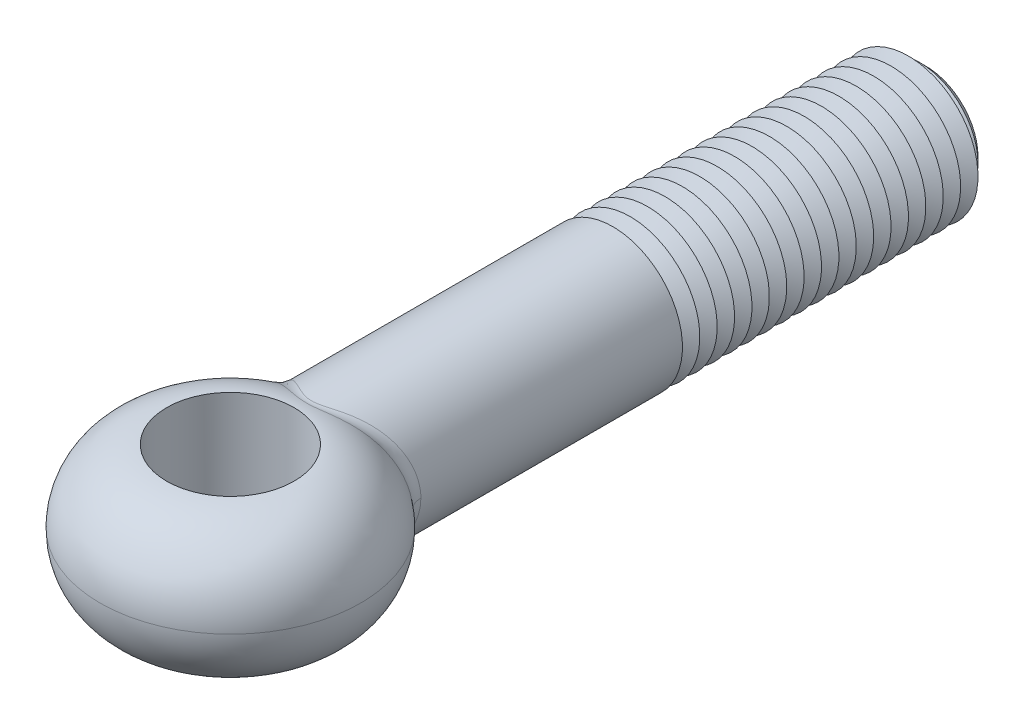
ISO-10303-21;
HEADER;
FILE_DESCRIPTION(('STEP AP214'),'2;1');
FILE_NAME('part.step','',(''),(''),'','','');
FILE_SCHEMA(('AUTOMOTIVE_DESIGN { 1 0 10303 214 1 1 1 1 }'));
ENDSEC;
DATA;
#1=APPLICATION_CONTEXT('core data for automotive mechanical design processes');
#2=APPLICATION_PROTOCOL_DEFINITION('international standard','automotive_design',2000,#1);
#3=PRODUCT_CONTEXT('',#1,'mechanical');
#4=PRODUCT('Part','Part','',(#3));
#5=PRODUCT_RELATED_PRODUCT_CATEGORY('part','',(#4));
#6=PRODUCT_DEFINITION_FORMATION('','',#4);
#7=PRODUCT_DEFINITION_CONTEXT('part definition',#1,'design');
#8=PRODUCT_DEFINITION('design','',#6,#7);
#9=PRODUCT_DEFINITION_SHAPE('','',#8);
#10=(LENGTH_UNIT() NAMED_UNIT(*) SI_UNIT(.MILLI.,.METRE.));
#11=(NAMED_UNIT(*) PLANE_ANGLE_UNIT() SI_UNIT($,.RADIAN.));
#12=(NAMED_UNIT(*) SI_UNIT($,.STERADIAN.) SOLID_ANGLE_UNIT());
#13=UNCERTAINTY_MEASURE_WITH_UNIT(LENGTH_MEASURE(1.E-05),#10,'distance_accuracy_value','');
#14=(GEOMETRIC_REPRESENTATION_CONTEXT(3) GLOBAL_UNCERTAINTY_ASSIGNED_CONTEXT((#13)) GLOBAL_UNIT_ASSIGNED_CONTEXT((#10,
#11,#12)) REPRESENTATION_CONTEXT('',''));
#15=CARTESIAN_POINT('',(0.,0.,0.));
#16=DIRECTION('',(0.,0.,1.));
#17=DIRECTION('',(1.,0.,0.));
#18=AXIS2_PLACEMENT_3D('',#15,#16,#17);
#19=CARTESIAN_POINT('',(0.,0.,-120.));
#20=DIRECTION('',(0.,0.,1.));
#21=DIRECTION('',(1.,0.,0.));
#22=AXIS2_PLACEMENT_3D('',#19,#20,#21);
#23=CYLINDRICAL_SURFACE('',#22,12.);
#24=CARTESIAN_POINT('',(0.,0.,-66.));
#25=DIRECTION('',(0.,0.,-1.));
#26=DIRECTION('',(-1.,0.,0.));
#27=AXIS2_PLACEMENT_3D('',#24,#25,#26);
#28=CIRCLE('',#27,12.);
#29=CARTESIAN_POINT('',(-12.,0.,-66.));
#30=VERTEX_POINT('',#29);
#31=EDGE_CURVE('E79',#30,#30,#28,.T.);
#32=ORIENTED_EDGE('',*,*,#31,.F.);
#33=EDGE_LOOP('',(#32));
#34=FACE_BOUND('',#33,.T.);
#35=CARTESIAN_POINT('',(11.0668506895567,-7.00530357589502,-17.0807480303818));
#36=CARTESIAN_POINT('',(10.0234990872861,-6.61021541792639,-18.0753053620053));
#37=CARTESIAN_POINT('',(9.78816741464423,-6.94202986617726,-19.5134777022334));
#38=CARTESIAN_POINT('',(11.2556958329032,-6.75368020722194,-17.1613260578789));
#39=CARTESIAN_POINT('',(10.1869276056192,-6.36184091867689,-18.1624978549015));
#40=CARTESIAN_POINT('',(9.96506204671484,-6.69267922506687,-19.6251962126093));
#41=CARTESIAN_POINT('',(11.4348613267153,-6.49403242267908,-17.2374483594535));
#42=CARTESIAN_POINT('',(10.3406855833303,-6.10798315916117,-18.2442158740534));
#43=CARTESIAN_POINT('',(10.1331767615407,-6.43537664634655,-19.7306806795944));
#44=CARTESIAN_POINT('',(11.7724527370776,-5.96016922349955,-17.3803783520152));
#45=CARTESIAN_POINT('',(10.6291362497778,-5.58941231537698,-18.3970469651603));
#46=CARTESIAN_POINT('',(10.4503638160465,-5.90633543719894,-19.9286565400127));
#47=CARTESIAN_POINT('',(11.9308725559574,-5.68594955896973,-17.447183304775));
#48=CARTESIAN_POINT('',(10.7636860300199,-5.32475984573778,-18.4680821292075));
#49=CARTESIAN_POINT('',(10.599430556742,-5.63459259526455,-20.0211441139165));
#50=CARTESIAN_POINT('',(12.225543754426,-5.12445153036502,-17.5710545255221));
#51=CARTESIAN_POINT('',(11.0129539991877,-4.78607036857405,-18.599336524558));
#52=CARTESIAN_POINT('',(10.8769937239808,-5.07816616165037,-20.1925721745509));
#53=CARTESIAN_POINT('',(12.3617854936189,-4.83716755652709,-17.6281165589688));
#54=CARTESIAN_POINT('',(11.1275308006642,-4.51212660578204,-18.659479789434));
#55=CARTESIAN_POINT('',(11.0054812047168,-4.79347701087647,-20.2715067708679));
#56=CARTESIAN_POINT('',(12.6107207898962,-4.25153049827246,-17.7321011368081));
#57=CARTESIAN_POINT('',(11.3361661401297,-3.95652222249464,-18.7687597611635));
#58=CARTESIAN_POINT('',(11.2404406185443,-4.21312957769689,-20.4153048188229));
#59=CARTESIAN_POINT('',(12.7234175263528,-3.9531789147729,-17.7790250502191));
#60=CARTESIAN_POINT('',(11.4301063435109,-3.67499018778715,-18.817833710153));
#61=CARTESIAN_POINT('',(11.346915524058,-3.9174727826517,-20.4801701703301));
#62=CARTESIAN_POINT('',(12.9208093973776,-3.35755003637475,-17.8610404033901));
#63=CARTESIAN_POINT('',(11.5941985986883,-3.1152907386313,-18.9034123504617));
#64=CARTESIAN_POINT('',(11.5335233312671,-3.32722377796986,-20.5935163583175));
#65=CARTESIAN_POINT('',(13.0063157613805,-3.06057125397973,-17.8964754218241));
#66=CARTESIAN_POINT('',(11.6649530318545,-2.83744567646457,-18.9402361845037));
#67=CARTESIAN_POINT('',(11.6144188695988,-3.03292738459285,-20.6424730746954));
#68=CARTESIAN_POINT('',(13.1535247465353,-2.46001547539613,-17.9573899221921));
#69=CARTESIAN_POINT('',(11.7865473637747,-2.27727686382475,-19.0034467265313));
#70=CARTESIAN_POINT('',(11.7537472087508,-2.43779598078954,-20.7266175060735));
#71=CARTESIAN_POINT('',(13.2152195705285,-2.15643635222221,-17.9828661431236));
#72=CARTESIAN_POINT('',(11.8373061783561,-1.99511197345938,-19.0297910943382));
#73=CARTESIAN_POINT('',(11.81217265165,-2.13695886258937,-20.7618007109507));
#74=CARTESIAN_POINT('',(13.3141154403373,-1.54515492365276,-18.0236671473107));
#75=CARTESIAN_POINT('',(11.9186021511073,-1.42805602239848,-19.0719556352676));
#76=CARTESIAN_POINT('',(11.9058504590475,-1.53119868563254,-20.8181418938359));
#77=CARTESIAN_POINT('',(13.351338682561,-1.237456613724,-18.0390011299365));
#78=CARTESIAN_POINT('',(11.9491061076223,-1.14334206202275,-19.0877585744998));
#79=CARTESIAN_POINT('',(11.9411238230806,-1.22627958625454,-20.8393125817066));
#80=CARTESIAN_POINT('',(13.4010119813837,-0.61983984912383,-18.0594576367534));
#81=CARTESIAN_POINT('',(11.989818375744,-0.572328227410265,-19.1088452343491));
#82=CARTESIAN_POINT('',(11.9881988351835,-0.614241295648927,-20.867554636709));
#83=CARTESIAN_POINT('',(13.4134617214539,-0.309921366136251,-18.0645800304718));
#84=CARTESIAN_POINT('',(12.0000000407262,-0.286212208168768,-19.1141151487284));
#85=CARTESIAN_POINT('',(12.0000001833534,-0.307122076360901,-20.8746258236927));
#86=CARTESIAN_POINT('',(13.4134613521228,0.315589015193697,-18.0645799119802));
#87=CARTESIAN_POINT('',(11.999999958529,0.291446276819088,-19.1141151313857));
#88=CARTESIAN_POINT('',(11.9999998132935,0.312738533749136,-20.8746256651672));
#89=CARTESIAN_POINT('',(13.4005517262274,0.63118101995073,-18.0592683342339));
#90=CARTESIAN_POINT('',(11.9894424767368,0.582796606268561,-19.1086507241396));
#91=CARTESIAN_POINT('',(11.9877625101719,0.625480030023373,-20.8672933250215));
#92=CARTESIAN_POINT('',(13.3490459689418,1.26003314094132,-18.0380566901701));
#93=CARTESIAN_POINT('',(11.9472266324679,1.16422234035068,-19.0867849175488));
#94=CARTESIAN_POINT('',(11.9389511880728,1.24865219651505,-20.8380086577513));
#95=CARTESIAN_POINT('',(13.3104489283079,1.57329317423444,-18.0221562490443));
#96=CARTESIAN_POINT('',(11.9155958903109,1.45410364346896,-19.0703978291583));
#97=CARTESIAN_POINT('',(11.902376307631,1.55908278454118,-20.8160558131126));
#98=CARTESIAN_POINT('',(13.2079559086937,2.19523221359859,-17.9798674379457));
#99=CARTESIAN_POINT('',(11.8313307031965,2.03114104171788,-19.0266903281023));
#100=CARTESIAN_POINT('',(11.8052934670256,2.17540431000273,-20.757659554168));
#101=CARTESIAN_POINT('',(13.1440553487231,2.50391037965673,-17.9534771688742));
#102=CARTESIAN_POINT('',(11.778747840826,2.31811265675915,-18.9993967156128));
#103=CARTESIAN_POINT('',(11.7447811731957,2.48129441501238,-20.7212135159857));
#104=CARTESIAN_POINT('',(12.9915746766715,3.11452894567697,-17.890369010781));
#105=CARTESIAN_POINT('',(11.6527601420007,2.88786980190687,-18.9338924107));
#106=CARTESIAN_POINT('',(11.6004711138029,3.08639771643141,-20.6340369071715));
#107=CARTESIAN_POINT('',(12.9029856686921,3.41646687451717,-17.8536473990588));
#108=CARTESIAN_POINT('',(11.5794275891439,3.17048606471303,-18.8957194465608));
#109=CARTESIAN_POINT('',(11.5166649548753,3.38560846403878,-20.5833011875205));
#110=CARTESIAN_POINT('',(12.7022190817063,4.01079458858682,-17.7702015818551));
#111=CARTESIAN_POINT('',(11.4124346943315,3.72932815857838,-18.8086044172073));
#112=CARTESIAN_POINT('',(11.3268856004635,3.97456805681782,-20.4679735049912));
#113=CARTESIAN_POINT('',(12.5900903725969,4.30320272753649,-17.7234980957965));
#114=CARTESIAN_POINT('',(11.3189167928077,4.00541898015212,-18.7597374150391));
#115=CARTESIAN_POINT('',(11.2209583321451,4.26433508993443,-20.4034102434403));
#116=CARTESIAN_POINT('',(12.3431556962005,4.87731134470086,-17.6203174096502));
#117=CARTESIAN_POINT('',(11.1118629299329,4.55038551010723,-18.6512584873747));
#118=CARTESIAN_POINT('',(10.9879091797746,4.83325821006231,-20.260718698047));
#119=CARTESIAN_POINT('',(12.2083417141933,5.15900799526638,-17.5638367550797));
#120=CARTESIAN_POINT('',(10.9984353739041,4.81913932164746,-18.5917040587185));
#121=CARTESIAN_POINT('',(10.8607798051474,5.11241050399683,-20.1825856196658));
#122=CARTESIAN_POINT('',(11.9173359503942,5.70976821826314,-17.4414779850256));
#123=CARTESIAN_POINT('',(10.7521869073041,5.34773597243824,-18.462013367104));
#124=CARTESIAN_POINT('',(10.5866916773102,5.65819611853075,-20.0132458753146));
#125=CARTESIAN_POINT('',(11.7611511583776,5.97883588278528,-17.375602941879));
#126=CARTESIAN_POINT('',(10.6194983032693,5.60749077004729,-18.391948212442));
#127=CARTESIAN_POINT('',(10.4397394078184,5.92483349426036,-19.9220434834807));
#128=CARTESIAN_POINT('',(11.4287046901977,6.5029302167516,-17.2348317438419));
#129=CARTESIAN_POINT('',(10.3353872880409,6.11671914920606,-18.2414005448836));
#130=CARTESIAN_POINT('',(10.1273983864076,6.44419407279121,-19.7270547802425));
#131=CARTESIAN_POINT('',(11.2524417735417,6.75795601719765,-17.1599350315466));
#132=CARTESIAN_POINT('',(10.1840940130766,6.36613220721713,-18.1609883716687));
#133=CARTESIAN_POINT('',(9.96200849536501,6.69691641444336,-19.6232676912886));
#134=CARTESIAN_POINT('',(10.8755162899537,7.26030557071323,-16.999110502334));
#135=CARTESIAN_POINT('',(9.85865758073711,6.86075287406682,-17.9873566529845));
#136=CARTESIAN_POINT('',(9.6089466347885,7.19472861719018,-19.4002901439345));
#137=CARTESIAN_POINT('',(10.6742674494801,7.50714674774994,-16.9129130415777));
#138=CARTESIAN_POINT('',(9.684069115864,7.10559423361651,-17.8938830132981));
#139=CARTESIAN_POINT('',(9.42074350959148,7.43934026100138,-19.2807224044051));
#140=CARTESIAN_POINT('',(10.2535888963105,7.98325367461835,-16.7319589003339));
#141=CARTESIAN_POINT('',(9.31692741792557,7.58129738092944,-17.6964993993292));
#142=CARTESIAN_POINT('',(9.0281736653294,7.91114686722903,-19.0295700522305));
#143=CARTESIAN_POINT('',(10.0341636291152,8.21252369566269,-16.637204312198));
#144=CARTESIAN_POINT('',(9.12451201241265,7.81216456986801,-17.5926673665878));
#145=CARTESIAN_POINT('',(8.82381089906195,8.13834606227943,-18.8979883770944));
#146=CARTESIAN_POINT('',(9.57850828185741,8.65276143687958,-16.4396502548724));
#147=CARTESIAN_POINT('',(8.72267859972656,8.25878016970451,-17.3749330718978));
#148=CARTESIAN_POINT('',(8.40050866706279,8.57460746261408,-18.623492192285));
#149=CARTESIAN_POINT('',(9.34226759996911,8.86371742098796,-16.3368457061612));
#150=CARTESIAN_POINT('',(8.51336852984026,8.4745533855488,-17.2610929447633));
#151=CARTESIAN_POINT('',(8.18156001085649,8.78365803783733,-18.4805705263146));
#152=CARTESIAN_POINT('',(8.85465264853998,9.26641239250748,-16.1239505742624));
#153=CARTESIAN_POINT('',(8.07909814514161,8.88955655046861,-17.0240228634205));
#154=CARTESIAN_POINT('',(7.73099517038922,9.18271576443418,-18.1844263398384));
#155=CARTESIAN_POINT('',(8.60328194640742,9.45815588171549,-16.013861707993));
#156=CARTESIAN_POINT('',(7.85424144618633,9.08885199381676,-16.9008538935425));
#157=CARTESIAN_POINT('',(7.49938197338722,9.37272737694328,-18.0312062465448));
#158=CARTESIAN_POINT('',(8.06370502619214,9.838189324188,-15.7770858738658));
#159=CARTESIAN_POINT('',(7.36948144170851,9.48676203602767,-16.6345956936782));
#160=CARTESIAN_POINT('',(7.00398623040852,9.74932825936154,-17.7014858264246));
#161=CARTESIAN_POINT('',(7.77421051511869,10.0246580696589,-15.6497932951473));
#162=CARTESIAN_POINT('',(7.10821519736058,9.68394461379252,-16.4906997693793));
#163=CARTESIAN_POINT('',(6.73917402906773,9.93411277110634,-17.5241266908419));
#164=CARTESIAN_POINT('',(7.18020960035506,10.3739440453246,-15.3887823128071));
#165=CARTESIAN_POINT('',(6.56993984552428,10.0563267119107,-16.1940603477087));
#166=CARTESIAN_POINT('',(6.1983598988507,10.2802439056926,-17.1602711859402));
#167=CARTESIAN_POINT('',(6.8757060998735,10.5367658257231,-15.2550651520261));
#168=CARTESIAN_POINT('',(6.29299233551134,10.2316662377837,-16.0413517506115));
#169=CARTESIAN_POINT('',(5.92236013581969,10.4415950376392,-16.9737765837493));
#170=CARTESIAN_POINT('',(6.25253303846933,10.8386647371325,-14.9829888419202));
#171=CARTESIAN_POINT('',(5.72450599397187,10.559425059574,-15.7291507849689));
#172=CARTESIAN_POINT('',(5.36070387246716,10.7407671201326,-16.5941767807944));
#173=CARTESIAN_POINT('',(5.93386874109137,10.9777505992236,-14.8446314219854));
#174=CARTESIAN_POINT('',(5.432987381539,10.7120059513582,-15.5696627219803));
#175=CARTESIAN_POINT('',(5.07505096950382,10.8785967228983,-16.4010740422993));
#176=CARTESIAN_POINT('',(5.28221556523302,11.2323272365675,-14.5658439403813));
#177=CARTESIAN_POINT('',(4.83577895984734,10.9935431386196,-15.2469866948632));
#178=CARTESIAN_POINT('',(4.49486022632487,11.1308739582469,-16.0119192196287));
#179=CARTESIAN_POINT('',(4.94923070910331,11.3478245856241,-14.4254144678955));
#180=CARTESIAN_POINT('',(4.53005970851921,11.1226685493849,-15.0837625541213));
#181=CARTESIAN_POINT('',(4.20032488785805,11.2453281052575,-15.8158679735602));
#182=CARTESIAN_POINT('',(4.418859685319,11.5092496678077,-14.2088988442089));
#183=CARTESIAN_POINT('',(4.04244425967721,11.3047506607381,-14.8310562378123));
#184=CARTESIAN_POINT('',(3.73498180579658,11.4052951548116,-15.5136345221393));
#185=CARTESIAN_POINT('',(4.22698520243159,11.5632823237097,-14.1319559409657));
#186=CARTESIAN_POINT('',(3.86615136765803,11.3659940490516,-14.7411592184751));
#187=CARTESIAN_POINT('',(3.56736640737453,11.4588397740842,-15.4062382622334));
#188=CARTESIAN_POINT('',(3.83770554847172,11.6641157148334,-13.9800981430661));
#189=CARTESIAN_POINT('',(3.50855117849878,11.4808212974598,-14.563464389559));
#190=CARTESIAN_POINT('',(3.22895536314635,11.5587624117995,-15.1943126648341));
#191=CARTESIAN_POINT('',(3.64030104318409,11.7109173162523,-13.9051830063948));
#192=CARTESIAN_POINT('',(3.32722277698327,11.5344340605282,-14.4756451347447));
#193=CARTESIAN_POINT('',(3.058160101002,11.6051412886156,-15.0897829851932));
#194=CARTESIAN_POINT('',(3.23881755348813,11.7973007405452,-13.7590320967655));
#195=CARTESIAN_POINT('',(2.9586556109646,11.6338410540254,-14.3041084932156));
#196=CARTESIAN_POINT('',(2.7126029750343,11.6907444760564,-14.8859114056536));
#197=CARTESIAN_POINT('',(3.034729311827,11.8368720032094,-13.6878018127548));
#198=CARTESIAN_POINT('',(2.7713784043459,11.6796514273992,-14.2203690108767));
#199=CARTESIAN_POINT('',(2.53783572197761,11.729958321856,-14.7865772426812));
#200=CARTESIAN_POINT('',(2.61924941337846,11.9085316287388,-13.5518208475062));
#201=CARTESIAN_POINT('',(2.39049286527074,11.7629647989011,-14.0603637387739));
#202=CARTESIAN_POINT('',(2.18396259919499,11.8009706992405,-14.5970091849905));
#203=CARTESIAN_POINT('',(2.40785949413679,11.9406217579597,-13.487068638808));
#204=CARTESIAN_POINT('',(2.19684547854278,11.8004961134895,-13.9840608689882));
#205=CARTESIAN_POINT('',(2.00485776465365,11.8327709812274,-14.5067731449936));
#206=CARTESIAN_POINT('',(1.88979300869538,12.0083312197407,-13.3438479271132));
#207=CARTESIAN_POINT('',(1.72298962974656,11.8799550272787,-13.8152500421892));
#208=CARTESIAN_POINT('',(1.56826217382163,11.8998688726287,-14.307262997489));
#209=CARTESIAN_POINT('',(1.57889083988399,12.0402078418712,-13.2702876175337));
#210=CARTESIAN_POINT('',(1.4388724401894,11.9177031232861,-13.728341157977));
#211=CARTESIAN_POINT('',(1.30813242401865,11.9314575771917,-14.2048593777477));
#212=CARTESIAN_POINT('',(1.1016812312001,12.0751548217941,-13.186477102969));
#213=CARTESIAN_POINT('',(1.00343635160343,11.9592039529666,-13.6293092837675));
#214=CARTESIAN_POINT('',(0.911154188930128,11.9660889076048,-14.08823090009));
#215=CARTESIAN_POINT('',(0.941325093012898,12.0846492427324,-13.1629946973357));
#216=CARTESIAN_POINT('',(0.857250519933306,11.9705082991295,-13.6015536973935));
#217=CARTESIAN_POINT('',(0.778128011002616,11.9754975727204,-14.0555630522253));
#218=CARTESIAN_POINT('',(0.617680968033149,12.0991842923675,-13.1266072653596));
#219=CARTESIAN_POINT('',(0.562389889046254,11.9878287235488,-13.5585487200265));
#220=CARTESIAN_POINT('',(0.510147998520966,11.9899013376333,-14.0049481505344));
#221=CARTESIAN_POINT('',(0.454393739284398,12.104226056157,-13.1136995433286));
#222=CARTESIAN_POINT('',(0.413680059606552,11.9938505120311,-13.5432855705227));
#223=CARTESIAN_POINT('',(0.375194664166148,11.994897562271,-13.986997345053));
#224=CARTESIAN_POINT('',(0.124773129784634,12.1097166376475,-13.0996281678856));
#225=CARTESIAN_POINT('',(0.113587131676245,12.0004071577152,-13.5266507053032));
#226=CARTESIAN_POINT('',(0.102974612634,12.0003385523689,-13.9674284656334));
#227=CARTESIAN_POINT('',(-0.0415739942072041,12.1101142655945,-13.0985954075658));
#228=CARTESIAN_POINT('',(-0.0378485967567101,12.0008826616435,-13.5254292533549));
#229=CARTESIAN_POINT('',(-0.0343012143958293,12.0007325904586,-13.9659924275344));
#230=CARTESIAN_POINT('',(-0.373368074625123,12.1061686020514,-13.1087272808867));
#231=CARTESIAN_POINT('',(-0.33990308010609,11.9961701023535,-13.5374072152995));
#232=CARTESIAN_POINT('',(-0.308257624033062,11.9968225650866,-13.9800824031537));
#233=CARTESIAN_POINT('',(-0.538814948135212,12.1018248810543,-13.1198930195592));
#234=CARTESIAN_POINT('',(-0.490563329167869,11.9909802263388,-13.5506112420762));
#235=CARTESIAN_POINT('',(-0.444938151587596,11.9925180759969,-13.9956099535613));
#236=CARTESIAN_POINT('',(-0.867965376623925,12.0885089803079,-13.153394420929));
#237=CARTESIAN_POINT('',(-0.790396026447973,11.9751052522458,-13.5902076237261));
#238=CARTESIAN_POINT('',(-0.717328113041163,11.979322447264,-14.0422082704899));
#239=CARTESIAN_POINT('',(-1.03165081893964,12.0795071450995,-13.1758016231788));
#240=CARTESIAN_POINT('',(-0.939590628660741,11.9643807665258,-13.6166946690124));
#241=CARTESIAN_POINT('',(-0.853025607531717,11.9704019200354,-14.0733785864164));
#242=CARTESIAN_POINT('',(-1.35507829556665,12.0571088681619,-13.2299063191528));
#243=CARTESIAN_POINT('',(-1.23455248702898,11.937774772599,-13.6806107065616));
#244=CARTESIAN_POINT('',(-1.12186617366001,11.9482059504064,-14.148663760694));
#245=CARTESIAN_POINT('',(-1.51481934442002,12.0437113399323,-13.2616061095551));
#246=CARTESIAN_POINT('',(-1.38035112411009,11.9218856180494,-13.7180567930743));
#247=CARTESIAN_POINT('',(-1.25500860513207,11.9349294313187,-14.1927818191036));
#248=CARTESIAN_POINT('',(-1.84495456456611,12.011300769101,-13.3355882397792));
#249=CARTESIAN_POINT('',(-1.68188899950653,11.8835783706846,-13.8053908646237));
#250=CARTESIAN_POINT('',(-1.53107532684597,11.9028116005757,-14.2957778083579));
#251=CARTESIAN_POINT('',(-2.01491382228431,11.9918743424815,-13.3785910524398));
#252=CARTESIAN_POINT('',(-1.83727107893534,11.8606743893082,-13.8561401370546));
#253=CARTESIAN_POINT('',(-1.67372311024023,11.8835606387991,-14.3556614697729));
#254=CARTESIAN_POINT('',(-2.34982544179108,11.9483049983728,-13.4708803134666));
#255=CARTESIAN_POINT('',(-2.14368396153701,11.8095216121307,-13.9649543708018));
#256=CARTESIAN_POINT('',(-1.95593412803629,11.8403848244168,-14.484221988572));
#257=CARTESIAN_POINT('',(-2.51477537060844,11.9241598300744,-13.520169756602));
#258=CARTESIAN_POINT('',(-2.29473884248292,11.7812588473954,-14.0230424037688));
#259=CARTESIAN_POINT('',(-2.09549585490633,11.8164577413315,-14.5529030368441));
#260=CARTESIAN_POINT('',(-2.84030915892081,11.8712884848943,-13.6232162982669));
#261=CARTESIAN_POINT('',(-2.59304039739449,11.7196429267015,-14.1443586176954));
#262=CARTESIAN_POINT('',(-2.37205348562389,11.7640639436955,-14.6965334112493));
#263=CARTESIAN_POINT('',(-3.00088551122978,11.8425549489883,-13.6769805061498));
#264=CARTESIAN_POINT('',(-2.74030070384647,11.6862694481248,-14.2076122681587));
#265=CARTESIAN_POINT('',(-2.50904486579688,11.7355899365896,-14.7714927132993));
#266=CARTESIAN_POINT('',(-3.31787265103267,11.7806424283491,-13.7874770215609));
#267=CARTESIAN_POINT('',(-3.03113701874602,11.6146813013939,-14.3374619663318));
#268=CARTESIAN_POINT('',(-2.7805695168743,11.6742366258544,-14.9255877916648));
#269=CARTESIAN_POINT('',(-3.47428412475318,11.7474641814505,-13.8442088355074));
#270=CARTESIAN_POINT('',(-3.17472979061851,11.5764547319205,-14.404072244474));
#271=CARTESIAN_POINT('',(-2.91510319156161,11.6413580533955,-15.0047228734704));
#272=CARTESIAN_POINT('',(-3.78404739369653,11.67656761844,-13.9598300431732));
#273=CARTESIAN_POINT('',(-3.45918061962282,11.4951374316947,-14.5396537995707));
#274=CARTESIAN_POINT('',(-3.18257716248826,11.5711018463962,-15.1660331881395));
#275=CARTESIAN_POINT('',(-3.93738431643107,11.6388315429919,-14.0187272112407));
#276=CARTESIAN_POINT('',(-3.60003721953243,11.4520148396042,-14.6086453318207));
#277=CARTESIAN_POINT('',(-3.31550885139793,11.5337066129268,-15.2482193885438));
#278=CARTESIAN_POINT('',(-4.24071273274,11.5589459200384,-14.1376822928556));
#279=CARTESIAN_POINT('',(-3.87868653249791,11.3611356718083,-14.7477942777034));
#280=CARTESIAN_POINT('',(-3.57944589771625,11.4545425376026,-15.4142328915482));
#281=CARTESIAN_POINT('',(-4.39070396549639,11.5167960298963,-14.1977402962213));
#282=CARTESIAN_POINT('',(-4.01648905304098,11.3133653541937,-14.8179616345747));
#283=CARTESIAN_POINT('',(-3.7104511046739,11.4127733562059,-15.4980603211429));
#284=CARTESIAN_POINT('',(-4.8357946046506,11.3838162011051,-14.3786158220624));
#285=CARTESIAN_POINT('',(-4.4257108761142,11.1631818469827,-15.0291599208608));
#286=CARTESIAN_POINT('',(-4.10054896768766,11.2809946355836,-15.750538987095));
#287=CARTESIAN_POINT('',(-5.12633926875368,11.2863806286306,-14.500260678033));
#288=CARTESIAN_POINT('',(-4.69251664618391,11.0540121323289,-15.170680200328));
#289=CARTESIAN_POINT('',(-4.35700776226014,11.1844391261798,-15.9203621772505));
#290=CARTESIAN_POINT('',(-5.71340475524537,11.0674990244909,-14.7497300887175));
#291=CARTESIAN_POINT('',(-5.23094469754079,10.811014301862,-15.4599151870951));
#292=CARTESIAN_POINT('',(-4.87826833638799,10.9675345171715,-16.2686079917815));
#293=CARTESIAN_POINT('',(-6.00925252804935,10.9449693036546,-14.8774916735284));
#294=CARTESIAN_POINT('',(-5.50187190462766,10.6760136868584,-15.6074949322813));
#295=CARTESIAN_POINT('',(-5.14265857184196,10.8461115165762,-16.446941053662));
#296=CARTESIAN_POINT('',(-6.58901820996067,10.6799255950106,-15.1296175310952));
#297=CARTESIAN_POINT('',(-6.0315628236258,10.3867756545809,-15.8975382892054));
#298=CARTESIAN_POINT('',(-5.66351510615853,10.5834617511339,-16.7987693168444));
#299=CARTESIAN_POINT('',(-6.87293369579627,10.5374075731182,-15.2539811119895));
#300=CARTESIAN_POINT('',(-6.29032294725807,10.2324127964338,-16.0400075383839));
#301=CARTESIAN_POINT('',(-5.91997979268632,10.4422309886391,-16.9722635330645));
#302=CARTESIAN_POINT('',(-7.42781601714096,10.2327138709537,-15.4975137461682));
#303=CARTESIAN_POINT('',(-6.79447470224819,9.90543645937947,-16.3177763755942));
#304=CARTESIAN_POINT('',(-6.42343369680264,10.1402893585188,-17.3118682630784));
#305=CARTESIAN_POINT('',(-7.69880705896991,10.0705771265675,-15.6166924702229));
#306=CARTESIAN_POINT('',(-7.03986086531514,9.7327471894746,-16.4530735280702));
#307=CARTESIAN_POINT('',(-6.67044044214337,9.97961707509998,-17.4779925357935));
#308=CARTESIAN_POINT('',(-8.22752602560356,9.72661338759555,-15.8490032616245));
#309=CARTESIAN_POINT('',(-7.516849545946,9.3696549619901,-16.7156042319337));
#310=CARTESIAN_POINT('',(-7.15414912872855,9.63876010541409,-17.8016554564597));
#311=CARTESIAN_POINT('',(-8.48525397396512,9.54478642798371,-15.9621353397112));
#312=CARTESIAN_POINT('',(-7.74838988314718,9.17915766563,-16.8428011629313));
#313=CARTESIAN_POINT('',(-7.39085108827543,9.45857545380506,-17.9591941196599));
#314=CARTESIAN_POINT('',(-9.04166371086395,9.11943479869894,-16.2057439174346));
#315=CARTESIAN_POINT('',(-8.24643700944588,8.73712339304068,-17.1155654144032));
#316=CARTESIAN_POINT('',(-7.90344846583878,9.03706571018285,-18.2982438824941));
#317=CARTESIAN_POINT('',(-9.33680953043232,8.87115530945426,-16.3345284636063));
#318=CARTESIAN_POINT('',(-8.5088809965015,8.48157779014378,-17.2587098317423));
#319=CARTESIAN_POINT('',(-8.17644570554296,8.79102874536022,-18.4773591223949));
#320=CARTESIAN_POINT('',(-9.90300273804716,8.34681842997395,-16.5805049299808));
#321=CARTESIAN_POINT('',(-9.00956487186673,7.94739974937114,-17.5305747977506));
#322=CARTESIAN_POINT('',(-8.7017229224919,8.27142781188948,-18.8192409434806));
#323=CARTESIAN_POINT('',(-10.1740457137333,8.07075597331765,-16.6976947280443));
#324=CARTESIAN_POINT('',(-9.24759259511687,7.66868796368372,-17.6591721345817));
#325=CARTESIAN_POINT('',(-8.95399910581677,7.99785882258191,-18.9820045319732));
#326=CARTESIAN_POINT('',(-10.6893747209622,7.49227394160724,-16.9194545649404));
#327=CARTESIAN_POINT('',(-9.69758548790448,7.09025247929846,-17.9011953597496));
#328=CARTESIAN_POINT('',(-9.43479391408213,7.4246017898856,-19.2898096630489));
#329=CARTESIAN_POINT('',(-10.9336387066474,7.18983301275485,-17.0240142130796));
#330=CARTESIAN_POINT('',(-9.90928717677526,6.79050605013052,-18.0144718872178));
#331=CARTESIAN_POINT('',(-9.66329295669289,7.1248925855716,-19.434836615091));
#332=CARTESIAN_POINT('',(-11.3922237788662,6.56101137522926,-17.219416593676));
#333=CARTESIAN_POINT('',(-10.3045410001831,6.17279493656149,-18.2250928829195));
#334=CARTESIAN_POINT('',(-10.0930881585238,6.50175062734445,-19.705708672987));
#335=CARTESIAN_POINT('',(-11.6065510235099,6.23463561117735,-17.31026214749));
#336=CARTESIAN_POINT('',(-10.4878412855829,5.85490191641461,-18.3222983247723));
#337=CARTESIAN_POINT('',(-10.2943899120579,6.1783227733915,-19.8315577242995));
#338=CARTESIAN_POINT('',(-11.9788069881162,5.60102165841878,-17.4673989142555));
#339=CARTESIAN_POINT('',(-10.8045077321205,5.24277677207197,-18.4896383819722));
#340=CARTESIAN_POINT('',(-10.6445307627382,5.55043178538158,-20.0491319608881));
#341=CARTESIAN_POINT('',(-12.1404155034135,5.29616663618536,-17.535327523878));
#342=CARTESIAN_POINT('',(-10.9411166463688,4.95021714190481,-18.5615610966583));
#343=CARTESIAN_POINT('',(-10.7967651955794,5.24833029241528,-20.1431384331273));
#344=CARTESIAN_POINT('',(-12.4365532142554,4.67222519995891,-17.6594117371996));
#345=CARTESIAN_POINT('',(-11.1904485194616,4.35503313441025,-18.6924913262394));
#346=CARTESIAN_POINT('',(-11.0760057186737,4.63002445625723,-20.3147946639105));
#347=CARTESIAN_POINT('',(-12.5710856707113,4.3531405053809,-17.7155687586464));
#348=CARTESIAN_POINT('',(-11.3030104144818,4.05255416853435,-18.7514129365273));
#349=CARTESIAN_POINT('',(-11.2030148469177,4.31382181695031,-20.3924463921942));
#350=CARTESIAN_POINT('',(-12.8113072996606,3.70386059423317,-17.8155899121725));
#351=CARTESIAN_POINT('',(-11.5033629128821,3.44010607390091,-18.8560787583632));
#352=CARTESIAN_POINT('',(-11.4299721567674,3.67040636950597,-20.5307108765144));
#353=CARTESIAN_POINT('',(-12.9170534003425,3.37368877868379,-17.8594783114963));
#354=CARTESIAN_POINT('',(-11.5910600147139,3.13033564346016,-18.9017738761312));
#355=CARTESIAN_POINT('',(-11.5299737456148,3.34321675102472,-20.591357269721));
#356=CARTESIAN_POINT('',(-13.0987625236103,2.7045032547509,-17.9347558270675));
#357=CARTESIAN_POINT('',(-11.7414276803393,2.50483422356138,-18.9800127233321));
#358=CARTESIAN_POINT('',(-11.7018998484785,2.68007548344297,-20.6953560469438));
#359=CARTESIAN_POINT('',(-13.1747386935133,2.36549352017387,-17.966150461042));
#360=CARTESIAN_POINT('',(-11.8039950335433,2.18932374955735,-19.0125025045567));
#361=CARTESIAN_POINT('',(-11.7738367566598,2.34412777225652,-20.7387160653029));
#362=CARTESIAN_POINT('',(-13.2945218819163,1.69001403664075,-18.0155922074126));
#363=CARTESIAN_POINT('',(-11.9025350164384,1.56217664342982,-19.0636291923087));
#364=CARTESIAN_POINT('',(-11.8872853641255,1.67474939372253,-20.8069927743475));
#365=CARTESIAN_POINT('',(-13.3390876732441,1.35369370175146,-18.0339542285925));
#366=CARTESIAN_POINT('',(-11.9390623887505,1.25085799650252,-19.0825551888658));
#367=CARTESIAN_POINT('',(-11.9295146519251,1.34146679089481,-20.8323446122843));
#368=CARTESIAN_POINT('',(-13.3985522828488,0.678243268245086,-18.0584460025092));
#369=CARTESIAN_POINT('',(-11.9878097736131,0.62623517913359,-19.1078059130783));
#370=CARTESIAN_POINT('',(-11.9858669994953,0.672117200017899,-20.8661581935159));
#371=CARTESIAN_POINT('',(-13.4134605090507,0.339114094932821,-18.0645796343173));
#372=CARTESIAN_POINT('',(-11.9999997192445,0.313171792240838,-19.1141150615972));
#373=CARTESIAN_POINT('',(-11.99999897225,0.336051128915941,-20.8746252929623));
#374=CARTESIAN_POINT('',(-13.4134624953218,-0.315214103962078,-18.0645802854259));
#375=CARTESIAN_POINT('',(-12.0000002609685,-0.291100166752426,-19.1141152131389));
#376=CARTESIAN_POINT('',(-12.0000009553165,-0.312367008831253,-20.8746261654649));
#377=CARTESIAN_POINT('',(-13.4005834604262,-0.630415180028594,-18.0592813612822));
#378=CARTESIAN_POINT('',(-11.989468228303,-0.582089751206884,-19.1086640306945));
#379=CARTESIAN_POINT('',(-11.987792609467,-0.624721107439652,-20.8673113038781));
#380=CARTESIAN_POINT('',(-13.3491942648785,-1.25859966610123,-18.0381178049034));
#381=CARTESIAN_POINT('',(-11.9473483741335,-1.16289640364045,-19.0868480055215));
#382=CARTESIAN_POINT('',(-11.9390917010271,-1.24723166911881,-20.8380930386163));
#383=CARTESIAN_POINT('',(-13.3106752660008,-1.57158227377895,-18.0222495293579));
#384=CARTESIAN_POINT('',(-11.9157815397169,-1.45251959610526,-19.070494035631));
#385=CARTESIAN_POINT('',(-11.9025907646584,-1.55738733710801,-20.8161846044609));
#386=CARTESIAN_POINT('',(-13.2082732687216,-2.19364255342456,-17.9799984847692));
#387=CARTESIAN_POINT('',(-11.8315919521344,-2.02966309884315,-19.0268259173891));
#388=CARTESIAN_POINT('',(-11.8055940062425,-2.17382900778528,-20.7578405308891));
#389=CARTESIAN_POINT('',(-13.1443316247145,-2.50270947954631,-17.953591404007));
#390=CARTESIAN_POINT('',(-11.7789758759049,-2.31699330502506,-18.9995151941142));
#391=CARTESIAN_POINT('',(-11.7450427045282,-2.48010436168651,-20.7213713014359));
#392=CARTESIAN_POINT('',(-12.9917331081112,-3.11398878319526,-17.8904346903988));
#393=CARTESIAN_POINT('',(-11.6528914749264,-2.88736356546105,-18.9339607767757));
#394=CARTESIAN_POINT('',(-11.6006209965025,-3.08586243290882,-20.6341276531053));
#395=CARTESIAN_POINT('',(-12.9030756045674,-3.41620098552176,-17.8536847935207));
#396=CARTESIAN_POINT('',(-11.57950265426,-3.17023510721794,-18.895758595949));
#397=CARTESIAN_POINT('',(-11.5167499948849,-3.38534497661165,-20.5833528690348));
#398=CARTESIAN_POINT('',(-12.7021040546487,-4.01113475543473,-17.77015375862));
#399=CARTESIAN_POINT('',(-11.4123391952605,-3.72964749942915,-18.8085546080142));
#400=CARTESIAN_POINT('',(-11.3267768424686,-3.97490515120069,-20.4679074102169));
#401=CARTESIAN_POINT('',(-12.5898329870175,-4.30387246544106,-17.7233908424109));
#402=CARTESIAN_POINT('',(-11.3187022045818,-4.00605158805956,-18.7596253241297));
#403=CARTESIAN_POINT('',(-11.2207150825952,-4.26499877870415,-20.4032619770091));
#404=CARTESIAN_POINT('',(-12.3425923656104,-4.87854946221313,-17.6200817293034));
#405=CARTESIAN_POINT('',(-11.1113901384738,-4.55156205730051,-18.6510104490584));
#406=CARTESIAN_POINT('',(-10.9873778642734,-4.83448514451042,-20.2603927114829));
#407=CARTESIAN_POINT('',(-12.2076200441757,-5.16048742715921,-17.5635343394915));
#408=CARTESIAN_POINT('',(-10.9978285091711,-4.82054774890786,-18.5913850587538));
#409=CARTESIAN_POINT('',(-10.8600998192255,-5.11387657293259,-20.1821672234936));
#410=CARTESIAN_POINT('',(-11.9165165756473,-5.71120494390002,-17.4411324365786));
#411=CARTESIAN_POINT('',(-10.7514900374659,-5.34912610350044,-18.4616457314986));
#412=CARTESIAN_POINT('',(-10.5859202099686,-5.65961986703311,-20.0127675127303));
#413=CARTESIAN_POINT('',(-11.7604304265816,-5.98001086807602,-17.3752977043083));
#414=CARTESIAN_POINT('',(-10.6188806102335,-5.60864484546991,-18.3916220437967));
#415=CARTESIAN_POINT('',(-10.4390603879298,-5.92599786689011,-19.9216208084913));
#416=CARTESIAN_POINT('',(-11.4282849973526,-6.50355289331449,-17.2346540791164));
#417=CARTESIAN_POINT('',(-10.335029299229,-6.1173138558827,-18.2412097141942));
#418=CARTESIAN_POINT('',(-10.1270059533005,-6.44481112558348,-19.7268085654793));
#419=CARTESIAN_POINT('',(-11.2522312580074,-6.75829286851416,-17.1598476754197));
#420=CARTESIAN_POINT('',(-10.1839224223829,-6.36640726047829,-18.1608946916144));
#421=CARTESIAN_POINT('',(-9.96181642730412,-6.6972502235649,-19.6231464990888));
#422=CARTESIAN_POINT('',(-11.0668506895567,-7.00530357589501,-17.0807480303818));
#423=CARTESIAN_POINT('',(-10.0234990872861,-6.61021541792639,-18.0753053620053));
#424=CARTESIAN_POINT('',(-9.78816741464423,-6.94202986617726,-19.5134777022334));
#425=(BOUNDED_SURFACE() B_SPLINE_SURFACE(3,2,((#35,#36,#37),(#38,#39,#40),(#41,#42,#43),(#44,
#45,#46),(#47,#48,#49),(#50,#51,#52),(#53,#54,#55),(#56,#57,#58),(#59,#60,#61),(#62,#63,#64),
(#65,#66,#67),(#68,#69,#70),(#71,#72,#73),(#74,#75,#76),(#77,#78,#79),(#80,#81,#82),(#83,#84,
#85),(#86,#87,#88),(#89,#90,#91),(#92,#93,#94),(#95,#96,#97),(#98,#99,#100),(#101,#102,#103),
(#104,#105,#106),(#107,#108,#109),(#110,#111,#112),(#113,#114,#115),(#116,#117,#118),(#119,#120,
#121),(#122,#123,#124),(#125,#126,#127),(#128,#129,#130),(#131,#132,#133),(#134,#135,#136),
(#137,#138,#139),(#140,#141,#142),(#143,#144,#145),(#146,#147,#148),(#149,#150,#151),(#152,#153,
#154),(#155,#156,#157),(#158,#159,#160),(#161,#162,#163),(#164,#165,#166),(#167,#168,#169),
(#170,#171,#172),(#173,#174,#175),(#176,#177,#178),(#179,#180,#181),(#182,#183,#184),(#185,#186,
#187),(#188,#189,#190),(#191,#192,#193),(#194,#195,#196),(#197,#198,#199),(#200,#201,#202),
(#203,#204,#205),(#206,#207,#208),(#209,#210,#211),(#212,#213,#214),(#215,#216,#217),(#218,#219,
#220),(#221,#222,#223),(#224,#225,#226),(#227,#228,#229),(#230,#231,#232),(#233,#234,#235),
(#236,#237,#238),(#239,#240,#241),(#242,#243,#244),(#245,#246,#247),(#248,#249,#250),(#251,#252,
#253),(#254,#255,#256),(#257,#258,#259),(#260,#261,#262),(#263,#264,#265),(#266,#267,#268),
(#269,#270,#271),(#272,#273,#274),(#275,#276,#277),(#278,#279,#280),(#281,#282,#283),(#284,#285,
#286),(#287,#288,#289),(#290,#291,#292),(#293,#294,#295),(#296,#297,#298),(#299,#300,#301),
(#302,#303,#304),(#305,#306,#307),(#308,#309,#310),(#311,#312,#313),(#314,#315,#316),(#317,#318,
#319),(#320,#321,#322),(#323,#324,#325),(#326,#327,#328),(#329,#330,#331),(#332,#333,#334),
(#335,#336,#337),(#338,#339,#340),(#341,#342,#343),(#344,#345,#346),(#347,#348,#349),(#350,#351,
#352),(#353,#354,#355),(#356,#357,#358),(#359,#360,#361),(#362,#363,#364),(#365,#366,#367),
(#368,#369,#370),(#371,#372,#373),(#374,#375,#376),(#377,#378,#379),(#380,#381,#382),(#383,#384,
#385),(#386,#387,#388),(#389,#390,#391),(#392,#393,#394),(#395,#396,#397),(#398,#399,#400),
(#401,#402,#403),(#404,#405,#406),(#407,#408,#409),(#410,#411,#412),(#413,#414,#415),(#416,#417,
#418),(#419,#420,#421),(#422,#423,#424)),.UNSPECIFIED.,.F.,.F.,
.F.) B_SPLINE_SURFACE_WITH_KNOTS((4,2,2,2,2,2,2,2,2,2,2,2,2,2,2,2,2,2,2,2,2,2,2,2,2,2,2,2,2,2,2,
2,2,2,2,2,2,2,2,2,2,2,2,2,2,2,2,2,2,2,2,2,2,2,2,2,2,2,2,2,2,2,2,2,4),(3,3),(0.,1.23092497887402,
2.4622109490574,3.6940307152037,4.92568403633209,6.11609806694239,7.30690157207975,
8.49662348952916,9.68636060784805,10.8978548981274,12.1093920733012,13.3211486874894,
14.5333424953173,15.7430441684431,16.9531741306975,18.1629092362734,19.3727191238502,
20.6199678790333,21.8669124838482,23.1146503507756,24.3620951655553,25.7203979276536,
27.0784389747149,28.4359793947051,29.793140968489,30.5470943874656,31.3009574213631,
32.0559128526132,32.810689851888,33.8680575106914,34.3934346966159,34.9186779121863,
35.4497052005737,35.9807805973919,36.5152794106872,37.0499104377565,37.635474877,
38.2213193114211,38.8081129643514,39.3948093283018,39.9838703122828,40.5729770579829,
41.7499391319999,42.9969316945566,44.2441762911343,45.488984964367,46.7337914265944,
48.2536843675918,49.7738549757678,51.295267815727,52.8163672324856,54.1554531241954,
55.4943776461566,56.8306347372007,58.1663010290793,59.4684801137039,60.7702460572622,
61.9802664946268,63.1907042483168,64.4039506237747,65.6172279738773,66.8283158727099,
68.0395515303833,69.2482453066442,70.4566044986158),(0.,1.),
.UNSPECIFIED.) GEOMETRIC_REPRESENTATION_ITEM() RATIONAL_B_SPLINE_SURFACE(((1.,0.919658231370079,
1.),(1.,0.917640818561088,1.),(1.,0.915701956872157,1.),(1.,0.912011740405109,1.),(1.,
0.910260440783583,1.),(1.,0.906976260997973,1.),(1.,0.905443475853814,1.),(1.,0.902624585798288,
1.),(1.,0.901338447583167,1.),(1.,0.899074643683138,1.),(1.,0.898088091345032,1.),(1.,
0.896383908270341,1.),(1.,0.895666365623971,1.),(1.,0.894513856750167,1.),(1.,0.89407863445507,
1.),(1.,0.893497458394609,1.),(1.,0.893351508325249,1.),(1.,0.893351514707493,1.),(1.,
0.893502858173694,1.),(1.,0.894105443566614,1.),(1.,0.894556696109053,1.),(1.,0.895750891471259,
1.),(1.,0.896493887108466,1.),(1.,0.898258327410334,1.),(1.,0.899279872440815,1.),(1.,
0.901580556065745,1.),(1.,0.902859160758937,1.),(1.,0.905653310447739,1.),(1.,0.907168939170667,
1.),(1.,0.91041024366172,1.),(1.,0.912135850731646,1.),(1.,0.915768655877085,1.),(1.,
0.917675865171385,1.),(1.,0.921701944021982,1.),(1.,0.923825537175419,1.),(1.,0.9281956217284,
1.),(1.,0.930442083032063,1.),(1.,0.935022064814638,1.),(1.,0.937355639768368,1.),(1.,
0.942068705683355,1.),(1.,0.944448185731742,1.),(1.,0.94942511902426,1.),(1.,0.952023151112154,
1.),(1.,0.957171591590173,1.),(1.,0.959722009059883,1.),(1.,0.964717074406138,1.),(1.,
0.967161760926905,1.),(1.,0.971882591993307,1.),(1.,0.974158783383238,1.),(1.,0.977509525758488,
1.),(1.,0.97866850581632,1.),(1.,0.980895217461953,1.),(1.,0.981962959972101,1.),(1.,
0.983989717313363,1.),(1.,0.984948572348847,1.),(1.,0.986730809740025,1.),(1.,0.987554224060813,
1.),(1.,0.989331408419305,1.),(1.,0.990205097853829,1.),(1.,0.991180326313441,1.),(1.,
0.99144919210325,1.),(1.,0.991863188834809,1.),(1.,0.992008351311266,1.),(1.,0.992166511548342,
1.),(1.,0.992178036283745,1.),(1.,0.992064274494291,1.),(1.,0.991938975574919,1.),(1.,
0.991558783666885,1.),(1.,0.991303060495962,1.),(1.,0.990675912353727,1.),(1.,0.990304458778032,
1.),(1.,0.989421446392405,1.),(1.,0.988899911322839,1.),(1.,0.987755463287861,1.),(1.,
0.987132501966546,1.),(1.,0.985799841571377,1.),(1.,0.985090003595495,1.),(1.,0.983597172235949,
1.),(1.,0.982814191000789,1.),(1.,0.981182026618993,1.),(1.,0.980332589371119,1.),(1.,
0.978578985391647,1.),(1.,0.977674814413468,1.),(1.,0.97489355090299,1.),(1.,0.972945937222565,
1.),(1.,0.968793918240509,1.),(1.,0.966581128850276,1.),(1.,0.962052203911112,1.),(1.,
0.95973604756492,1.),(1.,0.955051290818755,1.),(1.,0.952682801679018,1.),(1.,0.947931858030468,
1.),(1.,0.945549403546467,1.),(1.,0.940287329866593,1.),(1.,0.937414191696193,1.),(1.,
0.931779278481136,1.),(1.,0.929017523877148,1.),(1.,0.923672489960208,1.),(1.,0.921089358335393,
1.),(1.,0.916170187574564,1.),(1.,0.91383409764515,1.),(1.,0.909730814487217,1.),(1.,
0.907928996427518,1.),(1.,0.904601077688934,1.),(1.,0.903074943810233,1.),(1.,0.900333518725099,
1.),(1.,0.899117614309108,1.),(1.,0.897019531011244,1.),(1.,0.896137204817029,1.),(1.,
0.894742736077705,1.),(1.,0.894221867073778,1.),(1.,0.89352631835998,1.),(1.,0.893351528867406,
1.),(1.,0.893351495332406,1.),(1.,0.893502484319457,1.),(1.,0.894103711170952,1.),(1.,
0.894554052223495,1.),(1.,0.895747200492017,1.),(1.,0.896490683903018,1.),(1.,0.898256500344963,
1.),(1.,0.899278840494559,1.),(1.,0.901581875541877,1.),(1.,0.902862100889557,1.),(1.,
0.905659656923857,1.),(1.,0.907177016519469,1.),(1.,0.910419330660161,1.),(1.,0.912143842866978,
1.),(1.,0.915773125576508,1.),(1.,0.91767784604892,1.),(1.,0.919658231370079,1.))) REPRESENTATION_ITEM('') SURFACE());
#426=CARTESIAN_POINT('',(-9.78816741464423,-6.94202986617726,-19.5134777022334));
#427=CARTESIAN_POINT('',(-9.96181642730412,-6.6972502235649,-19.6231464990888));
#428=CARTESIAN_POINT('',(-10.1270059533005,-6.44481112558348,-19.7268085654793));
#429=CARTESIAN_POINT('',(-10.4390603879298,-5.92599786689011,-19.9216208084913));
#430=CARTESIAN_POINT('',(-10.5859202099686,-5.6596198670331,-20.0127675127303));
#431=CARTESIAN_POINT('',(-10.8600998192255,-5.11387657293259,-20.1821672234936));
#432=CARTESIAN_POINT('',(-10.9873778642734,-4.83448514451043,-20.2603927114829));
#433=CARTESIAN_POINT('',(-11.2207150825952,-4.26499877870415,-20.4032619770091));
#434=CARTESIAN_POINT('',(-11.3267768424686,-3.97490515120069,-20.4679074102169));
#435=CARTESIAN_POINT('',(-11.5167499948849,-3.38534497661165,-20.5833528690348));
#436=CARTESIAN_POINT('',(-11.6006209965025,-3.08586243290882,-20.6341276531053));
#437=CARTESIAN_POINT('',(-11.7450427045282,-2.48010436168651,-20.7213713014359));
#438=CARTESIAN_POINT('',(-11.8055940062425,-2.17382900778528,-20.7578405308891));
#439=CARTESIAN_POINT('',(-11.9025907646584,-1.55738733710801,-20.8161846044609));
#440=CARTESIAN_POINT('',(-11.9390917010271,-1.24723166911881,-20.8380930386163));
#441=CARTESIAN_POINT('',(-11.987792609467,-0.624721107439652,-20.8673113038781));
#442=CARTESIAN_POINT('',(-12.0000009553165,-0.312367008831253,-20.8746261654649));
#443=CARTESIAN_POINT('',(-11.99999897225,0.336051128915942,-20.8746252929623));
#444=CARTESIAN_POINT('',(-11.9858669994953,0.672117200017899,-20.8661581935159));
#445=CARTESIAN_POINT('',(-11.9295146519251,1.34146679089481,-20.8323446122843));
#446=CARTESIAN_POINT('',(-11.8872853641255,1.67474939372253,-20.8069927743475));
#447=CARTESIAN_POINT('',(-11.7738367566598,2.34412777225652,-20.7387160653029));
#448=CARTESIAN_POINT('',(-11.7018998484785,2.68007548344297,-20.6953560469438));
#449=CARTESIAN_POINT('',(-11.5299737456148,3.34321675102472,-20.591357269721));
#450=CARTESIAN_POINT('',(-11.4299721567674,3.67040636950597,-20.5307108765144));
#451=CARTESIAN_POINT('',(-11.2030148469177,4.31382181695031,-20.3924463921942));
#452=CARTESIAN_POINT('',(-11.0760057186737,4.63002445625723,-20.3147946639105));
#453=CARTESIAN_POINT('',(-10.7967651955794,5.24833029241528,-20.1431384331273));
#454=CARTESIAN_POINT('',(-10.6445307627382,5.55043178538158,-20.0491319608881));
#455=CARTESIAN_POINT('',(-10.2943899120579,6.1783227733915,-19.8315577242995));
#456=CARTESIAN_POINT('',(-10.0930881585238,6.50175062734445,-19.705708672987));
#457=CARTESIAN_POINT('',(-9.66329295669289,7.1248925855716,-19.434836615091));
#458=CARTESIAN_POINT('',(-9.43479391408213,7.4246017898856,-19.2898096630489));
#459=CARTESIAN_POINT('',(-8.95399910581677,7.99785882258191,-18.9820045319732));
#460=CARTESIAN_POINT('',(-8.7017229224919,8.27142781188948,-18.8192409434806));
#461=CARTESIAN_POINT('',(-8.17644570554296,8.79102874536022,-18.4773591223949));
#462=CARTESIAN_POINT('',(-7.90344846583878,9.03706571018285,-18.2982438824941));
#463=CARTESIAN_POINT('',(-7.39085108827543,9.45857545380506,-17.9591941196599));
#464=CARTESIAN_POINT('',(-7.15414912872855,9.63876010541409,-17.8016554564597));
#465=CARTESIAN_POINT('',(-6.67044044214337,9.97961707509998,-17.4779925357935));
#466=CARTESIAN_POINT('',(-6.42343369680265,10.1402893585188,-17.3118682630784));
#467=CARTESIAN_POINT('',(-5.91997979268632,10.4422309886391,-16.9722635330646));
#468=CARTESIAN_POINT('',(-5.66351510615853,10.5834617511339,-16.7987693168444));
#469=CARTESIAN_POINT('',(-5.14265857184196,10.8461115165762,-16.446941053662));
#470=CARTESIAN_POINT('',(-4.87826833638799,10.9675345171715,-16.2686079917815));
#471=CARTESIAN_POINT('',(-4.35700776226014,11.1844391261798,-15.9203621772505));
#472=CARTESIAN_POINT('',(-4.10054896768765,11.2809946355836,-15.750538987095));
#473=CARTESIAN_POINT('',(-3.7104511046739,11.4127733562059,-15.4980603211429));
#474=CARTESIAN_POINT('',(-3.57944589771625,11.4545425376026,-15.4142328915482));
#475=CARTESIAN_POINT('',(-3.31550885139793,11.5337066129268,-15.2482193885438));
#476=CARTESIAN_POINT('',(-3.18257716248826,11.5711018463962,-15.1660331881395));
#477=CARTESIAN_POINT('',(-2.91510319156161,11.6413580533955,-15.0047228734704));
#478=CARTESIAN_POINT('',(-2.7805695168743,11.6742366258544,-14.9255877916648));
#479=CARTESIAN_POINT('',(-2.50904486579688,11.7355899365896,-14.7714927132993));
#480=CARTESIAN_POINT('',(-2.37205348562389,11.7640639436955,-14.6965334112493));
#481=CARTESIAN_POINT('',(-2.09549585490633,11.8164577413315,-14.5529030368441));
#482=CARTESIAN_POINT('',(-1.95593412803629,11.8403848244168,-14.484221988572));
#483=CARTESIAN_POINT('',(-1.67372311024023,11.8835606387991,-14.3556614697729));
#484=CARTESIAN_POINT('',(-1.53107532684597,11.9028116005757,-14.2957778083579));
#485=CARTESIAN_POINT('',(-1.25500860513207,11.9349294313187,-14.1927818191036));
#486=CARTESIAN_POINT('',(-1.12186617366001,11.9482059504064,-14.148663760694));
#487=CARTESIAN_POINT('',(-0.853025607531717,11.9704019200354,-14.0733785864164));
#488=CARTESIAN_POINT('',(-0.717328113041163,11.979322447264,-14.0422082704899));
#489=CARTESIAN_POINT('',(-0.444938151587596,11.9925180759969,-13.9956099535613));
#490=CARTESIAN_POINT('',(-0.308257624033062,11.9968225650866,-13.9800824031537));
#491=CARTESIAN_POINT('',(-0.0343012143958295,12.0007325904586,-13.9659924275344));
#492=CARTESIAN_POINT('',(0.102974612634,12.0003385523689,-13.9674284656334));
#493=CARTESIAN_POINT('',(0.375194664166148,11.994897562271,-13.986997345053));
#494=CARTESIAN_POINT('',(0.510147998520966,11.9899013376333,-14.0049481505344));
#495=CARTESIAN_POINT('',(0.778128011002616,11.9754975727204,-14.0555630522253));
#496=CARTESIAN_POINT('',(0.911154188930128,11.9660889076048,-14.08823090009));
#497=CARTESIAN_POINT('',(1.30813242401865,11.9314575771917,-14.2048593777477));
#498=CARTESIAN_POINT('',(1.56826217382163,11.8998688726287,-14.307262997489));
#499=CARTESIAN_POINT('',(2.00485776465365,11.8327709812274,-14.5067731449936));
#500=CARTESIAN_POINT('',(2.18396259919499,11.8009706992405,-14.5970091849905));
#501=CARTESIAN_POINT('',(2.53783572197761,11.729958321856,-14.7865772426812));
#502=CARTESIAN_POINT('',(2.7126029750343,11.6907444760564,-14.8859114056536));
#503=CARTESIAN_POINT('',(3.058160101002,11.6051412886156,-15.0897829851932));
#504=CARTESIAN_POINT('',(3.22895536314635,11.5587624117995,-15.1943126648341));
#505=CARTESIAN_POINT('',(3.56736640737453,11.4588397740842,-15.4062382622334));
#506=CARTESIAN_POINT('',(3.73498180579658,11.4052951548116,-15.5136345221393));
#507=CARTESIAN_POINT('',(4.20032488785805,11.2453281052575,-15.8158679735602));
#508=CARTESIAN_POINT('',(4.49486022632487,11.1308739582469,-16.0119192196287));
#509=CARTESIAN_POINT('',(5.07505096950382,10.8785967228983,-16.4010740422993));
#510=CARTESIAN_POINT('',(5.36070387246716,10.7407671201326,-16.5941767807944));
#511=CARTESIAN_POINT('',(5.92236013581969,10.4415950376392,-16.9737765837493));
#512=CARTESIAN_POINT('',(6.1983598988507,10.2802439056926,-17.1602711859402));
#513=CARTESIAN_POINT('',(6.73917402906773,9.93411277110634,-17.5241266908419));
#514=CARTESIAN_POINT('',(7.00398623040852,9.74932825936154,-17.7014858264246));
#515=CARTESIAN_POINT('',(7.49938197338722,9.37272737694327,-18.0312062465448));
#516=CARTESIAN_POINT('',(7.73099517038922,9.18271576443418,-18.1844263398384));
#517=CARTESIAN_POINT('',(8.18156001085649,8.78365803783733,-18.4805705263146));
#518=CARTESIAN_POINT('',(8.40050866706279,8.57460746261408,-18.623492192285));
#519=CARTESIAN_POINT('',(8.82381089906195,8.13834606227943,-18.8979883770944));
#520=CARTESIAN_POINT('',(9.0281736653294,7.91114686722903,-19.0295700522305));
#521=CARTESIAN_POINT('',(9.42074350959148,7.43934026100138,-19.2807224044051));
#522=CARTESIAN_POINT('',(9.6089466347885,7.19472861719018,-19.4002901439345));
#523=CARTESIAN_POINT('',(9.96200849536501,6.69691641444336,-19.6232676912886));
#524=CARTESIAN_POINT('',(10.1273983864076,6.44419407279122,-19.7270547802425));
#525=CARTESIAN_POINT('',(10.4397394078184,5.92483349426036,-19.9220434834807));
#526=CARTESIAN_POINT('',(10.5866916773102,5.65819611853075,-20.0132458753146));
#527=CARTESIAN_POINT('',(10.8607798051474,5.11241050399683,-20.1825856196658));
#528=CARTESIAN_POINT('',(10.9879091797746,4.83325821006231,-20.260718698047));
#529=CARTESIAN_POINT('',(11.2209583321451,4.26433508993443,-20.4034102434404));
#530=CARTESIAN_POINT('',(11.3268856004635,3.97456805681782,-20.4679735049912));
#531=CARTESIAN_POINT('',(11.5166649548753,3.38560846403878,-20.5833011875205));
#532=CARTESIAN_POINT('',(11.6004711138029,3.08639771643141,-20.6340369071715));
#533=CARTESIAN_POINT('',(11.7447811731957,2.48129441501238,-20.7212135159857));
#534=CARTESIAN_POINT('',(11.8052934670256,2.17540431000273,-20.757659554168));
#535=CARTESIAN_POINT('',(11.902376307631,1.55908278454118,-20.8160558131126));
#536=CARTESIAN_POINT('',(11.9389511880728,1.24865219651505,-20.8380086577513));
#537=CARTESIAN_POINT('',(11.9877625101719,0.625480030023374,-20.8672933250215));
#538=CARTESIAN_POINT('',(11.9999998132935,0.312738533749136,-20.8746256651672));
#539=CARTESIAN_POINT('',(12.0000001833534,-0.307122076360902,-20.8746258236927));
#540=CARTESIAN_POINT('',(11.9881988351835,-0.614241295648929,-20.867554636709));
#541=CARTESIAN_POINT('',(11.9411238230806,-1.22627958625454,-20.8393125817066));
#542=CARTESIAN_POINT('',(11.9058504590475,-1.53119868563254,-20.8181418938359));
#543=CARTESIAN_POINT('',(11.81217265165,-2.13695886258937,-20.7618007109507));
#544=CARTESIAN_POINT('',(11.7537472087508,-2.43779598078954,-20.7266175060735));
#545=CARTESIAN_POINT('',(11.6144188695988,-3.03292738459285,-20.6424730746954));
#546=CARTESIAN_POINT('',(11.5335233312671,-3.32722377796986,-20.5935163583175));
#547=CARTESIAN_POINT('',(11.346915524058,-3.91747278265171,-20.4801701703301));
#548=CARTESIAN_POINT('',(11.2404406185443,-4.21312957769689,-20.4153048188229));
#549=CARTESIAN_POINT('',(11.0054812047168,-4.79347701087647,-20.2715067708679));
#550=CARTESIAN_POINT('',(10.8769937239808,-5.07816616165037,-20.1925721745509));
#551=CARTESIAN_POINT('',(10.599430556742,-5.63459259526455,-20.0211441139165));
#552=CARTESIAN_POINT('',(10.4503638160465,-5.90633543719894,-19.9286565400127));
#553=CARTESIAN_POINT('',(10.1331767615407,-6.43537664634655,-19.7306806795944));
#554=CARTESIAN_POINT('',(9.96506204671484,-6.69267922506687,-19.6251962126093));
#555=CARTESIAN_POINT('',(9.78816741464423,-6.94202986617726,-19.5134777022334));
#556=B_SPLINE_CURVE_WITH_KNOTS('',3,(#426,#427,#428,#429,#430,#431,#432,#433,#434,#435,#436,
#437,#438,#439,#440,#441,#442,#443,#444,#445,#446,#447,#448,#449,#450,#451,#452,#453,#454,#455,
#456,#457,#458,#459,#460,#461,#462,#463,#464,#465,#466,#467,#468,#469,#470,#471,#472,#473,#474,
#475,#476,#477,#478,#479,#480,#481,#482,#483,#484,#485,#486,#487,#488,#489,#490,#491,#492,#493,
#494,#495,#496,#497,#498,#499,#500,#501,#502,#503,#504,#505,#506,#507,#508,#509,#510,#511,#512,
#513,#514,#515,#516,#517,#518,#519,#520,#521,#522,#523,#524,#525,#526,#527,#528,#529,#530,#531,
#532,#533,#534,#535,#536,#537,#538,#539,#540,#541,#542,#543,#544,#545,#546,#547,#548,#549,#550,
#551,#552,#553,#554,#555),.UNSPECIFIED.,.F.,.F.,(4,2,2,2,2,2,2,2,2,2,2,2,2,2,2,2,2,2,2,2,2,2,2,
2,2,2,2,2,2,2,2,2,2,2,2,2,2,2,2,2,2,2,2,2,2,2,2,2,2,2,2,2,2,2,2,2,2,2,2,2,2,2,2,2,4),(0.,
1.20835919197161,2.41705296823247,3.62828862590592,4.83937652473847,6.05265387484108,
7.265900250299,8.47633800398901,9.68635844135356,10.9881243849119,12.2903034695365,
13.6259697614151,14.9622268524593,16.3011513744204,17.6402372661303,19.1613366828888,
20.682749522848,22.202920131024,23.7228130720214,24.9676195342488,26.2124282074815,
27.4596728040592,28.7066653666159,29.8836274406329,30.472734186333,31.061795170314,
31.6484915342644,32.2352851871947,32.8211296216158,33.4066940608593,33.9413250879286,
34.4758239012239,35.0068992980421,35.5379265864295,36.0631698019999,36.5885469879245,
37.6459146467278,38.4006916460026,39.1556470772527,39.9095101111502,40.6634635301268,
42.0206251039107,43.3781655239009,44.7362065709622,46.0945093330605,47.3419541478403,
48.5896920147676,49.8366366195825,51.0838853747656,52.2936952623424,53.5034303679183,
54.7135603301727,55.9232620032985,57.1354558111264,58.3472124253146,59.5587496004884,
60.7702438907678,61.9599810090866,63.1497029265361,64.3405064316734,65.5309204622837,
66.7625737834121,67.9943935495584,69.2256795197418,70.4566044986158),.UNSPECIFIED.);
#557=CARTESIAN_POINT('',(-12.,0.,-20.8746257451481));
#558=VERTEX_POINT('',#557);
#559=CARTESIAN_POINT('',(12.,0.,-20.8746257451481));
#560=VERTEX_POINT('',#559);
#561=EDGE_CURVE('E81',#558,#560,#556,.T.);
#562=ORIENTED_EDGE('',*,*,#561,.T.);
#563=CARTESIAN_POINT('',(-11.0668506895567,7.00530357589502,-17.0807480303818));
#564=CARTESIAN_POINT('',(-10.0234990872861,6.61021541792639,-18.0753053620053));
#565=CARTESIAN_POINT('',(-9.78816741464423,6.94202986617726,-19.5134777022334));
#566=CARTESIAN_POINT('',(-11.2556958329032,6.75368020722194,-17.1613260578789));
#567=CARTESIAN_POINT('',(-10.1869276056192,6.36184091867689,-18.1624978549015));
#568=CARTESIAN_POINT('',(-9.96506204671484,6.69267922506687,-19.6251962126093));
#569=CARTESIAN_POINT('',(-11.4348613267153,6.49403242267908,-17.2374483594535));
#570=CARTESIAN_POINT('',(-10.3406855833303,6.10798315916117,-18.2442158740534));
#571=CARTESIAN_POINT('',(-10.1331767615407,6.43537664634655,-19.7306806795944));
#572=CARTESIAN_POINT('',(-11.7724527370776,5.96016922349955,-17.3803783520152));
#573=CARTESIAN_POINT('',(-10.6291362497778,5.58941231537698,-18.3970469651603));
#574=CARTESIAN_POINT('',(-10.4503638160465,5.90633543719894,-19.9286565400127));
#575=CARTESIAN_POINT('',(-11.9308725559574,5.68594955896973,-17.447183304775));
#576=CARTESIAN_POINT('',(-10.7636860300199,5.32475984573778,-18.4680821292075));
#577=CARTESIAN_POINT('',(-10.599430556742,5.63459259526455,-20.0211441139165));
#578=CARTESIAN_POINT('',(-12.225543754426,5.12445153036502,-17.5710545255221));
#579=CARTESIAN_POINT('',(-11.0129539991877,4.78607036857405,-18.599336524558));
#580=CARTESIAN_POINT('',(-10.8769937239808,5.07816616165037,-20.1925721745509));
#581=CARTESIAN_POINT('',(-12.3617854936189,4.83716755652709,-17.6281165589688));
#582=CARTESIAN_POINT('',(-11.1275308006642,4.51212660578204,-18.659479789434));
#583=CARTESIAN_POINT('',(-11.0054812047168,4.79347701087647,-20.2715067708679));
#584=CARTESIAN_POINT('',(-12.6107207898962,4.25153049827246,-17.7321011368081));
#585=CARTESIAN_POINT('',(-11.3361661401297,3.95652222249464,-18.7687597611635));
#586=CARTESIAN_POINT('',(-11.2404406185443,4.21312957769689,-20.4153048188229));
#587=CARTESIAN_POINT('',(-12.7234175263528,3.9531789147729,-17.7790250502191));
#588=CARTESIAN_POINT('',(-11.4301063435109,3.67499018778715,-18.817833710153));
#589=CARTESIAN_POINT('',(-11.346915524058,3.9174727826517,-20.4801701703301));
#590=CARTESIAN_POINT('',(-12.9208093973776,3.35755003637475,-17.8610404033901));
#591=CARTESIAN_POINT('',(-11.5941985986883,3.1152907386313,-18.9034123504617));
#592=CARTESIAN_POINT('',(-11.5335233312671,3.32722377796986,-20.5935163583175));
#593=CARTESIAN_POINT('',(-13.0063157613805,3.06057125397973,-17.8964754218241));
#594=CARTESIAN_POINT('',(-11.6649530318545,2.83744567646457,-18.9402361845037));
#595=CARTESIAN_POINT('',(-11.6144188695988,3.03292738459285,-20.6424730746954));
#596=CARTESIAN_POINT('',(-13.1535247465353,2.46001547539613,-17.9573899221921));
#597=CARTESIAN_POINT('',(-11.7865473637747,2.27727686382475,-19.0034467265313));
#598=CARTESIAN_POINT('',(-11.7537472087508,2.43779598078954,-20.7266175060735));
#599=CARTESIAN_POINT('',(-13.2152195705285,2.15643635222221,-17.9828661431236));
#600=CARTESIAN_POINT('',(-11.8373061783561,1.99511197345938,-19.0297910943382));
#601=CARTESIAN_POINT('',(-11.81217265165,2.13695886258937,-20.7618007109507));
#602=CARTESIAN_POINT('',(-13.3141154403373,1.54515492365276,-18.0236671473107));
#603=CARTESIAN_POINT('',(-11.9186021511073,1.42805602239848,-19.0719556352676));
#604=CARTESIAN_POINT('',(-11.9058504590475,1.53119868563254,-20.8181418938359));
#605=CARTESIAN_POINT('',(-13.351338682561,1.237456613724,-18.0390011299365));
#606=CARTESIAN_POINT('',(-11.9491061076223,1.14334206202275,-19.0877585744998));
#607=CARTESIAN_POINT('',(-11.9411238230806,1.22627958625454,-20.8393125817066));
#608=CARTESIAN_POINT('',(-13.4010119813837,0.61983984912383,-18.0594576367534));
#609=CARTESIAN_POINT('',(-11.989818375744,0.572328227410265,-19.1088452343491));
#610=CARTESIAN_POINT('',(-11.9881988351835,0.614241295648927,-20.867554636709));
#611=CARTESIAN_POINT('',(-13.4134617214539,0.309921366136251,-18.0645800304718));
#612=CARTESIAN_POINT('',(-12.0000000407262,0.286212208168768,-19.1141151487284));
#613=CARTESIAN_POINT('',(-12.0000001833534,0.307122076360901,-20.8746258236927));
#614=CARTESIAN_POINT('',(-13.4134613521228,-0.315589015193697,-18.0645799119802));
#615=CARTESIAN_POINT('',(-11.999999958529,-0.291446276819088,-19.1141151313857));
#616=CARTESIAN_POINT('',(-11.9999998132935,-0.312738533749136,-20.8746256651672));
#617=CARTESIAN_POINT('',(-13.4005517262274,-0.63118101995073,-18.0592683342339));
#618=CARTESIAN_POINT('',(-11.9894424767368,-0.582796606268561,-19.1086507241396));
#619=CARTESIAN_POINT('',(-11.9877625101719,-0.625480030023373,-20.8672933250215));
#620=CARTESIAN_POINT('',(-13.3490459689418,-1.26003314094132,-18.0380566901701));
#621=CARTESIAN_POINT('',(-11.9472266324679,-1.16422234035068,-19.0867849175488));
#622=CARTESIAN_POINT('',(-11.9389511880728,-1.24865219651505,-20.8380086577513));
#623=CARTESIAN_POINT('',(-13.3104489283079,-1.57329317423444,-18.0221562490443));
#624=CARTESIAN_POINT('',(-11.9155958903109,-1.45410364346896,-19.0703978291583));
#625=CARTESIAN_POINT('',(-11.902376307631,-1.55908278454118,-20.8160558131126));
#626=CARTESIAN_POINT('',(-13.2079559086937,-2.19523221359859,-17.9798674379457));
#627=CARTESIAN_POINT('',(-11.8313307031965,-2.03114104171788,-19.0266903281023));
#628=CARTESIAN_POINT('',(-11.8052934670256,-2.17540431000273,-20.757659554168));
#629=CARTESIAN_POINT('',(-13.1440553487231,-2.50391037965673,-17.9534771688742));
#630=CARTESIAN_POINT('',(-11.778747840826,-2.31811265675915,-18.9993967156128));
#631=CARTESIAN_POINT('',(-11.7447811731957,-2.48129441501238,-20.7212135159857));
#632=CARTESIAN_POINT('',(-12.9915746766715,-3.11452894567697,-17.890369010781));
#633=CARTESIAN_POINT('',(-11.6527601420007,-2.88786980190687,-18.9338924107));
#634=CARTESIAN_POINT('',(-11.6004711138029,-3.08639771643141,-20.6340369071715));
#635=CARTESIAN_POINT('',(-12.9029856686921,-3.41646687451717,-17.8536473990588));
#636=CARTESIAN_POINT('',(-11.5794275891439,-3.17048606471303,-18.8957194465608));
#637=CARTESIAN_POINT('',(-11.5166649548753,-3.38560846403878,-20.5833011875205));
#638=CARTESIAN_POINT('',(-12.7022190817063,-4.01079458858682,-17.7702015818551));
#639=CARTESIAN_POINT('',(-11.4124346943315,-3.72932815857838,-18.8086044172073));
#640=CARTESIAN_POINT('',(-11.3268856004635,-3.97456805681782,-20.4679735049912));
#641=CARTESIAN_POINT('',(-12.5900903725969,-4.30320272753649,-17.7234980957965));
#642=CARTESIAN_POINT('',(-11.3189167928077,-4.00541898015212,-18.7597374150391));
#643=CARTESIAN_POINT('',(-11.2209583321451,-4.26433508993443,-20.4034102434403));
#644=CARTESIAN_POINT('',(-12.3431556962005,-4.87731134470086,-17.6203174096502));
#645=CARTESIAN_POINT('',(-11.1118629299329,-4.55038551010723,-18.6512584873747));
#646=CARTESIAN_POINT('',(-10.9879091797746,-4.83325821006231,-20.260718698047));
#647=CARTESIAN_POINT('',(-12.2083417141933,-5.15900799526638,-17.5638367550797));
#648=CARTESIAN_POINT('',(-10.9984353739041,-4.81913932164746,-18.5917040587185));
#649=CARTESIAN_POINT('',(-10.8607798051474,-5.11241050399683,-20.1825856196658));
#650=CARTESIAN_POINT('',(-11.9173359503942,-5.70976821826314,-17.4414779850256));
#651=CARTESIAN_POINT('',(-10.7521869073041,-5.34773597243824,-18.462013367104));
#652=CARTESIAN_POINT('',(-10.5866916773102,-5.65819611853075,-20.0132458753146));
#653=CARTESIAN_POINT('',(-11.7611511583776,-5.97883588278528,-17.375602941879));
#654=CARTESIAN_POINT('',(-10.6194983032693,-5.60749077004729,-18.391948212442));
#655=CARTESIAN_POINT('',(-10.4397394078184,-5.92483349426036,-19.9220434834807));
#656=CARTESIAN_POINT('',(-11.4287046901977,-6.5029302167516,-17.2348317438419));
#657=CARTESIAN_POINT('',(-10.3353872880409,-6.11671914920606,-18.2414005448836));
#658=CARTESIAN_POINT('',(-10.1273983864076,-6.44419407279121,-19.7270547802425));
#659=CARTESIAN_POINT('',(-11.2524417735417,-6.75795601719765,-17.1599350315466));
#660=CARTESIAN_POINT('',(-10.1840940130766,-6.36613220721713,-18.1609883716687));
#661=CARTESIAN_POINT('',(-9.96200849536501,-6.69691641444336,-19.6232676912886));
#662=CARTESIAN_POINT('',(-10.8755162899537,-7.26030557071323,-16.999110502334));
#663=CARTESIAN_POINT('',(-9.85865758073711,-6.86075287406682,-17.9873566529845));
#664=CARTESIAN_POINT('',(-9.6089466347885,-7.19472861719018,-19.4002901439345));
#665=CARTESIAN_POINT('',(-10.6742674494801,-7.50714674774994,-16.9129130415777));
#666=CARTESIAN_POINT('',(-9.684069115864,-7.10559423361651,-17.8938830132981));
#667=CARTESIAN_POINT('',(-9.42074350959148,-7.43934026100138,-19.2807224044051));
#668=CARTESIAN_POINT('',(-10.2535888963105,-7.98325367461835,-16.7319589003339));
#669=CARTESIAN_POINT('',(-9.31692741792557,-7.58129738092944,-17.6964993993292));
#670=CARTESIAN_POINT('',(-9.0281736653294,-7.91114686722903,-19.0295700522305));
#671=CARTESIAN_POINT('',(-10.0341636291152,-8.21252369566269,-16.637204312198));
#672=CARTESIAN_POINT('',(-9.12451201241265,-7.81216456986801,-17.5926673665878));
#673=CARTESIAN_POINT('',(-8.82381089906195,-8.13834606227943,-18.8979883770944));
#674=CARTESIAN_POINT('',(-9.57850828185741,-8.65276143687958,-16.4396502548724));
#675=CARTESIAN_POINT('',(-8.72267859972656,-8.25878016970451,-17.3749330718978));
#676=CARTESIAN_POINT('',(-8.40050866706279,-8.57460746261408,-18.623492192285));
#677=CARTESIAN_POINT('',(-9.34226759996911,-8.86371742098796,-16.3368457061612));
#678=CARTESIAN_POINT('',(-8.51336852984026,-8.4745533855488,-17.2610929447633));
#679=CARTESIAN_POINT('',(-8.18156001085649,-8.78365803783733,-18.4805705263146));
#680=CARTESIAN_POINT('',(-8.85465264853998,-9.26641239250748,-16.1239505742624));
#681=CARTESIAN_POINT('',(-8.07909814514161,-8.88955655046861,-17.0240228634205));
#682=CARTESIAN_POINT('',(-7.73099517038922,-9.18271576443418,-18.1844263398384));
#683=CARTESIAN_POINT('',(-8.60328194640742,-9.45815588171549,-16.013861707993));
#684=CARTESIAN_POINT('',(-7.85424144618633,-9.08885199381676,-16.9008538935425));
#685=CARTESIAN_POINT('',(-7.49938197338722,-9.37272737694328,-18.0312062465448));
#686=CARTESIAN_POINT('',(-8.06370502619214,-9.838189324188,-15.7770858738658));
#687=CARTESIAN_POINT('',(-7.36948144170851,-9.48676203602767,-16.6345956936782));
#688=CARTESIAN_POINT('',(-7.00398623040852,-9.74932825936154,-17.7014858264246));
#689=CARTESIAN_POINT('',(-7.77421051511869,-10.0246580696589,-15.6497932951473));
#690=CARTESIAN_POINT('',(-7.10821519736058,-9.68394461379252,-16.4906997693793));
#691=CARTESIAN_POINT('',(-6.73917402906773,-9.93411277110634,-17.5241266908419));
#692=CARTESIAN_POINT('',(-7.18020960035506,-10.3739440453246,-15.3887823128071));
#693=CARTESIAN_POINT('',(-6.56993984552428,-10.0563267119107,-16.1940603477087));
#694=CARTESIAN_POINT('',(-6.1983598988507,-10.2802439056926,-17.1602711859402));
#695=CARTESIAN_POINT('',(-6.8757060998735,-10.5367658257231,-15.2550651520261));
#696=CARTESIAN_POINT('',(-6.29299233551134,-10.2316662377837,-16.0413517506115));
#697=CARTESIAN_POINT('',(-5.92236013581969,-10.4415950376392,-16.9737765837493));
#698=CARTESIAN_POINT('',(-6.25253303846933,-10.8386647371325,-14.9829888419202));
#699=CARTESIAN_POINT('',(-5.72450599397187,-10.559425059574,-15.7291507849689));
#700=CARTESIAN_POINT('',(-5.36070387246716,-10.7407671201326,-16.5941767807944));
#701=CARTESIAN_POINT('',(-5.93386874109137,-10.9777505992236,-14.8446314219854));
#702=CARTESIAN_POINT('',(-5.432987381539,-10.7120059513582,-15.5696627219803));
#703=CARTESIAN_POINT('',(-5.07505096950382,-10.8785967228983,-16.4010740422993));
#704=CARTESIAN_POINT('',(-5.28221556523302,-11.2323272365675,-14.5658439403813));
#705=CARTESIAN_POINT('',(-4.83577895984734,-10.9935431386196,-15.2469866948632));
#706=CARTESIAN_POINT('',(-4.49486022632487,-11.1308739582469,-16.0119192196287));
#707=CARTESIAN_POINT('',(-4.94923070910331,-11.3478245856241,-14.4254144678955));
#708=CARTESIAN_POINT('',(-4.53005970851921,-11.1226685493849,-15.0837625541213));
#709=CARTESIAN_POINT('',(-4.20032488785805,-11.2453281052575,-15.8158679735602));
#710=CARTESIAN_POINT('',(-4.418859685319,-11.5092496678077,-14.2088988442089));
#711=CARTESIAN_POINT('',(-4.04244425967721,-11.3047506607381,-14.8310562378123));
#712=CARTESIAN_POINT('',(-3.73498180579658,-11.4052951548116,-15.5136345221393));
#713=CARTESIAN_POINT('',(-4.22698520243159,-11.5632823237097,-14.1319559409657));
#714=CARTESIAN_POINT('',(-3.86615136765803,-11.3659940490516,-14.7411592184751));
#715=CARTESIAN_POINT('',(-3.56736640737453,-11.4588397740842,-15.4062382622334));
#716=CARTESIAN_POINT('',(-3.83770554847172,-11.6641157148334,-13.9800981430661));
#717=CARTESIAN_POINT('',(-3.50855117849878,-11.4808212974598,-14.563464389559));
#718=CARTESIAN_POINT('',(-3.22895536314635,-11.5587624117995,-15.1943126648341));
#719=CARTESIAN_POINT('',(-3.64030104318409,-11.7109173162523,-13.9051830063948));
#720=CARTESIAN_POINT('',(-3.32722277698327,-11.5344340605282,-14.4756451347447));
#721=CARTESIAN_POINT('',(-3.058160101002,-11.6051412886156,-15.0897829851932));
#722=CARTESIAN_POINT('',(-3.23881755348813,-11.7973007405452,-13.7590320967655));
#723=CARTESIAN_POINT('',(-2.9586556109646,-11.6338410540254,-14.3041084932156));
#724=CARTESIAN_POINT('',(-2.7126029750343,-11.6907444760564,-14.8859114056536));
#725=CARTESIAN_POINT('',(-3.034729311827,-11.8368720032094,-13.6878018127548));
#726=CARTESIAN_POINT('',(-2.7713784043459,-11.6796514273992,-14.2203690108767));
#727=CARTESIAN_POINT('',(-2.53783572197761,-11.729958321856,-14.7865772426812));
#728=CARTESIAN_POINT('',(-2.61924941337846,-11.9085316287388,-13.5518208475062));
#729=CARTESIAN_POINT('',(-2.39049286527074,-11.7629647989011,-14.0603637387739));
#730=CARTESIAN_POINT('',(-2.18396259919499,-11.8009706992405,-14.5970091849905));
#731=CARTESIAN_POINT('',(-2.40785949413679,-11.9406217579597,-13.487068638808));
#732=CARTESIAN_POINT('',(-2.19684547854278,-11.8004961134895,-13.9840608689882));
#733=CARTESIAN_POINT('',(-2.00485776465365,-11.8327709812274,-14.5067731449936));
#734=CARTESIAN_POINT('',(-1.88979300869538,-12.0083312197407,-13.3438479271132));
#735=CARTESIAN_POINT('',(-1.72298962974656,-11.8799550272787,-13.8152500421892));
#736=CARTESIAN_POINT('',(-1.56826217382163,-11.8998688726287,-14.307262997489));
#737=CARTESIAN_POINT('',(-1.57889083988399,-12.0402078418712,-13.2702876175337));
#738=CARTESIAN_POINT('',(-1.4388724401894,-11.9177031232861,-13.728341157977));
#739=CARTESIAN_POINT('',(-1.30813242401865,-11.9314575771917,-14.2048593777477));
#740=CARTESIAN_POINT('',(-1.1016812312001,-12.0751548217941,-13.186477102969));
#741=CARTESIAN_POINT('',(-1.00343635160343,-11.9592039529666,-13.6293092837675));
#742=CARTESIAN_POINT('',(-0.911154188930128,-11.9660889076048,-14.08823090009));
#743=CARTESIAN_POINT('',(-0.941325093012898,-12.0846492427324,-13.1629946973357));
#744=CARTESIAN_POINT('',(-0.857250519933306,-11.9705082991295,-13.6015536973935));
#745=CARTESIAN_POINT('',(-0.778128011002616,-11.9754975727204,-14.0555630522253));
#746=CARTESIAN_POINT('',(-0.617680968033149,-12.0991842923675,-13.1266072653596));
#747=CARTESIAN_POINT('',(-0.562389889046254,-11.9878287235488,-13.5585487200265));
#748=CARTESIAN_POINT('',(-0.510147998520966,-11.9899013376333,-14.0049481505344));
#749=CARTESIAN_POINT('',(-0.454393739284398,-12.104226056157,-13.1136995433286));
#750=CARTESIAN_POINT('',(-0.413680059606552,-11.9938505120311,-13.5432855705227));
#751=CARTESIAN_POINT('',(-0.375194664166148,-11.994897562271,-13.986997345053));
#752=CARTESIAN_POINT('',(-0.124773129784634,-12.1097166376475,-13.0996281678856));
#753=CARTESIAN_POINT('',(-0.113587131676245,-12.0004071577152,-13.5266507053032));
#754=CARTESIAN_POINT('',(-0.102974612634,-12.0003385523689,-13.9674284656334));
#755=CARTESIAN_POINT('',(0.0415739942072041,-12.1101142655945,-13.0985954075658));
#756=CARTESIAN_POINT('',(0.0378485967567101,-12.0008826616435,-13.5254292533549));
#757=CARTESIAN_POINT('',(0.0343012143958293,-12.0007325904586,-13.9659924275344));
#758=CARTESIAN_POINT('',(0.373368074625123,-12.1061686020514,-13.1087272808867));
#759=CARTESIAN_POINT('',(0.33990308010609,-11.9961701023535,-13.5374072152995));
#760=CARTESIAN_POINT('',(0.308257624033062,-11.9968225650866,-13.9800824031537));
#761=CARTESIAN_POINT('',(0.538814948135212,-12.1018248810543,-13.1198930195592));
#762=CARTESIAN_POINT('',(0.490563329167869,-11.9909802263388,-13.5506112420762));
#763=CARTESIAN_POINT('',(0.444938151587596,-11.9925180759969,-13.9956099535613));
#764=CARTESIAN_POINT('',(0.867965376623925,-12.0885089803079,-13.153394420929));
#765=CARTESIAN_POINT('',(0.790396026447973,-11.9751052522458,-13.5902076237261));
#766=CARTESIAN_POINT('',(0.717328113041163,-11.979322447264,-14.0422082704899));
#767=CARTESIAN_POINT('',(1.03165081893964,-12.0795071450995,-13.1758016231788));
#768=CARTESIAN_POINT('',(0.939590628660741,-11.9643807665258,-13.6166946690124));
#769=CARTESIAN_POINT('',(0.853025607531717,-11.9704019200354,-14.0733785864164));
#770=CARTESIAN_POINT('',(1.35507829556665,-12.0571088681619,-13.2299063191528));
#771=CARTESIAN_POINT('',(1.23455248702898,-11.937774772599,-13.6806107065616));
#772=CARTESIAN_POINT('',(1.12186617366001,-11.9482059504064,-14.148663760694));
#773=CARTESIAN_POINT('',(1.51481934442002,-12.0437113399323,-13.2616061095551));
#774=CARTESIAN_POINT('',(1.38035112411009,-11.9218856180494,-13.7180567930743));
#775=CARTESIAN_POINT('',(1.25500860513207,-11.9349294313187,-14.1927818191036));
#776=CARTESIAN_POINT('',(1.84495456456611,-12.011300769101,-13.3355882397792));
#777=CARTESIAN_POINT('',(1.68188899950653,-11.8835783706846,-13.8053908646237));
#778=CARTESIAN_POINT('',(1.53107532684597,-11.9028116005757,-14.2957778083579));
#779=CARTESIAN_POINT('',(2.01491382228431,-11.9918743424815,-13.3785910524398));
#780=CARTESIAN_POINT('',(1.83727107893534,-11.8606743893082,-13.8561401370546));
#781=CARTESIAN_POINT('',(1.67372311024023,-11.8835606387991,-14.3556614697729));
#782=CARTESIAN_POINT('',(2.34982544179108,-11.9483049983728,-13.4708803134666));
#783=CARTESIAN_POINT('',(2.14368396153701,-11.8095216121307,-13.9649543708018));
#784=CARTESIAN_POINT('',(1.95593412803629,-11.8403848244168,-14.484221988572));
#785=CARTESIAN_POINT('',(2.51477537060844,-11.9241598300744,-13.520169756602));
#786=CARTESIAN_POINT('',(2.29473884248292,-11.7812588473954,-14.0230424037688));
#787=CARTESIAN_POINT('',(2.09549585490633,-11.8164577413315,-14.5529030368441));
#788=CARTESIAN_POINT('',(2.84030915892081,-11.8712884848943,-13.6232162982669));
#789=CARTESIAN_POINT('',(2.59304039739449,-11.7196429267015,-14.1443586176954));
#790=CARTESIAN_POINT('',(2.37205348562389,-11.7640639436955,-14.6965334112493));
#791=CARTESIAN_POINT('',(3.00088551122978,-11.8425549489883,-13.6769805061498));
#792=CARTESIAN_POINT('',(2.74030070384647,-11.6862694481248,-14.2076122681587));
#793=CARTESIAN_POINT('',(2.50904486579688,-11.7355899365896,-14.7714927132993));
#794=CARTESIAN_POINT('',(3.31787265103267,-11.7806424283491,-13.7874770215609));
#795=CARTESIAN_POINT('',(3.03113701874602,-11.6146813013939,-14.3374619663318));
#796=CARTESIAN_POINT('',(2.7805695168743,-11.6742366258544,-14.9255877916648));
#797=CARTESIAN_POINT('',(3.47428412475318,-11.7474641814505,-13.8442088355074));
#798=CARTESIAN_POINT('',(3.17472979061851,-11.5764547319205,-14.404072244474));
#799=CARTESIAN_POINT('',(2.91510319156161,-11.6413580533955,-15.0047228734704));
#800=CARTESIAN_POINT('',(3.78404739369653,-11.67656761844,-13.9598300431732));
#801=CARTESIAN_POINT('',(3.45918061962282,-11.4951374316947,-14.5396537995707));
#802=CARTESIAN_POINT('',(3.18257716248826,-11.5711018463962,-15.1660331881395));
#803=CARTESIAN_POINT('',(3.93738431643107,-11.6388315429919,-14.0187272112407));
#804=CARTESIAN_POINT('',(3.60003721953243,-11.4520148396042,-14.6086453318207));
#805=CARTESIAN_POINT('',(3.31550885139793,-11.5337066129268,-15.2482193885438));
#806=CARTESIAN_POINT('',(4.24071273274,-11.5589459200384,-14.1376822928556));
#807=CARTESIAN_POINT('',(3.87868653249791,-11.3611356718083,-14.7477942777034));
#808=CARTESIAN_POINT('',(3.57944589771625,-11.4545425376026,-15.4142328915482));
#809=CARTESIAN_POINT('',(4.39070396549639,-11.5167960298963,-14.1977402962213));
#810=CARTESIAN_POINT('',(4.01648905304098,-11.3133653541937,-14.8179616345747));
#811=CARTESIAN_POINT('',(3.7104511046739,-11.4127733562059,-15.4980603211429));
#812=CARTESIAN_POINT('',(4.8357946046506,-11.3838162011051,-14.3786158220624));
#813=CARTESIAN_POINT('',(4.4257108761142,-11.1631818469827,-15.0291599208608));
#814=CARTESIAN_POINT('',(4.10054896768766,-11.2809946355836,-15.750538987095));
#815=CARTESIAN_POINT('',(5.12633926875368,-11.2863806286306,-14.500260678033));
#816=CARTESIAN_POINT('',(4.69251664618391,-11.0540121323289,-15.170680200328));
#817=CARTESIAN_POINT('',(4.35700776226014,-11.1844391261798,-15.9203621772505));
#818=CARTESIAN_POINT('',(5.71340475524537,-11.0674990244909,-14.7497300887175));
#819=CARTESIAN_POINT('',(5.23094469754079,-10.811014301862,-15.4599151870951));
#820=CARTESIAN_POINT('',(4.87826833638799,-10.9675345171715,-16.2686079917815));
#821=CARTESIAN_POINT('',(6.00925252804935,-10.9449693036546,-14.8774916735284));
#822=CARTESIAN_POINT('',(5.50187190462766,-10.6760136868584,-15.6074949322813));
#823=CARTESIAN_POINT('',(5.14265857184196,-10.8461115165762,-16.446941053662));
#824=CARTESIAN_POINT('',(6.58901820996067,-10.6799255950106,-15.1296175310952));
#825=CARTESIAN_POINT('',(6.0315628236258,-10.3867756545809,-15.8975382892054));
#826=CARTESIAN_POINT('',(5.66351510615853,-10.5834617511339,-16.7987693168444));
#827=CARTESIAN_POINT('',(6.87293369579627,-10.5374075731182,-15.2539811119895));
#828=CARTESIAN_POINT('',(6.29032294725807,-10.2324127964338,-16.0400075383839));
#829=CARTESIAN_POINT('',(5.91997979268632,-10.4422309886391,-16.9722635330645));
#830=CARTESIAN_POINT('',(7.42781601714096,-10.2327138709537,-15.4975137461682));
#831=CARTESIAN_POINT('',(6.79447470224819,-9.90543645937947,-16.3177763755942));
#832=CARTESIAN_POINT('',(6.42343369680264,-10.1402893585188,-17.3118682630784));
#833=CARTESIAN_POINT('',(7.69880705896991,-10.0705771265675,-15.6166924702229));
#834=CARTESIAN_POINT('',(7.03986086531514,-9.7327471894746,-16.4530735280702));
#835=CARTESIAN_POINT('',(6.67044044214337,-9.97961707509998,-17.4779925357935));
#836=CARTESIAN_POINT('',(8.22752602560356,-9.72661338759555,-15.8490032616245));
#837=CARTESIAN_POINT('',(7.516849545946,-9.3696549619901,-16.7156042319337));
#838=CARTESIAN_POINT('',(7.15414912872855,-9.63876010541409,-17.8016554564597));
#839=CARTESIAN_POINT('',(8.48525397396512,-9.54478642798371,-15.9621353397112));
#840=CARTESIAN_POINT('',(7.74838988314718,-9.17915766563,-16.8428011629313));
#841=CARTESIAN_POINT('',(7.39085108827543,-9.45857545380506,-17.9591941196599));
#842=CARTESIAN_POINT('',(9.04166371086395,-9.11943479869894,-16.2057439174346));
#843=CARTESIAN_POINT('',(8.24643700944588,-8.73712339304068,-17.1155654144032));
#844=CARTESIAN_POINT('',(7.90344846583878,-9.03706571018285,-18.2982438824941));
#845=CARTESIAN_POINT('',(9.33680953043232,-8.87115530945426,-16.3345284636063));
#846=CARTESIAN_POINT('',(8.5088809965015,-8.48157779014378,-17.2587098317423));
#847=CARTESIAN_POINT('',(8.17644570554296,-8.79102874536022,-18.4773591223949));
#848=CARTESIAN_POINT('',(9.90300273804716,-8.34681842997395,-16.5805049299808));
#849=CARTESIAN_POINT('',(9.00956487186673,-7.94739974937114,-17.5305747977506));
#850=CARTESIAN_POINT('',(8.7017229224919,-8.27142781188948,-18.8192409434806));
#851=CARTESIAN_POINT('',(10.1740457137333,-8.07075597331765,-16.6976947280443));
#852=CARTESIAN_POINT('',(9.24759259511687,-7.66868796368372,-17.6591721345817));
#853=CARTESIAN_POINT('',(8.95399910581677,-7.99785882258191,-18.9820045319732));
#854=CARTESIAN_POINT('',(10.6893747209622,-7.49227394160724,-16.9194545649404));
#855=CARTESIAN_POINT('',(9.69758548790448,-7.09025247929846,-17.9011953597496));
#856=CARTESIAN_POINT('',(9.43479391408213,-7.4246017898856,-19.2898096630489));
#857=CARTESIAN_POINT('',(10.9336387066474,-7.18983301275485,-17.0240142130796));
#858=CARTESIAN_POINT('',(9.90928717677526,-6.79050605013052,-18.0144718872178));
#859=CARTESIAN_POINT('',(9.66329295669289,-7.1248925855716,-19.434836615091));
#860=CARTESIAN_POINT('',(11.3922237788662,-6.56101137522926,-17.219416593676));
#861=CARTESIAN_POINT('',(10.3045410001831,-6.17279493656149,-18.2250928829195));
#862=CARTESIAN_POINT('',(10.0930881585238,-6.50175062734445,-19.705708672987));
#863=CARTESIAN_POINT('',(11.6065510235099,-6.23463561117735,-17.31026214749));
#864=CARTESIAN_POINT('',(10.4878412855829,-5.85490191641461,-18.3222983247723));
#865=CARTESIAN_POINT('',(10.2943899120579,-6.1783227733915,-19.8315577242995));
#866=CARTESIAN_POINT('',(11.9788069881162,-5.60102165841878,-17.4673989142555));
#867=CARTESIAN_POINT('',(10.8045077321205,-5.24277677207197,-18.4896383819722));
#868=CARTESIAN_POINT('',(10.6445307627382,-5.55043178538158,-20.0491319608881));
#869=CARTESIAN_POINT('',(12.1404155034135,-5.29616663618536,-17.535327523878));
#870=CARTESIAN_POINT('',(10.9411166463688,-4.95021714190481,-18.5615610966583));
#871=CARTESIAN_POINT('',(10.7967651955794,-5.24833029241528,-20.1431384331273));
#872=CARTESIAN_POINT('',(12.4365532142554,-4.67222519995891,-17.6594117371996));
#873=CARTESIAN_POINT('',(11.1904485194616,-4.35503313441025,-18.6924913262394));
#874=CARTESIAN_POINT('',(11.0760057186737,-4.63002445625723,-20.3147946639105));
#875=CARTESIAN_POINT('',(12.5710856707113,-4.3531405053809,-17.7155687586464));
#876=CARTESIAN_POINT('',(11.3030104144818,-4.05255416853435,-18.7514129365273));
#877=CARTESIAN_POINT('',(11.2030148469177,-4.31382181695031,-20.3924463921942));
#878=CARTESIAN_POINT('',(12.8113072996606,-3.70386059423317,-17.8155899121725));
#879=CARTESIAN_POINT('',(11.5033629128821,-3.44010607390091,-18.8560787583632));
#880=CARTESIAN_POINT('',(11.4299721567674,-3.67040636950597,-20.5307108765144));
#881=CARTESIAN_POINT('',(12.9170534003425,-3.37368877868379,-17.8594783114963));
#882=CARTESIAN_POINT('',(11.5910600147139,-3.13033564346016,-18.9017738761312));
#883=CARTESIAN_POINT('',(11.5299737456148,-3.34321675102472,-20.591357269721));
#884=CARTESIAN_POINT('',(13.0987625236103,-2.7045032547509,-17.9347558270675));
#885=CARTESIAN_POINT('',(11.7414276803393,-2.50483422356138,-18.9800127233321));
#886=CARTESIAN_POINT('',(11.7018998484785,-2.68007548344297,-20.6953560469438));
#887=CARTESIAN_POINT('',(13.1747386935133,-2.36549352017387,-17.966150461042));
#888=CARTESIAN_POINT('',(11.8039950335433,-2.18932374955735,-19.0125025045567));
#889=CARTESIAN_POINT('',(11.7738367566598,-2.34412777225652,-20.7387160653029));
#890=CARTESIAN_POINT('',(13.2945218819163,-1.69001403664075,-18.0155922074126));
#891=CARTESIAN_POINT('',(11.9025350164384,-1.56217664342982,-19.0636291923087));
#892=CARTESIAN_POINT('',(11.8872853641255,-1.67474939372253,-20.8069927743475));
#893=CARTESIAN_POINT('',(13.3390876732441,-1.35369370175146,-18.0339542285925));
#894=CARTESIAN_POINT('',(11.9390623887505,-1.25085799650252,-19.0825551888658));
#895=CARTESIAN_POINT('',(11.9295146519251,-1.34146679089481,-20.8323446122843));
#896=CARTESIAN_POINT('',(13.3985522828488,-0.678243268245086,-18.0584460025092));
#897=CARTESIAN_POINT('',(11.9878097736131,-0.62623517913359,-19.1078059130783));
#898=CARTESIAN_POINT('',(11.9858669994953,-0.672117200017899,-20.8661581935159));
#899=CARTESIAN_POINT('',(13.4134605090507,-0.339114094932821,-18.0645796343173));
#900=CARTESIAN_POINT('',(11.9999997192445,-0.313171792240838,-19.1141150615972));
#901=CARTESIAN_POINT('',(11.99999897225,-0.336051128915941,-20.8746252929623));
#902=CARTESIAN_POINT('',(13.4134624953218,0.315214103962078,-18.0645802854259));
#903=CARTESIAN_POINT('',(12.0000002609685,0.291100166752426,-19.1141152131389));
#904=CARTESIAN_POINT('',(12.0000009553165,0.312367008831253,-20.8746261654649));
#905=CARTESIAN_POINT('',(13.4005834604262,0.630415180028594,-18.0592813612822));
#906=CARTESIAN_POINT('',(11.989468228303,0.582089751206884,-19.1086640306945));
#907=CARTESIAN_POINT('',(11.987792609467,0.624721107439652,-20.8673113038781));
#908=CARTESIAN_POINT('',(13.3491942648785,1.25859966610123,-18.0381178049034));
#909=CARTESIAN_POINT('',(11.9473483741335,1.16289640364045,-19.0868480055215));
#910=CARTESIAN_POINT('',(11.9390917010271,1.24723166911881,-20.8380930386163));
#911=CARTESIAN_POINT('',(13.3106752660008,1.57158227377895,-18.0222495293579));
#912=CARTESIAN_POINT('',(11.9157815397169,1.45251959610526,-19.070494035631));
#913=CARTESIAN_POINT('',(11.9025907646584,1.55738733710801,-20.8161846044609));
#914=CARTESIAN_POINT('',(13.2082732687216,2.19364255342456,-17.9799984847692));
#915=CARTESIAN_POINT('',(11.8315919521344,2.02966309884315,-19.0268259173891));
#916=CARTESIAN_POINT('',(11.8055940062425,2.17382900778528,-20.7578405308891));
#917=CARTESIAN_POINT('',(13.1443316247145,2.50270947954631,-17.953591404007));
#918=CARTESIAN_POINT('',(11.7789758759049,2.31699330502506,-18.9995151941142));
#919=CARTESIAN_POINT('',(11.7450427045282,2.48010436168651,-20.7213713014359));
#920=CARTESIAN_POINT('',(12.9917331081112,3.11398878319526,-17.8904346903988));
#921=CARTESIAN_POINT('',(11.6528914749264,2.88736356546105,-18.9339607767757));
#922=CARTESIAN_POINT('',(11.6006209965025,3.08586243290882,-20.6341276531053));
#923=CARTESIAN_POINT('',(12.9030756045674,3.41620098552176,-17.8536847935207));
#924=CARTESIAN_POINT('',(11.57950265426,3.17023510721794,-18.895758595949));
#925=CARTESIAN_POINT('',(11.5167499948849,3.38534497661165,-20.5833528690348));
#926=CARTESIAN_POINT('',(12.7021040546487,4.01113475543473,-17.77015375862));
#927=CARTESIAN_POINT('',(11.4123391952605,3.72964749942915,-18.8085546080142));
#928=CARTESIAN_POINT('',(11.3267768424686,3.97490515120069,-20.4679074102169));
#929=CARTESIAN_POINT('',(12.5898329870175,4.30387246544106,-17.7233908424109));
#930=CARTESIAN_POINT('',(11.3187022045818,4.00605158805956,-18.7596253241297));
#931=CARTESIAN_POINT('',(11.2207150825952,4.26499877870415,-20.4032619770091));
#932=CARTESIAN_POINT('',(12.3425923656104,4.87854946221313,-17.6200817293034));
#933=CARTESIAN_POINT('',(11.1113901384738,4.55156205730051,-18.6510104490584));
#934=CARTESIAN_POINT('',(10.9873778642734,4.83448514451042,-20.2603927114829));
#935=CARTESIAN_POINT('',(12.2076200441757,5.16048742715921,-17.5635343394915));
#936=CARTESIAN_POINT('',(10.9978285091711,4.82054774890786,-18.5913850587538));
#937=CARTESIAN_POINT('',(10.8600998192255,5.11387657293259,-20.1821672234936));
#938=CARTESIAN_POINT('',(11.9165165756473,5.71120494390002,-17.4411324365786));
#939=CARTESIAN_POINT('',(10.7514900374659,5.34912610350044,-18.4616457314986));
#940=CARTESIAN_POINT('',(10.5859202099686,5.65961986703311,-20.0127675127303));
#941=CARTESIAN_POINT('',(11.7604304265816,5.98001086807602,-17.3752977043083));
#942=CARTESIAN_POINT('',(10.6188806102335,5.60864484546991,-18.3916220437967));
#943=CARTESIAN_POINT('',(10.4390603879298,5.92599786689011,-19.9216208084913));
#944=CARTESIAN_POINT('',(11.4282849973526,6.50355289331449,-17.2346540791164));
#945=CARTESIAN_POINT('',(10.335029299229,6.1173138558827,-18.2412097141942));
#946=CARTESIAN_POINT('',(10.1270059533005,6.44481112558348,-19.7268085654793));
#947=CARTESIAN_POINT('',(11.2522312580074,6.75829286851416,-17.1598476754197));
#948=CARTESIAN_POINT('',(10.1839224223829,6.36640726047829,-18.1608946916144));
#949=CARTESIAN_POINT('',(9.96181642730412,6.6972502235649,-19.6231464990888));
#950=CARTESIAN_POINT('',(11.0668506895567,7.00530357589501,-17.0807480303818));
#951=CARTESIAN_POINT('',(10.0234990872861,6.61021541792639,-18.0753053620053));
#952=CARTESIAN_POINT('',(9.78816741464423,6.94202986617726,-19.5134777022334));
#953=(BOUNDED_SURFACE() B_SPLINE_SURFACE(3,2,((#563,#564,#565),(#566,#567,#568),(#569,#570,
#571),(#572,#573,#574),(#575,#576,#577),(#578,#579,#580),(#581,#582,#583),(#584,#585,#586),
(#587,#588,#589),(#590,#591,#592),(#593,#594,#595),(#596,#597,#598),(#599,#600,#601),(#602,#603,
#604),(#605,#606,#607),(#608,#609,#610),(#611,#612,#613),(#614,#615,#616),(#617,#618,#619),
(#620,#621,#622),(#623,#624,#625),(#626,#627,#628),(#629,#630,#631),(#632,#633,#634),(#635,#636,
#637),(#638,#639,#640),(#641,#642,#643),(#644,#645,#646),(#647,#648,#649),(#650,#651,#652),
(#653,#654,#655),(#656,#657,#658),(#659,#660,#661),(#662,#663,#664),(#665,#666,#667),(#668,#669,
#670),(#671,#672,#673),(#674,#675,#676),(#677,#678,#679),(#680,#681,#682),(#683,#684,#685),
(#686,#687,#688),(#689,#690,#691),(#692,#693,#694),(#695,#696,#697),(#698,#699,#700),(#701,#702,
#703),(#704,#705,#706),(#707,#708,#709),(#710,#711,#712),(#713,#714,#715),(#716,#717,#718),
(#719,#720,#721),(#722,#723,#724),(#725,#726,#727),(#728,#729,#730),(#731,#732,#733),(#734,#735,
#736),(#737,#738,#739),(#740,#741,#742),(#743,#744,#745),(#746,#747,#748),(#749,#750,#751),
(#752,#753,#754),(#755,#756,#757),(#758,#759,#760),(#761,#762,#763),(#764,#765,#766),(#767,#768,
#769),(#770,#771,#772),(#773,#774,#775),(#776,#777,#778),(#779,#780,#781),(#782,#783,#784),
(#785,#786,#787),(#788,#789,#790),(#791,#792,#793),(#794,#795,#796),(#797,#798,#799),(#800,#801,
#802),(#803,#804,#805),(#806,#807,#808),(#809,#810,#811),(#812,#813,#814),(#815,#816,#817),
(#818,#819,#820),(#821,#822,#823),(#824,#825,#826),(#827,#828,#829),(#830,#831,#832),(#833,#834,
#835),(#836,#837,#838),(#839,#840,#841),(#842,#843,#844),(#845,#846,#847),(#848,#849,#850),
(#851,#852,#853),(#854,#855,#856),(#857,#858,#859),(#860,#861,#862),(#863,#864,#865),(#866,#867,
#868),(#869,#870,#871),(#872,#873,#874),(#875,#876,#877),(#878,#879,#880),(#881,#882,#883),
(#884,#885,#886),(#887,#888,#889),(#890,#891,#892),(#893,#894,#895),(#896,#897,#898),(#899,#900,
#901),(#902,#903,#904),(#905,#906,#907),(#908,#909,#910),(#911,#912,#913),(#914,#915,#916),
(#917,#918,#919),(#920,#921,#922),(#923,#924,#925),(#926,#927,#928),(#929,#930,#931),(#932,#933,
#934),(#935,#936,#937),(#938,#939,#940),(#941,#942,#943),(#944,#945,#946),(#947,#948,#949),
(#950,#951,#952)),.UNSPECIFIED.,.F.,.F.,.F.) B_SPLINE_SURFACE_WITH_KNOTS((4,2,2,2,2,2,2,2,2,2,2,
2,2,2,2,2,2,2,2,2,2,2,2,2,2,2,2,2,2,2,2,2,2,2,2,2,2,2,2,2,2,2,2,2,2,2,2,2,2,2,2,2,2,2,2,2,2,2,2,
2,2,2,2,2,4),(3,3),(0.,1.23092497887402,2.4622109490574,3.6940307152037,4.92568403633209,
6.11609806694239,7.30690157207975,8.49662348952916,9.68636060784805,10.8978548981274,
12.1093920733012,13.3211486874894,14.5333424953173,15.7430441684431,16.9531741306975,
18.1629092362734,19.3727191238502,20.6199678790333,21.8669124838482,23.1146503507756,
24.3620951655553,25.7203979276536,27.0784389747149,28.4359793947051,29.793140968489,
30.5470943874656,31.3009574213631,32.0559128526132,32.810689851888,33.8680575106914,
34.3934346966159,34.9186779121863,35.4497052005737,35.9807805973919,36.5152794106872,
37.0499104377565,37.635474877,38.2213193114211,38.8081129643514,39.3948093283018,
39.9838703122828,40.5729770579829,41.7499391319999,42.9969316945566,44.2441762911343,
45.488984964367,46.7337914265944,48.2536843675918,49.7738549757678,51.295267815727,
52.8163672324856,54.1554531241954,55.4943776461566,56.8306347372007,58.1663010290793,
59.4684801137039,60.7702460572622,61.9802664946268,63.1907042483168,64.4039506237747,
65.6172279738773,66.8283158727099,68.0395515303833,69.2482453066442,70.4566044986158),(0.,1.),
.UNSPECIFIED.) GEOMETRIC_REPRESENTATION_ITEM() RATIONAL_B_SPLINE_SURFACE(((1.,0.919658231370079,
1.),(1.,0.917640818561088,1.),(1.,0.915701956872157,1.),(1.,0.912011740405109,1.),(1.,
0.910260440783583,1.),(1.,0.906976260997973,1.),(1.,0.905443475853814,1.),(1.,0.902624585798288,
1.),(1.,0.901338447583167,1.),(1.,0.899074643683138,1.),(1.,0.898088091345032,1.),(1.,
0.896383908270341,1.),(1.,0.895666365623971,1.),(1.,0.894513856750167,1.),(1.,0.89407863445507,
1.),(1.,0.893497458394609,1.),(1.,0.893351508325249,1.),(1.,0.893351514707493,1.),(1.,
0.893502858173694,1.),(1.,0.894105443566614,1.),(1.,0.894556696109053,1.),(1.,0.895750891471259,
1.),(1.,0.896493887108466,1.),(1.,0.898258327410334,1.),(1.,0.899279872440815,1.),(1.,
0.901580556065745,1.),(1.,0.902859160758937,1.),(1.,0.905653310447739,1.),(1.,0.907168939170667,
1.),(1.,0.91041024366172,1.),(1.,0.912135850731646,1.),(1.,0.915768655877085,1.),(1.,
0.917675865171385,1.),(1.,0.921701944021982,1.),(1.,0.923825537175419,1.),(1.,0.9281956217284,
1.),(1.,0.930442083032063,1.),(1.,0.935022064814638,1.),(1.,0.937355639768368,1.),(1.,
0.942068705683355,1.),(1.,0.944448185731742,1.),(1.,0.94942511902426,1.),(1.,0.952023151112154,
1.),(1.,0.957171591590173,1.),(1.,0.959722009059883,1.),(1.,0.964717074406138,1.),(1.,
0.967161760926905,1.),(1.,0.971882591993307,1.),(1.,0.974158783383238,1.),(1.,0.977509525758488,
1.),(1.,0.97866850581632,1.),(1.,0.980895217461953,1.),(1.,0.981962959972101,1.),(1.,
0.983989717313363,1.),(1.,0.984948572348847,1.),(1.,0.986730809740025,1.),(1.,0.987554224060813,
1.),(1.,0.989331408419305,1.),(1.,0.990205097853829,1.),(1.,0.991180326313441,1.),(1.,
0.99144919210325,1.),(1.,0.991863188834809,1.),(1.,0.992008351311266,1.),(1.,0.992166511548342,
1.),(1.,0.992178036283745,1.),(1.,0.992064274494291,1.),(1.,0.991938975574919,1.),(1.,
0.991558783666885,1.),(1.,0.991303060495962,1.),(1.,0.990675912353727,1.),(1.,0.990304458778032,
1.),(1.,0.989421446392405,1.),(1.,0.988899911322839,1.),(1.,0.987755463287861,1.),(1.,
0.987132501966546,1.),(1.,0.985799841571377,1.),(1.,0.985090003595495,1.),(1.,0.983597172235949,
1.),(1.,0.982814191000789,1.),(1.,0.981182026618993,1.),(1.,0.980332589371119,1.),(1.,
0.978578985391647,1.),(1.,0.977674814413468,1.),(1.,0.97489355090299,1.),(1.,0.972945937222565,
1.),(1.,0.968793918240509,1.),(1.,0.966581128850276,1.),(1.,0.962052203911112,1.),(1.,
0.95973604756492,1.),(1.,0.955051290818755,1.),(1.,0.952682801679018,1.),(1.,0.947931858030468,
1.),(1.,0.945549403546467,1.),(1.,0.940287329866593,1.),(1.,0.937414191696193,1.),(1.,
0.931779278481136,1.),(1.,0.929017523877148,1.),(1.,0.923672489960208,1.),(1.,0.921089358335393,
1.),(1.,0.916170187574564,1.),(1.,0.91383409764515,1.),(1.,0.909730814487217,1.),(1.,
0.907928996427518,1.),(1.,0.904601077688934,1.),(1.,0.903074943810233,1.),(1.,0.900333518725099,
1.),(1.,0.899117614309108,1.),(1.,0.897019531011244,1.),(1.,0.896137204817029,1.),(1.,
0.894742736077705,1.),(1.,0.894221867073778,1.),(1.,0.89352631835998,1.),(1.,0.893351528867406,
1.),(1.,0.893351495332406,1.),(1.,0.893502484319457,1.),(1.,0.894103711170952,1.),(1.,
0.894554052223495,1.),(1.,0.895747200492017,1.),(1.,0.896490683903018,1.),(1.,0.898256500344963,
1.),(1.,0.899278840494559,1.),(1.,0.901581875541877,1.),(1.,0.902862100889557,1.),(1.,
0.905659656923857,1.),(1.,0.907177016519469,1.),(1.,0.910419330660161,1.),(1.,0.912143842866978,
1.),(1.,0.915773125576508,1.),(1.,0.91767784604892,1.),(1.,0.919658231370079,1.))) REPRESENTATION_ITEM('') SURFACE());
#954=CARTESIAN_POINT('',(9.78816741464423,6.94202986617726,-19.5134777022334));
#955=CARTESIAN_POINT('',(9.96181642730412,6.6972502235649,-19.6231464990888));
#956=CARTESIAN_POINT('',(10.1270059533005,6.44481112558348,-19.7268085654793));
#957=CARTESIAN_POINT('',(10.4390603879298,5.92599786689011,-19.9216208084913));
#958=CARTESIAN_POINT('',(10.5859202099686,5.6596198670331,-20.0127675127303));
#959=CARTESIAN_POINT('',(10.8600998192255,5.11387657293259,-20.1821672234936));
#960=CARTESIAN_POINT('',(10.9873778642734,4.83448514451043,-20.2603927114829));
#961=CARTESIAN_POINT('',(11.2207150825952,4.26499877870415,-20.4032619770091));
#962=CARTESIAN_POINT('',(11.3267768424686,3.97490515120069,-20.4679074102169));
#963=CARTESIAN_POINT('',(11.5167499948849,3.38534497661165,-20.5833528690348));
#964=CARTESIAN_POINT('',(11.6006209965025,3.08586243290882,-20.6341276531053));
#965=CARTESIAN_POINT('',(11.7450427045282,2.48010436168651,-20.7213713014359));
#966=CARTESIAN_POINT('',(11.8055940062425,2.17382900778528,-20.7578405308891));
#967=CARTESIAN_POINT('',(11.9025907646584,1.55738733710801,-20.8161846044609));
#968=CARTESIAN_POINT('',(11.9390917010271,1.24723166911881,-20.8380930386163));
#969=CARTESIAN_POINT('',(11.987792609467,0.624721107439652,-20.8673113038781));
#970=CARTESIAN_POINT('',(12.0000009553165,0.312367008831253,-20.8746261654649));
#971=CARTESIAN_POINT('',(11.99999897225,-0.336051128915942,-20.8746252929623));
#972=CARTESIAN_POINT('',(11.9858669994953,-0.672117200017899,-20.8661581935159));
#973=CARTESIAN_POINT('',(11.9295146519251,-1.34146679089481,-20.8323446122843));
#974=CARTESIAN_POINT('',(11.8872853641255,-1.67474939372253,-20.8069927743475));
#975=CARTESIAN_POINT('',(11.7738367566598,-2.34412777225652,-20.7387160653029));
#976=CARTESIAN_POINT('',(11.7018998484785,-2.68007548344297,-20.6953560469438));
#977=CARTESIAN_POINT('',(11.5299737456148,-3.34321675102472,-20.591357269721));
#978=CARTESIAN_POINT('',(11.4299721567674,-3.67040636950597,-20.5307108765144));
#979=CARTESIAN_POINT('',(11.2030148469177,-4.31382181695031,-20.3924463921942));
#980=CARTESIAN_POINT('',(11.0760057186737,-4.63002445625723,-20.3147946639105));
#981=CARTESIAN_POINT('',(10.7967651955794,-5.24833029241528,-20.1431384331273));
#982=CARTESIAN_POINT('',(10.6445307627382,-5.55043178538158,-20.0491319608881));
#983=CARTESIAN_POINT('',(10.2943899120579,-6.1783227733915,-19.8315577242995));
#984=CARTESIAN_POINT('',(10.0930881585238,-6.50175062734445,-19.705708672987));
#985=CARTESIAN_POINT('',(9.66329295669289,-7.1248925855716,-19.434836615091));
#986=CARTESIAN_POINT('',(9.43479391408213,-7.4246017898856,-19.2898096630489));
#987=CARTESIAN_POINT('',(8.95399910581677,-7.99785882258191,-18.9820045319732));
#988=CARTESIAN_POINT('',(8.7017229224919,-8.27142781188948,-18.8192409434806));
#989=CARTESIAN_POINT('',(8.17644570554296,-8.79102874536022,-18.4773591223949));
#990=CARTESIAN_POINT('',(7.90344846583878,-9.03706571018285,-18.2982438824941));
#991=CARTESIAN_POINT('',(7.39085108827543,-9.45857545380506,-17.9591941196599));
#992=CARTESIAN_POINT('',(7.15414912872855,-9.63876010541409,-17.8016554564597));
#993=CARTESIAN_POINT('',(6.67044044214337,-9.97961707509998,-17.4779925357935));
#994=CARTESIAN_POINT('',(6.42343369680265,-10.1402893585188,-17.3118682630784));
#995=CARTESIAN_POINT('',(5.91997979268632,-10.4422309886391,-16.9722635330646));
#996=CARTESIAN_POINT('',(5.66351510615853,-10.5834617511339,-16.7987693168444));
#997=CARTESIAN_POINT('',(5.14265857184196,-10.8461115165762,-16.446941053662));
#998=CARTESIAN_POINT('',(4.87826833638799,-10.9675345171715,-16.2686079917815));
#999=CARTESIAN_POINT('',(4.35700776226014,-11.1844391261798,-15.9203621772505));
#1000=CARTESIAN_POINT('',(4.10054896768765,-11.2809946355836,-15.750538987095));
#1001=CARTESIAN_POINT('',(3.7104511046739,-11.4127733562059,-15.4980603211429));
#1002=CARTESIAN_POINT('',(3.57944589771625,-11.4545425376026,-15.4142328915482));
#1003=CARTESIAN_POINT('',(3.31550885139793,-11.5337066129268,-15.2482193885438));
#1004=CARTESIAN_POINT('',(3.18257716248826,-11.5711018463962,-15.1660331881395));
#1005=CARTESIAN_POINT('',(2.91510319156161,-11.6413580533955,-15.0047228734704));
#1006=CARTESIAN_POINT('',(2.7805695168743,-11.6742366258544,-14.9255877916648));
#1007=CARTESIAN_POINT('',(2.50904486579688,-11.7355899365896,-14.7714927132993));
#1008=CARTESIAN_POINT('',(2.37205348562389,-11.7640639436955,-14.6965334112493));
#1009=CARTESIAN_POINT('',(2.09549585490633,-11.8164577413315,-14.5529030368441));
#1010=CARTESIAN_POINT('',(1.95593412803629,-11.8403848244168,-14.484221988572));
#1011=CARTESIAN_POINT('',(1.67372311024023,-11.8835606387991,-14.3556614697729));
#1012=CARTESIAN_POINT('',(1.53107532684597,-11.9028116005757,-14.2957778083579));
#1013=CARTESIAN_POINT('',(1.25500860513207,-11.9349294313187,-14.1927818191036));
#1014=CARTESIAN_POINT('',(1.12186617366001,-11.9482059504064,-14.148663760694));
#1015=CARTESIAN_POINT('',(0.853025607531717,-11.9704019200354,-14.0733785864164));
#1016=CARTESIAN_POINT('',(0.717328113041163,-11.979322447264,-14.0422082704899));
#1017=CARTESIAN_POINT('',(0.444938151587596,-11.9925180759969,-13.9956099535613));
#1018=CARTESIAN_POINT('',(0.308257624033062,-11.9968225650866,-13.9800824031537));
#1019=CARTESIAN_POINT('',(0.0343012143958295,-12.0007325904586,-13.9659924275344));
#1020=CARTESIAN_POINT('',(-0.102974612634,-12.0003385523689,-13.9674284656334));
#1021=CARTESIAN_POINT('',(-0.375194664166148,-11.994897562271,-13.986997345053));
#1022=CARTESIAN_POINT('',(-0.510147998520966,-11.9899013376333,-14.0049481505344));
#1023=CARTESIAN_POINT('',(-0.778128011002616,-11.9754975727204,-14.0555630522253));
#1024=CARTESIAN_POINT('',(-0.911154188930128,-11.9660889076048,-14.08823090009));
#1025=CARTESIAN_POINT('',(-1.30813242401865,-11.9314575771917,-14.2048593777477));
#1026=CARTESIAN_POINT('',(-1.56826217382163,-11.8998688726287,-14.307262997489));
#1027=CARTESIAN_POINT('',(-2.00485776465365,-11.8327709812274,-14.5067731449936));
#1028=CARTESIAN_POINT('',(-2.18396259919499,-11.8009706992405,-14.5970091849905));
#1029=CARTESIAN_POINT('',(-2.53783572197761,-11.729958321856,-14.7865772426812));
#1030=CARTESIAN_POINT('',(-2.7126029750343,-11.6907444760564,-14.8859114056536));
#1031=CARTESIAN_POINT('',(-3.058160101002,-11.6051412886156,-15.0897829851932));
#1032=CARTESIAN_POINT('',(-3.22895536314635,-11.5587624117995,-15.1943126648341));
#1033=CARTESIAN_POINT('',(-3.56736640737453,-11.4588397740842,-15.4062382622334));
#1034=CARTESIAN_POINT('',(-3.73498180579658,-11.4052951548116,-15.5136345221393));
#1035=CARTESIAN_POINT('',(-4.20032488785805,-11.2453281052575,-15.8158679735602));
#1036=CARTESIAN_POINT('',(-4.49486022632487,-11.1308739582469,-16.0119192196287));
#1037=CARTESIAN_POINT('',(-5.07505096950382,-10.8785967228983,-16.4010740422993));
#1038=CARTESIAN_POINT('',(-5.36070387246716,-10.7407671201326,-16.5941767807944));
#1039=CARTESIAN_POINT('',(-5.92236013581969,-10.4415950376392,-16.9737765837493));
#1040=CARTESIAN_POINT('',(-6.1983598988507,-10.2802439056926,-17.1602711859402));
#1041=CARTESIAN_POINT('',(-6.73917402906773,-9.93411277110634,-17.5241266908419));
#1042=CARTESIAN_POINT('',(-7.00398623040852,-9.74932825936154,-17.7014858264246));
#1043=CARTESIAN_POINT('',(-7.49938197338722,-9.37272737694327,-18.0312062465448));
#1044=CARTESIAN_POINT('',(-7.73099517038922,-9.18271576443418,-18.1844263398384));
#1045=CARTESIAN_POINT('',(-8.18156001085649,-8.78365803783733,-18.4805705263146));
#1046=CARTESIAN_POINT('',(-8.40050866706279,-8.57460746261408,-18.623492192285));
#1047=CARTESIAN_POINT('',(-8.82381089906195,-8.13834606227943,-18.8979883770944));
#1048=CARTESIAN_POINT('',(-9.0281736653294,-7.91114686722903,-19.0295700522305));
#1049=CARTESIAN_POINT('',(-9.42074350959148,-7.43934026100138,-19.2807224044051));
#1050=CARTESIAN_POINT('',(-9.6089466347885,-7.19472861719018,-19.4002901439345));
#1051=CARTESIAN_POINT('',(-9.96200849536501,-6.69691641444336,-19.6232676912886));
#1052=CARTESIAN_POINT('',(-10.1273983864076,-6.44419407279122,-19.7270547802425));
#1053=CARTESIAN_POINT('',(-10.4397394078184,-5.92483349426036,-19.9220434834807));
#1054=CARTESIAN_POINT('',(-10.5866916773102,-5.65819611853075,-20.0132458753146));
#1055=CARTESIAN_POINT('',(-10.8607798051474,-5.11241050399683,-20.1825856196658));
#1056=CARTESIAN_POINT('',(-10.9879091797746,-4.83325821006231,-20.260718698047));
#1057=CARTESIAN_POINT('',(-11.2209583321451,-4.26433508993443,-20.4034102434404));
#1058=CARTESIAN_POINT('',(-11.3268856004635,-3.97456805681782,-20.4679735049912));
#1059=CARTESIAN_POINT('',(-11.5166649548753,-3.38560846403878,-20.5833011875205));
#1060=CARTESIAN_POINT('',(-11.6004711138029,-3.08639771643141,-20.6340369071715));
#1061=CARTESIAN_POINT('',(-11.7447811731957,-2.48129441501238,-20.7212135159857));
#1062=CARTESIAN_POINT('',(-11.8052934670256,-2.17540431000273,-20.757659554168));
#1063=CARTESIAN_POINT('',(-11.902376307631,-1.55908278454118,-20.8160558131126));
#1064=CARTESIAN_POINT('',(-11.9389511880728,-1.24865219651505,-20.8380086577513));
#1065=CARTESIAN_POINT('',(-11.9877625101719,-0.625480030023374,-20.8672933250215));
#1066=CARTESIAN_POINT('',(-11.9999998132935,-0.312738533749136,-20.8746256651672));
#1067=CARTESIAN_POINT('',(-12.0000001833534,0.307122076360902,-20.8746258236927));
#1068=CARTESIAN_POINT('',(-11.9881988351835,0.614241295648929,-20.867554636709));
#1069=CARTESIAN_POINT('',(-11.9411238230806,1.22627958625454,-20.8393125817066));
#1070=CARTESIAN_POINT('',(-11.9058504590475,1.53119868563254,-20.8181418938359));
#1071=CARTESIAN_POINT('',(-11.81217265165,2.13695886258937,-20.7618007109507));
#1072=CARTESIAN_POINT('',(-11.7537472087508,2.43779598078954,-20.7266175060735));
#1073=CARTESIAN_POINT('',(-11.6144188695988,3.03292738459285,-20.6424730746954));
#1074=CARTESIAN_POINT('',(-11.5335233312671,3.32722377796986,-20.5935163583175));
#1075=CARTESIAN_POINT('',(-11.346915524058,3.91747278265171,-20.4801701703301));
#1076=CARTESIAN_POINT('',(-11.2404406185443,4.21312957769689,-20.4153048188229));
#1077=CARTESIAN_POINT('',(-11.0054812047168,4.79347701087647,-20.2715067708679));
#1078=CARTESIAN_POINT('',(-10.8769937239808,5.07816616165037,-20.1925721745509));
#1079=CARTESIAN_POINT('',(-10.599430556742,5.63459259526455,-20.0211441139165));
#1080=CARTESIAN_POINT('',(-10.4503638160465,5.90633543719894,-19.9286565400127));
#1081=CARTESIAN_POINT('',(-10.1331767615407,6.43537664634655,-19.7306806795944));
#1082=CARTESIAN_POINT('',(-9.96506204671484,6.69267922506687,-19.6251962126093));
#1083=CARTESIAN_POINT('',(-9.78816741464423,6.94202986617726,-19.5134777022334));
#1084=B_SPLINE_CURVE_WITH_KNOTS('',3,(#954,#955,#956,#957,#958,#959,#960,#961,#962,#963,#964,
#965,#966,#967,#968,#969,#970,#971,#972,#973,#974,#975,#976,#977,#978,#979,#980,#981,#982,#983,
#984,#985,#986,#987,#988,#989,#990,#991,#992,#993,#994,#995,#996,#997,#998,#999,#1000,#1001,
#1002,#1003,#1004,#1005,#1006,#1007,#1008,#1009,#1010,#1011,#1012,#1013,#1014,#1015,#1016,#1017,
#1018,#1019,#1020,#1021,#1022,#1023,#1024,#1025,#1026,#1027,#1028,#1029,#1030,#1031,#1032,#1033,
#1034,#1035,#1036,#1037,#1038,#1039,#1040,#1041,#1042,#1043,#1044,#1045,#1046,#1047,#1048,#1049,
#1050,#1051,#1052,#1053,#1054,#1055,#1056,#1057,#1058,#1059,#1060,#1061,#1062,#1063,#1064,#1065,
#1066,#1067,#1068,#1069,#1070,#1071,#1072,#1073,#1074,#1075,#1076,#1077,#1078,#1079,#1080,#1081,
#1082,#1083),.UNSPECIFIED.,.F.,.F.,(4,2,2,2,2,2,2,2,2,2,2,2,2,2,2,2,2,2,2,2,2,2,2,2,2,2,2,2,2,2,
2,2,2,2,2,2,2,2,2,2,2,2,2,2,2,2,2,2,2,2,2,2,2,2,2,2,2,2,2,2,2,2,2,2,4),(0.,1.20835919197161,
2.41705296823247,3.62828862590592,4.83937652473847,6.05265387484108,7.265900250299,
8.47633800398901,9.68635844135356,10.9881243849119,12.2903034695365,13.6259697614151,
14.9622268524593,16.3011513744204,17.6402372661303,19.1613366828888,20.682749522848,
22.202920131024,23.7228130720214,24.9676195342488,26.2124282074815,27.4596728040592,
28.7066653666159,29.8836274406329,30.472734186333,31.061795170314,31.6484915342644,
32.2352851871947,32.8211296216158,33.4066940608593,33.9413250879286,34.4758239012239,
35.0068992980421,35.5379265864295,36.0631698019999,36.5885469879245,37.6459146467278,
38.4006916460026,39.1556470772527,39.9095101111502,40.6634635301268,42.0206251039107,
43.3781655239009,44.7362065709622,46.0945093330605,47.3419541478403,48.5896920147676,
49.8366366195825,51.0838853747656,52.2936952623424,53.5034303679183,54.7135603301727,
55.9232620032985,57.1354558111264,58.3472124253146,59.5587496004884,60.7702438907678,
61.9599810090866,63.1497029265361,64.3405064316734,65.5309204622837,66.7625737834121,
67.9943935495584,69.2256795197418,70.4566044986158),.UNSPECIFIED.);
#1085=EDGE_CURVE('E74',#560,#558,#1084,.T.);
#1086=ORIENTED_EDGE('',*,*,#1085,.T.);
#1087=EDGE_LOOP('',(#562,#1086));
#1088=FACE_BOUND('',#1087,.T.);
#1089=ADVANCED_FACE('F39',(#34,#1088),#23,.T.);
#1090=CARTESIAN_POINT('',(0.,0.,0.));
#1091=DIRECTION('',(0.,1.,0.));
#1092=DIRECTION('',(0.,0.,1.));
#1093=AXIS2_PLACEMENT_3D('',#1090,#1091,#1092);
#1094=DEGENERATE_TOROIDAL_SURFACE('',#1093,10.,12.5,.T.);
#1095=CARTESIAN_POINT('',(0.,12.4599357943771,0.));
#1096=DIRECTION('',(0.,-1.,0.));
#1097=DIRECTION('',(0.,0.,-1.));
#1098=AXIS2_PLACEMENT_3D('',#1095,#1096,#1097);
#1099=CIRCLE('',#1098,11.);
#1100=CARTESIAN_POINT('',(0.,12.4599357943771,-11.));
#1101=VERTEX_POINT('',#1100);
#1102=EDGE_CURVE('E169',#1101,#1101,#1099,.F.);
#1103=ORIENTED_EDGE('',*,*,#1102,.F.);
#1104=EDGE_LOOP('',(#1103));
#1105=FACE_BOUND('',#1104,.T.);
#1106=CARTESIAN_POINT('',(0.,0.,0.));
#1107=DIRECTION('',(0.,1.,0.));
#1108=DIRECTION('',(0.,0.,1.));
#1109=AXIS2_PLACEMENT_3D('',#1106,#1107,#1108);
#1110=CIRCLE('',#1109,22.5);
#1111=CARTESIAN_POINT('',(13.4134615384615,0.,-18.0645799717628));
#1112=VERTEX_POINT('',#1111);
#1113=CARTESIAN_POINT('',(-13.4134615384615,0.,-18.0645799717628));
#1114=VERTEX_POINT('',#1113);
#1115=EDGE_CURVE('E85',#1112,#1114,#1110,.F.);
#1116=ORIENTED_EDGE('',*,*,#1115,.F.);
#1117=CARTESIAN_POINT('',(11.0668506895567,-7.00530357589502,-17.0807480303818));
#1118=CARTESIAN_POINT('',(11.2556958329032,-6.75368020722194,-17.1613260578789));
#1119=CARTESIAN_POINT('',(11.4348613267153,-6.49403242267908,-17.2374483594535));
#1120=CARTESIAN_POINT('',(11.7724527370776,-5.96016922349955,-17.3803783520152));
#1121=CARTESIAN_POINT('',(11.9308725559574,-5.68594955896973,-17.447183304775));
#1122=CARTESIAN_POINT('',(12.225543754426,-5.12445153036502,-17.5710545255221));
#1123=CARTESIAN_POINT('',(12.3617854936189,-4.83716755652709,-17.6281165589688));
#1124=CARTESIAN_POINT('',(12.6107207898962,-4.25153049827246,-17.7321011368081));
#1125=CARTESIAN_POINT('',(12.7234175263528,-3.9531789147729,-17.7790250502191));
#1126=CARTESIAN_POINT('',(12.9208093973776,-3.35755003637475,-17.8610404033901));
#1127=CARTESIAN_POINT('',(13.0063157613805,-3.06057125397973,-17.8964754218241));
#1128=CARTESIAN_POINT('',(13.1535247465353,-2.46001547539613,-17.9573899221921));
#1129=CARTESIAN_POINT('',(13.2152195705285,-2.15643635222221,-17.9828661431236));
#1130=CARTESIAN_POINT('',(13.3141154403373,-1.54515492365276,-18.0236671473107));
#1131=CARTESIAN_POINT('',(13.351338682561,-1.237456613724,-18.0390011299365));
#1132=CARTESIAN_POINT('',(13.4010119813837,-0.61983984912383,-18.0594576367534));
#1133=CARTESIAN_POINT('',(13.4134617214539,-0.309921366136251,-18.0645800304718));
#1134=CARTESIAN_POINT('',(13.4134613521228,0.315589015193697,-18.0645799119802));
#1135=CARTESIAN_POINT('',(13.4005517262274,0.631181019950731,-18.0592683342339));
#1136=CARTESIAN_POINT('',(13.3490459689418,1.26003314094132,-18.0380566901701));
#1137=CARTESIAN_POINT('',(13.3104489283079,1.57329317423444,-18.0221562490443));
#1138=CARTESIAN_POINT('',(13.2079559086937,2.19523221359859,-17.9798674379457));
#1139=CARTESIAN_POINT('',(13.1440553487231,2.50391037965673,-17.9534771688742));
#1140=CARTESIAN_POINT('',(12.9915746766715,3.11452894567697,-17.890369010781));
#1141=CARTESIAN_POINT('',(12.9029856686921,3.41646687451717,-17.8536473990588));
#1142=CARTESIAN_POINT('',(12.7022190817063,4.01079458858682,-17.7702015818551));
#1143=CARTESIAN_POINT('',(12.5900903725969,4.30320272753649,-17.7234980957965));
#1144=CARTESIAN_POINT('',(12.3431556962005,4.87731134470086,-17.6203174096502));
#1145=CARTESIAN_POINT('',(12.2083417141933,5.15900799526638,-17.5638367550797));
#1146=CARTESIAN_POINT('',(11.9173359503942,5.70976821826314,-17.4414779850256));
#1147=CARTESIAN_POINT('',(11.7611511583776,5.97883588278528,-17.375602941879));
#1148=CARTESIAN_POINT('',(11.4287046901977,6.5029302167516,-17.2348317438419));
#1149=CARTESIAN_POINT('',(11.2524417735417,6.75795601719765,-17.1599350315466));
#1150=CARTESIAN_POINT('',(10.8755162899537,7.26030557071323,-16.999110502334));
#1151=CARTESIAN_POINT('',(10.6742674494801,7.50714674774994,-16.9129130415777));
#1152=CARTESIAN_POINT('',(10.2535888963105,7.98325367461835,-16.7319589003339));
#1153=CARTESIAN_POINT('',(10.0341636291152,8.21252369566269,-16.637204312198));
#1154=CARTESIAN_POINT('',(9.57850828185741,8.65276143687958,-16.4396502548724));
#1155=CARTESIAN_POINT('',(9.3422675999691,8.86371742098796,-16.3368457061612));
#1156=CARTESIAN_POINT('',(8.85465264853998,9.26641239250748,-16.1239505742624));
#1157=CARTESIAN_POINT('',(8.60328194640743,9.45815588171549,-16.013861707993));
#1158=CARTESIAN_POINT('',(8.06370502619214,9.838189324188,-15.7770858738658));
#1159=CARTESIAN_POINT('',(7.77421051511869,10.0246580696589,-15.6497932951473));
#1160=CARTESIAN_POINT('',(7.18020960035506,10.3739440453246,-15.3887823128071));
#1161=CARTESIAN_POINT('',(6.8757060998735,10.5367658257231,-15.2550651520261));
#1162=CARTESIAN_POINT('',(6.25253303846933,10.8386647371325,-14.9829888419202));
#1163=CARTESIAN_POINT('',(5.93386874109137,10.9777505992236,-14.8446314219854));
#1164=CARTESIAN_POINT('',(5.28221556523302,11.2323272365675,-14.5658439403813));
#1165=CARTESIAN_POINT('',(4.94923070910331,11.3478245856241,-14.4254144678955));
#1166=CARTESIAN_POINT('',(4.418859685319,11.5092496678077,-14.2088988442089));
#1167=CARTESIAN_POINT('',(4.22698520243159,11.5632823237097,-14.1319559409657));
#1168=CARTESIAN_POINT('',(3.83770554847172,11.6641157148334,-13.9800981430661));
#1169=CARTESIAN_POINT('',(3.64030104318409,11.7109173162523,-13.9051830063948));
#1170=CARTESIAN_POINT('',(3.23881755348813,11.7973007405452,-13.7590320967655));
#1171=CARTESIAN_POINT('',(3.034729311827,11.8368720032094,-13.6878018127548));
#1172=CARTESIAN_POINT('',(2.61924941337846,11.9085316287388,-13.5518208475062));
#1173=CARTESIAN_POINT('',(2.40785949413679,11.9406217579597,-13.487068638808));
#1174=CARTESIAN_POINT('',(1.88979300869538,12.0083312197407,-13.3438479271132));
#1175=CARTESIAN_POINT('',(1.57889083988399,12.0402078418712,-13.2702876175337));
#1176=CARTESIAN_POINT('',(1.1016812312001,12.0751548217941,-13.186477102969));
#1177=CARTESIAN_POINT('',(0.941325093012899,12.0846492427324,-13.1629946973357));
#1178=CARTESIAN_POINT('',(0.617680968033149,12.0991842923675,-13.1266072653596));
#1179=CARTESIAN_POINT('',(0.454393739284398,12.104226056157,-13.1136995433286));
#1180=CARTESIAN_POINT('',(0.124773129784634,12.1097166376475,-13.0996281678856));
#1181=CARTESIAN_POINT('',(-0.0415739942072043,12.1101142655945,-13.0985954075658));
#1182=CARTESIAN_POINT('',(-0.373368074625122,12.1061686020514,-13.1087272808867));
#1183=CARTESIAN_POINT('',(-0.538814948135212,12.1018248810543,-13.1198930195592));
#1184=CARTESIAN_POINT('',(-0.867965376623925,12.0885089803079,-13.153394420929));
#1185=CARTESIAN_POINT('',(-1.03165081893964,12.0795071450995,-13.1758016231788));
#1186=CARTESIAN_POINT('',(-1.35507829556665,12.0571088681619,-13.2299063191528));
#1187=CARTESIAN_POINT('',(-1.51481934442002,12.0437113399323,-13.2616061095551));
#1188=CARTESIAN_POINT('',(-1.84495456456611,12.011300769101,-13.3355882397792));
#1189=CARTESIAN_POINT('',(-2.01491382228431,11.9918743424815,-13.3785910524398));
#1190=CARTESIAN_POINT('',(-2.34982544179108,11.9483049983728,-13.4708803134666));
#1191=CARTESIAN_POINT('',(-2.51477537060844,11.9241598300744,-13.520169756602));
#1192=CARTESIAN_POINT('',(-2.84030915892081,11.8712884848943,-13.6232162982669));
#1193=CARTESIAN_POINT('',(-3.00088551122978,11.8425549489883,-13.6769805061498));
#1194=CARTESIAN_POINT('',(-3.31787265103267,11.7806424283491,-13.7874770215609));
#1195=CARTESIAN_POINT('',(-3.47428412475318,11.7474641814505,-13.8442088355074));
#1196=CARTESIAN_POINT('',(-3.78404739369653,11.67656761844,-13.9598300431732));
#1197=CARTESIAN_POINT('',(-3.93738431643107,11.6388315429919,-14.0187272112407));
#1198=CARTESIAN_POINT('',(-4.24071273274,11.5589459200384,-14.1376822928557));
#1199=CARTESIAN_POINT('',(-4.39070396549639,11.5167960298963,-14.1977402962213));
#1200=CARTESIAN_POINT('',(-4.83579460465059,11.3838162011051,-14.3786158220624));
#1201=CARTESIAN_POINT('',(-5.12633926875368,11.2863806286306,-14.500260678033));
#1202=CARTESIAN_POINT('',(-5.71340475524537,11.0674990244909,-14.7497300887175));
#1203=CARTESIAN_POINT('',(-6.00925252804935,10.9449693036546,-14.8774916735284));
#1204=CARTESIAN_POINT('',(-6.58901820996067,10.6799255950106,-15.1296175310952));
#1205=CARTESIAN_POINT('',(-6.87293369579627,10.5374075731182,-15.2539811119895));
#1206=CARTESIAN_POINT('',(-7.42781601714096,10.2327138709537,-15.4975137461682));
#1207=CARTESIAN_POINT('',(-7.69880705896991,10.0705771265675,-15.6166924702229));
#1208=CARTESIAN_POINT('',(-8.22752602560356,9.72661338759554,-15.8490032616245));
#1209=CARTESIAN_POINT('',(-8.48525397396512,9.54478642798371,-15.9621353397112));
#1210=CARTESIAN_POINT('',(-9.04166371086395,9.11943479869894,-16.2057439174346));
#1211=CARTESIAN_POINT('',(-9.33680953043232,8.87115530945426,-16.3345284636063));
#1212=CARTESIAN_POINT('',(-9.90300273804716,8.34681842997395,-16.5805049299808));
#1213=CARTESIAN_POINT('',(-10.1740457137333,8.07075597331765,-16.6976947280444));
#1214=CARTESIAN_POINT('',(-10.6893747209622,7.49227394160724,-16.9194545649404));
#1215=CARTESIAN_POINT('',(-10.9336387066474,7.18983301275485,-17.0240142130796));
#1216=CARTESIAN_POINT('',(-11.3922237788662,6.56101137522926,-17.219416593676));
#1217=CARTESIAN_POINT('',(-11.6065510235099,6.23463561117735,-17.31026214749));
#1218=CARTESIAN_POINT('',(-11.9788069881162,5.60102165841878,-17.4673989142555));
#1219=CARTESIAN_POINT('',(-12.1404155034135,5.29616663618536,-17.535327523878));
#1220=CARTESIAN_POINT('',(-12.4365532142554,4.67222519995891,-17.6594117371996));
#1221=CARTESIAN_POINT('',(-12.5710856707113,4.3531405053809,-17.7155687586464));
#1222=CARTESIAN_POINT('',(-12.8113072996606,3.70386059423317,-17.8155899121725));
#1223=CARTESIAN_POINT('',(-12.9170534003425,3.37368877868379,-17.8594783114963));
#1224=CARTESIAN_POINT('',(-13.0987625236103,2.7045032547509,-17.9347558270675));
#1225=CARTESIAN_POINT('',(-13.1747386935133,2.36549352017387,-17.966150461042));
#1226=CARTESIAN_POINT('',(-13.2945218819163,1.69001403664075,-18.0155922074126));
#1227=CARTESIAN_POINT('',(-13.3390876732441,1.35369370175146,-18.0339542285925));
#1228=CARTESIAN_POINT('',(-13.3985522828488,0.678243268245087,-18.0584460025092));
#1229=CARTESIAN_POINT('',(-13.4134605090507,0.339114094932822,-18.0645796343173));
#1230=CARTESIAN_POINT('',(-13.4134624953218,-0.315214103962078,-18.0645802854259));
#1231=CARTESIAN_POINT('',(-13.4005834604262,-0.630415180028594,-18.0592813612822));
#1232=CARTESIAN_POINT('',(-13.3491942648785,-1.25859966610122,-18.0381178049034));
#1233=CARTESIAN_POINT('',(-13.3106752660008,-1.57158227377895,-18.0222495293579));
#1234=CARTESIAN_POINT('',(-13.2082732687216,-2.19364255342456,-17.9799984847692));
#1235=CARTESIAN_POINT('',(-13.1443316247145,-2.50270947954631,-17.953591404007));
#1236=CARTESIAN_POINT('',(-12.9917331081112,-3.11398878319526,-17.8904346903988));
#1237=CARTESIAN_POINT('',(-12.9030756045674,-3.41620098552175,-17.8536847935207));
#1238=CARTESIAN_POINT('',(-12.7021040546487,-4.01113475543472,-17.77015375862));
#1239=CARTESIAN_POINT('',(-12.5898329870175,-4.30387246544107,-17.7233908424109));
#1240=CARTESIAN_POINT('',(-12.3425923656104,-4.87854946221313,-17.6200817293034));
#1241=CARTESIAN_POINT('',(-12.2076200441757,-5.16048742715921,-17.5635343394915));
#1242=CARTESIAN_POINT('',(-11.9165165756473,-5.71120494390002,-17.4411324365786));
#1243=CARTESIAN_POINT('',(-11.7604304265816,-5.98001086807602,-17.3752977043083));
#1244=CARTESIAN_POINT('',(-11.4282849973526,-6.50355289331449,-17.2346540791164));
#1245=CARTESIAN_POINT('',(-11.2522312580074,-6.75829286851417,-17.1598476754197));
#1246=CARTESIAN_POINT('',(-11.0668506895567,-7.00530357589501,-17.0807480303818));
#1247=B_SPLINE_CURVE_WITH_KNOTS('',3,(#1117,#1118,#1119,#1120,#1121,#1122,#1123,#1124,#1125,
#1126,#1127,#1128,#1129,#1130,#1131,#1132,#1133,#1134,#1135,#1136,#1137,#1138,#1139,#1140,#1141,
#1142,#1143,#1144,#1145,#1146,#1147,#1148,#1149,#1150,#1151,#1152,#1153,#1154,#1155,#1156,#1157,
#1158,#1159,#1160,#1161,#1162,#1163,#1164,#1165,#1166,#1167,#1168,#1169,#1170,#1171,#1172,#1173,
#1174,#1175,#1176,#1177,#1178,#1179,#1180,#1181,#1182,#1183,#1184,#1185,#1186,#1187,#1188,#1189,
#1190,#1191,#1192,#1193,#1194,#1195,#1196,#1197,#1198,#1199,#1200,#1201,#1202,#1203,#1204,#1205,
#1206,#1207,#1208,#1209,#1210,#1211,#1212,#1213,#1214,#1215,#1216,#1217,#1218,#1219,#1220,#1221,
#1222,#1223,#1224,#1225,#1226,#1227,#1228,#1229,#1230,#1231,#1232,#1233,#1234,#1235,#1236,#1237,
#1238,#1239,#1240,#1241,#1242,#1243,#1244,#1245,#1246),.UNSPECIFIED.,.F.,.F.,(4,2,2,2,2,2,2,2,2,
2,2,2,2,2,2,2,2,2,2,2,2,2,2,2,2,2,2,2,2,2,2,2,2,2,2,2,2,2,2,2,2,2,2,2,2,2,2,2,2,2,2,2,2,2,2,2,2,
2,2,2,2,2,2,2,4),(0.,1.23092497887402,2.4622109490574,3.6940307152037,4.92568403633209,
6.11609806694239,7.30690157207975,8.49662348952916,9.68636060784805,10.8978548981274,
12.1093920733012,13.3211486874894,14.5333424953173,15.7430441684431,16.9531741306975,
18.1629092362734,19.3727191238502,20.6199678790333,21.8669124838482,23.1146503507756,
24.3620951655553,25.7203979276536,27.0784389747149,28.4359793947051,29.793140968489,
30.5470943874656,31.3009574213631,32.0559128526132,32.810689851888,33.8680575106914,
34.3934346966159,34.9186779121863,35.4497052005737,35.9807805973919,36.5152794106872,
37.0499104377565,37.635474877,38.2213193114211,38.8081129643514,39.3948093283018,
39.9838703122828,40.5729770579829,41.7499391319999,42.9969316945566,44.2441762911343,
45.488984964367,46.7337914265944,48.2536843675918,49.7738549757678,51.295267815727,
52.8163672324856,54.1554531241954,55.4943776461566,56.8306347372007,58.1663010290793,
59.4684801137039,60.7702460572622,61.9802664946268,63.1907042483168,64.4039506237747,
65.6172279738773,66.8283158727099,68.0395515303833,69.2482453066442,70.4566044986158),.UNSPECIFIED.);
#1248=EDGE_CURVE('E49',#1112,#1114,#1247,.T.);
#1249=ORIENTED_EDGE('',*,*,#1248,.T.);
#1250=EDGE_LOOP('',(#1116,#1249));
#1251=FACE_BOUND('',#1250,.T.);
#1252=ADVANCED_FACE('F113',(#1105,#1251),#1094,.T.);
#1253=CARTESIAN_POINT('',(0.,0.,0.));
#1254=DIRECTION('',(0.,1.,0.));
#1255=DIRECTION('',(0.,0.,1.));
#1256=AXIS2_PLACEMENT_3D('',#1253,#1254,#1255);
#1257=DEGENERATE_TOROIDAL_SURFACE('',#1256,10.,12.5,.T.);
#1258=CARTESIAN_POINT('',(0.,-12.4599357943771,0.));
#1259=DIRECTION('',(0.,1.,0.));
#1260=DIRECTION('',(0.,0.,1.));
#1261=AXIS2_PLACEMENT_3D('',#1258,#1259,#1260);
#1262=CIRCLE('',#1261,11.);
#1263=CARTESIAN_POINT('',(0.,-12.4599357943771,11.));
#1264=VERTEX_POINT('',#1263);
#1265=EDGE_CURVE('E43',#1264,#1264,#1262,.F.);
#1266=ORIENTED_EDGE('',*,*,#1265,.F.);
#1267=EDGE_LOOP('',(#1266));
#1268=FACE_BOUND('',#1267,.T.);
#1269=ORIENTED_EDGE('',*,*,#1115,.T.);
#1270=CARTESIAN_POINT('',(-11.0668506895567,7.00530357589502,-17.0807480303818));
#1271=CARTESIAN_POINT('',(-11.2556958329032,6.75368020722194,-17.1613260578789));
#1272=CARTESIAN_POINT('',(-11.4348613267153,6.49403242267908,-17.2374483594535));
#1273=CARTESIAN_POINT('',(-11.7724527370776,5.96016922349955,-17.3803783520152));
#1274=CARTESIAN_POINT('',(-11.9308725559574,5.68594955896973,-17.447183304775));
#1275=CARTESIAN_POINT('',(-12.225543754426,5.12445153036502,-17.5710545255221));
#1276=CARTESIAN_POINT('',(-12.3617854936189,4.83716755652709,-17.6281165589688));
#1277=CARTESIAN_POINT('',(-12.6107207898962,4.25153049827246,-17.7321011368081));
#1278=CARTESIAN_POINT('',(-12.7234175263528,3.9531789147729,-17.7790250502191));
#1279=CARTESIAN_POINT('',(-12.9208093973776,3.35755003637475,-17.8610404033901));
#1280=CARTESIAN_POINT('',(-13.0063157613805,3.06057125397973,-17.8964754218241));
#1281=CARTESIAN_POINT('',(-13.1535247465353,2.46001547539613,-17.9573899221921));
#1282=CARTESIAN_POINT('',(-13.2152195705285,2.15643635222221,-17.9828661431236));
#1283=CARTESIAN_POINT('',(-13.3141154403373,1.54515492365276,-18.0236671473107));
#1284=CARTESIAN_POINT('',(-13.351338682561,1.237456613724,-18.0390011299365));
#1285=CARTESIAN_POINT('',(-13.4010119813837,0.61983984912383,-18.0594576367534));
#1286=CARTESIAN_POINT('',(-13.4134617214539,0.309921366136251,-18.0645800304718));
#1287=CARTESIAN_POINT('',(-13.4134613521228,-0.315589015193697,-18.0645799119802));
#1288=CARTESIAN_POINT('',(-13.4005517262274,-0.631181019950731,-18.0592683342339));
#1289=CARTESIAN_POINT('',(-13.3490459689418,-1.26003314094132,-18.0380566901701));
#1290=CARTESIAN_POINT('',(-13.3104489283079,-1.57329317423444,-18.0221562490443));
#1291=CARTESIAN_POINT('',(-13.2079559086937,-2.19523221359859,-17.9798674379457));
#1292=CARTESIAN_POINT('',(-13.1440553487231,-2.50391037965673,-17.9534771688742));
#1293=CARTESIAN_POINT('',(-12.9915746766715,-3.11452894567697,-17.890369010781));
#1294=CARTESIAN_POINT('',(-12.9029856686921,-3.41646687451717,-17.8536473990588));
#1295=CARTESIAN_POINT('',(-12.7022190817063,-4.01079458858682,-17.7702015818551));
#1296=CARTESIAN_POINT('',(-12.5900903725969,-4.30320272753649,-17.7234980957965));
#1297=CARTESIAN_POINT('',(-12.3431556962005,-4.87731134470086,-17.6203174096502));
#1298=CARTESIAN_POINT('',(-12.2083417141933,-5.15900799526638,-17.5638367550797));
#1299=CARTESIAN_POINT('',(-11.9173359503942,-5.70976821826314,-17.4414779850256));
#1300=CARTESIAN_POINT('',(-11.7611511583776,-5.97883588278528,-17.375602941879));
#1301=CARTESIAN_POINT('',(-11.4287046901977,-6.5029302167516,-17.2348317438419));
#1302=CARTESIAN_POINT('',(-11.2524417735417,-6.75795601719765,-17.1599350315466));
#1303=CARTESIAN_POINT('',(-10.8755162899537,-7.26030557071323,-16.999110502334));
#1304=CARTESIAN_POINT('',(-10.6742674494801,-7.50714674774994,-16.9129130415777));
#1305=CARTESIAN_POINT('',(-10.2535888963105,-7.98325367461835,-16.7319589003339));
#1306=CARTESIAN_POINT('',(-10.0341636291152,-8.21252369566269,-16.637204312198));
#1307=CARTESIAN_POINT('',(-9.57850828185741,-8.65276143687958,-16.4396502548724));
#1308=CARTESIAN_POINT('',(-9.3422675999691,-8.86371742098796,-16.3368457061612));
#1309=CARTESIAN_POINT('',(-8.85465264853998,-9.26641239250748,-16.1239505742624));
#1310=CARTESIAN_POINT('',(-8.60328194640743,-9.45815588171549,-16.013861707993));
#1311=CARTESIAN_POINT('',(-8.06370502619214,-9.838189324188,-15.7770858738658));
#1312=CARTESIAN_POINT('',(-7.77421051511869,-10.0246580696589,-15.6497932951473));
#1313=CARTESIAN_POINT('',(-7.18020960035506,-10.3739440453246,-15.3887823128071));
#1314=CARTESIAN_POINT('',(-6.8757060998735,-10.5367658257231,-15.2550651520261));
#1315=CARTESIAN_POINT('',(-6.25253303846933,-10.8386647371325,-14.9829888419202));
#1316=CARTESIAN_POINT('',(-5.93386874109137,-10.9777505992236,-14.8446314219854));
#1317=CARTESIAN_POINT('',(-5.28221556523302,-11.2323272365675,-14.5658439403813));
#1318=CARTESIAN_POINT('',(-4.94923070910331,-11.3478245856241,-14.4254144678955));
#1319=CARTESIAN_POINT('',(-4.418859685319,-11.5092496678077,-14.2088988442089));
#1320=CARTESIAN_POINT('',(-4.22698520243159,-11.5632823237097,-14.1319559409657));
#1321=CARTESIAN_POINT('',(-3.83770554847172,-11.6641157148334,-13.9800981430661));
#1322=CARTESIAN_POINT('',(-3.64030104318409,-11.7109173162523,-13.9051830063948));
#1323=CARTESIAN_POINT('',(-3.23881755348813,-11.7973007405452,-13.7590320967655));
#1324=CARTESIAN_POINT('',(-3.034729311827,-11.8368720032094,-13.6878018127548));
#1325=CARTESIAN_POINT('',(-2.61924941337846,-11.9085316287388,-13.5518208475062));
#1326=CARTESIAN_POINT('',(-2.40785949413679,-11.9406217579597,-13.487068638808));
#1327=CARTESIAN_POINT('',(-1.88979300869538,-12.0083312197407,-13.3438479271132));
#1328=CARTESIAN_POINT('',(-1.57889083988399,-12.0402078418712,-13.2702876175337));
#1329=CARTESIAN_POINT('',(-1.1016812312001,-12.0751548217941,-13.186477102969));
#1330=CARTESIAN_POINT('',(-0.941325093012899,-12.0846492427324,-13.1629946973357));
#1331=CARTESIAN_POINT('',(-0.617680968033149,-12.0991842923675,-13.1266072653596));
#1332=CARTESIAN_POINT('',(-0.454393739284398,-12.104226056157,-13.1136995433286));
#1333=CARTESIAN_POINT('',(-0.124773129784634,-12.1097166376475,-13.0996281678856));
#1334=CARTESIAN_POINT('',(0.0415739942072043,-12.1101142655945,-13.0985954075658));
#1335=CARTESIAN_POINT('',(0.373368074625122,-12.1061686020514,-13.1087272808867));
#1336=CARTESIAN_POINT('',(0.538814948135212,-12.1018248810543,-13.1198930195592));
#1337=CARTESIAN_POINT('',(0.867965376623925,-12.0885089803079,-13.153394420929));
#1338=CARTESIAN_POINT('',(1.03165081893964,-12.0795071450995,-13.1758016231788));
#1339=CARTESIAN_POINT('',(1.35507829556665,-12.0571088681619,-13.2299063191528));
#1340=CARTESIAN_POINT('',(1.51481934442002,-12.0437113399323,-13.2616061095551));
#1341=CARTESIAN_POINT('',(1.84495456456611,-12.011300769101,-13.3355882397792));
#1342=CARTESIAN_POINT('',(2.01491382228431,-11.9918743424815,-13.3785910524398));
#1343=CARTESIAN_POINT('',(2.34982544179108,-11.9483049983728,-13.4708803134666));
#1344=CARTESIAN_POINT('',(2.51477537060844,-11.9241598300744,-13.520169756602));
#1345=CARTESIAN_POINT('',(2.84030915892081,-11.8712884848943,-13.6232162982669));
#1346=CARTESIAN_POINT('',(3.00088551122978,-11.8425549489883,-13.6769805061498));
#1347=CARTESIAN_POINT('',(3.31787265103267,-11.7806424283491,-13.7874770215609));
#1348=CARTESIAN_POINT('',(3.47428412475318,-11.7474641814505,-13.8442088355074));
#1349=CARTESIAN_POINT('',(3.78404739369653,-11.67656761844,-13.9598300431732));
#1350=CARTESIAN_POINT('',(3.93738431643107,-11.6388315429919,-14.0187272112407));
#1351=CARTESIAN_POINT('',(4.24071273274,-11.5589459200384,-14.1376822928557));
#1352=CARTESIAN_POINT('',(4.39070396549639,-11.5167960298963,-14.1977402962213));
#1353=CARTESIAN_POINT('',(4.83579460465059,-11.3838162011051,-14.3786158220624));
#1354=CARTESIAN_POINT('',(5.12633926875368,-11.2863806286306,-14.500260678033));
#1355=CARTESIAN_POINT('',(5.71340475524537,-11.0674990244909,-14.7497300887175));
#1356=CARTESIAN_POINT('',(6.00925252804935,-10.9449693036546,-14.8774916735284));
#1357=CARTESIAN_POINT('',(6.58901820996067,-10.6799255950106,-15.1296175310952));
#1358=CARTESIAN_POINT('',(6.87293369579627,-10.5374075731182,-15.2539811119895));
#1359=CARTESIAN_POINT('',(7.42781601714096,-10.2327138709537,-15.4975137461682));
#1360=CARTESIAN_POINT('',(7.69880705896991,-10.0705771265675,-15.6166924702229));
#1361=CARTESIAN_POINT('',(8.22752602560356,-9.72661338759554,-15.8490032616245));
#1362=CARTESIAN_POINT('',(8.48525397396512,-9.54478642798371,-15.9621353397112));
#1363=CARTESIAN_POINT('',(9.04166371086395,-9.11943479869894,-16.2057439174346));
#1364=CARTESIAN_POINT('',(9.33680953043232,-8.87115530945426,-16.3345284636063));
#1365=CARTESIAN_POINT('',(9.90300273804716,-8.34681842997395,-16.5805049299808));
#1366=CARTESIAN_POINT('',(10.1740457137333,-8.07075597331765,-16.6976947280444));
#1367=CARTESIAN_POINT('',(10.6893747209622,-7.49227394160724,-16.9194545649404));
#1368=CARTESIAN_POINT('',(10.9336387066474,-7.18983301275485,-17.0240142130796));
#1369=CARTESIAN_POINT('',(11.3922237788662,-6.56101137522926,-17.219416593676));
#1370=CARTESIAN_POINT('',(11.6065510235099,-6.23463561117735,-17.31026214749));
#1371=CARTESIAN_POINT('',(11.9788069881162,-5.60102165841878,-17.4673989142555));
#1372=CARTESIAN_POINT('',(12.1404155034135,-5.29616663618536,-17.535327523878));
#1373=CARTESIAN_POINT('',(12.4365532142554,-4.67222519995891,-17.6594117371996));
#1374=CARTESIAN_POINT('',(12.5710856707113,-4.3531405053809,-17.7155687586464));
#1375=CARTESIAN_POINT('',(12.8113072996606,-3.70386059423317,-17.8155899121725));
#1376=CARTESIAN_POINT('',(12.9170534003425,-3.37368877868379,-17.8594783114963));
#1377=CARTESIAN_POINT('',(13.0987625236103,-2.7045032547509,-17.9347558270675));
#1378=CARTESIAN_POINT('',(13.1747386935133,-2.36549352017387,-17.966150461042));
#1379=CARTESIAN_POINT('',(13.2945218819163,-1.69001403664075,-18.0155922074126));
#1380=CARTESIAN_POINT('',(13.3390876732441,-1.35369370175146,-18.0339542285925));
#1381=CARTESIAN_POINT('',(13.3985522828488,-0.678243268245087,-18.0584460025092));
#1382=CARTESIAN_POINT('',(13.4134605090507,-0.339114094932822,-18.0645796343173));
#1383=CARTESIAN_POINT('',(13.4134624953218,0.315214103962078,-18.0645802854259));
#1384=CARTESIAN_POINT('',(13.4005834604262,0.630415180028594,-18.0592813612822));
#1385=CARTESIAN_POINT('',(13.3491942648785,1.25859966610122,-18.0381178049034));
#1386=CARTESIAN_POINT('',(13.3106752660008,1.57158227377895,-18.0222495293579));
#1387=CARTESIAN_POINT('',(13.2082732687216,2.19364255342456,-17.9799984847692));
#1388=CARTESIAN_POINT('',(13.1443316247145,2.50270947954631,-17.953591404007));
#1389=CARTESIAN_POINT('',(12.9917331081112,3.11398878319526,-17.8904346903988));
#1390=CARTESIAN_POINT('',(12.9030756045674,3.41620098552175,-17.8536847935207));
#1391=CARTESIAN_POINT('',(12.7021040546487,4.01113475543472,-17.77015375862));
#1392=CARTESIAN_POINT('',(12.5898329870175,4.30387246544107,-17.7233908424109));
#1393=CARTESIAN_POINT('',(12.3425923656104,4.87854946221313,-17.6200817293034));
#1394=CARTESIAN_POINT('',(12.2076200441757,5.16048742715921,-17.5635343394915));
#1395=CARTESIAN_POINT('',(11.9165165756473,5.71120494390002,-17.4411324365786));
#1396=CARTESIAN_POINT('',(11.7604304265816,5.98001086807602,-17.3752977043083));
#1397=CARTESIAN_POINT('',(11.4282849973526,6.50355289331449,-17.2346540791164));
#1398=CARTESIAN_POINT('',(11.2522312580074,6.75829286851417,-17.1598476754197));
#1399=CARTESIAN_POINT('',(11.0668506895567,7.00530357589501,-17.0807480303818));
#1400=B_SPLINE_CURVE_WITH_KNOTS('',3,(#1270,#1271,#1272,#1273,#1274,#1275,#1276,#1277,#1278,
#1279,#1280,#1281,#1282,#1283,#1284,#1285,#1286,#1287,#1288,#1289,#1290,#1291,#1292,#1293,#1294,
#1295,#1296,#1297,#1298,#1299,#1300,#1301,#1302,#1303,#1304,#1305,#1306,#1307,#1308,#1309,#1310,
#1311,#1312,#1313,#1314,#1315,#1316,#1317,#1318,#1319,#1320,#1321,#1322,#1323,#1324,#1325,#1326,
#1327,#1328,#1329,#1330,#1331,#1332,#1333,#1334,#1335,#1336,#1337,#1338,#1339,#1340,#1341,#1342,
#1343,#1344,#1345,#1346,#1347,#1348,#1349,#1350,#1351,#1352,#1353,#1354,#1355,#1356,#1357,#1358,
#1359,#1360,#1361,#1362,#1363,#1364,#1365,#1366,#1367,#1368,#1369,#1370,#1371,#1372,#1373,#1374,
#1375,#1376,#1377,#1378,#1379,#1380,#1381,#1382,#1383,#1384,#1385,#1386,#1387,#1388,#1389,#1390,
#1391,#1392,#1393,#1394,#1395,#1396,#1397,#1398,#1399),.UNSPECIFIED.,.F.,.F.,(4,2,2,2,2,2,2,2,2,
2,2,2,2,2,2,2,2,2,2,2,2,2,2,2,2,2,2,2,2,2,2,2,2,2,2,2,2,2,2,2,2,2,2,2,2,2,2,2,2,2,2,2,2,2,2,2,2,
2,2,2,2,2,2,2,4),(0.,1.23092497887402,2.4622109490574,3.6940307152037,4.92568403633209,
6.11609806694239,7.30690157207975,8.49662348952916,9.68636060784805,10.8978548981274,
12.1093920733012,13.3211486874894,14.5333424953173,15.7430441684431,16.9531741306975,
18.1629092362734,19.3727191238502,20.6199678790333,21.8669124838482,23.1146503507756,
24.3620951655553,25.7203979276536,27.0784389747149,28.4359793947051,29.793140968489,
30.5470943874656,31.3009574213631,32.0559128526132,32.810689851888,33.8680575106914,
34.3934346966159,34.9186779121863,35.4497052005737,35.9807805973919,36.5152794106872,
37.0499104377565,37.635474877,38.2213193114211,38.8081129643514,39.3948093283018,
39.9838703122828,40.5729770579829,41.7499391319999,42.9969316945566,44.2441762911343,
45.488984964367,46.7337914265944,48.2536843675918,49.7738549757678,51.295267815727,
52.8163672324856,54.1554531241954,55.4943776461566,56.8306347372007,58.1663010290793,
59.4684801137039,60.7702460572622,61.9802664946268,63.1907042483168,64.4039506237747,
65.6172279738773,66.8283158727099,68.0395515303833,69.2482453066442,70.4566044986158),.UNSPECIFIED.);
#1401=EDGE_CURVE('E76',#1114,#1112,#1400,.T.);
#1402=ORIENTED_EDGE('',*,*,#1401,.T.);
#1403=EDGE_LOOP('',(#1269,#1402));
#1404=FACE_BOUND('',#1403,.T.);
#1405=ADVANCED_FACE('F117',(#1268,#1404),#1257,.T.);
#1406=CARTESIAN_POINT('',(-15.5,0.,-20.8746257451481));
#1407=DIRECTION('',(0.,1.,0.));
#1408=DIRECTION('',(0.,0.,1.));
#1409=AXIS2_PLACEMENT_3D('',#1406,#1407,#1408);
#1410=CIRCLE('',#1409,3.5);
#1411=EDGE_CURVE('E70',#1114,#558,#1410,.T.);
#1412=ORIENTED_EDGE('',*,*,#1411,.F.);
#1413=ORIENTED_EDGE('',*,*,#1248,.F.);
#1414=CARTESIAN_POINT('',(15.5,0.,-20.8746257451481));
#1415=DIRECTION('',(0.,1.,0.));
#1416=DIRECTION('',(0.,0.,1.));
#1417=AXIS2_PLACEMENT_3D('',#1414,#1415,#1416);
#1418=CIRCLE('',#1417,3.5);
#1419=EDGE_CURVE('E63',#560,#1112,#1418,.T.);
#1420=ORIENTED_EDGE('',*,*,#1419,.F.);
#1421=ORIENTED_EDGE('',*,*,#561,.F.);
#1422=EDGE_LOOP('',(#1412,#1413,#1420,#1421));
#1423=FACE_BOUND('',#1422,.T.);
#1424=ADVANCED_FACE('F82',(#1423),#425,.F.);
#1425=ORIENTED_EDGE('',*,*,#1419,.T.);
#1426=ORIENTED_EDGE('',*,*,#1401,.F.);
#1427=ORIENTED_EDGE('',*,*,#1411,.T.);
#1428=ORIENTED_EDGE('',*,*,#1085,.F.);
#1429=EDGE_LOOP('',(#1425,#1426,#1427,#1428));
#1430=FACE_BOUND('',#1429,.T.);
#1431=ADVANCED_FACE('F72',(#1430),#953,.F.);
#1432=CARTESIAN_POINT('',(0.,0.,-66.));
#1433=DIRECTION('',(0.,0.,1.));
#1434=DIRECTION('',(1.,0.,0.));
#1435=AXIS2_PLACEMENT_3D('',#1432,#1433,#1434);
#1436=CONICAL_SURFACE('',#1435,12.,1.0471975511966);
#1437=CARTESIAN_POINT('',(0.,0.,-67.5));
#1438=DIRECTION('',(0.,0.,-1.));
#1439=DIRECTION('',(-1.,0.,0.));
#1440=AXIS2_PLACEMENT_3D('',#1437,#1438,#1439);
#1441=CIRCLE('',#1440,9.40192378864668);
#1442=CARTESIAN_POINT('',(-9.40192378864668,0.,-67.5));
#1443=VERTEX_POINT('',#1442);
#1444=EDGE_CURVE('E294',#1443,#1443,#1441,.T.);
#1445=ORIENTED_EDGE('',*,*,#1444,.F.);
#1446=EDGE_LOOP('',(#1445));
#1447=FACE_BOUND('',#1446,.T.);
#1448=ORIENTED_EDGE('',*,*,#31,.T.);
#1449=EDGE_LOOP('',(#1448));
#1450=FACE_BOUND('',#1449,.T.);
#1451=ADVANCED_FACE('F340',(#1447,#1450),#1436,.T.);
#1452=CARTESIAN_POINT('',(0.,0.,-67.5));
#1453=DIRECTION('',(0.,0.,-1.));
#1454=DIRECTION('',(-1.,0.,0.));
#1455=AXIS2_PLACEMENT_3D('',#1452,#1453,#1454);
#1456=CONICAL_SURFACE('',#1455,9.40192378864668,1.0471975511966);
#1457=CARTESIAN_POINT('',(0.,0.,-69.));
#1458=DIRECTION('',(0.,0.,-1.));
#1459=DIRECTION('',(-1.,0.,0.));
#1460=AXIS2_PLACEMENT_3D('',#1457,#1458,#1459);
#1461=CIRCLE('',#1460,12.);
#1462=CARTESIAN_POINT('',(-12.,0.,-69.));
#1463=VERTEX_POINT('',#1462);
#1464=EDGE_CURVE('E290',#1463,#1463,#1461,.T.);
#1465=ORIENTED_EDGE('',*,*,#1464,.F.);
#1466=EDGE_LOOP('',(#1465));
#1467=FACE_BOUND('',#1466,.T.);
#1468=ORIENTED_EDGE('',*,*,#1444,.T.);
#1469=EDGE_LOOP('',(#1468));
#1470=FACE_BOUND('',#1469,.T.);
#1471=ADVANCED_FACE('F345',(#1467,#1470),#1456,.T.);
#1472=CARTESIAN_POINT('',(0.,0.,-69.));
#1473=DIRECTION('',(0.,0.,1.));
#1474=DIRECTION('',(1.,0.,0.));
#1475=AXIS2_PLACEMENT_3D('',#1472,#1473,#1474);
#1476=CONICAL_SURFACE('',#1475,12.,1.0471975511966);
#1477=CARTESIAN_POINT('',(0.,0.,-70.5));
#1478=DIRECTION('',(0.,0.,-1.));
#1479=DIRECTION('',(-1.,0.,0.));
#1480=AXIS2_PLACEMENT_3D('',#1477,#1478,#1479);
#1481=CIRCLE('',#1480,9.40192378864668);
#1482=CARTESIAN_POINT('',(-9.40192378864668,0.,-70.5));
#1483=VERTEX_POINT('',#1482);
#1484=EDGE_CURVE('E286',#1483,#1483,#1481,.T.);
#1485=ORIENTED_EDGE('',*,*,#1484,.F.);
#1486=EDGE_LOOP('',(#1485));
#1487=FACE_BOUND('',#1486,.T.);
#1488=ORIENTED_EDGE('',*,*,#1464,.T.);
#1489=EDGE_LOOP('',(#1488));
#1490=FACE_BOUND('',#1489,.T.);
#1491=ADVANCED_FACE('F355',(#1487,#1490),#1476,.T.);
#1492=CARTESIAN_POINT('',(0.,0.,-70.5));
#1493=DIRECTION('',(0.,0.,-1.));
#1494=DIRECTION('',(-1.,0.,0.));
#1495=AXIS2_PLACEMENT_3D('',#1492,#1493,#1494);
#1496=CONICAL_SURFACE('',#1495,9.40192378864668,1.0471975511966);
#1497=CARTESIAN_POINT('',(0.,0.,-72.));
#1498=DIRECTION('',(0.,0.,-1.));
#1499=DIRECTION('',(-1.,0.,0.));
#1500=AXIS2_PLACEMENT_3D('',#1497,#1498,#1499);
#1501=CIRCLE('',#1500,12.);
#1502=CARTESIAN_POINT('',(-12.,0.,-72.));
#1503=VERTEX_POINT('',#1502);
#1504=EDGE_CURVE('E282',#1503,#1503,#1501,.T.);
#1505=ORIENTED_EDGE('',*,*,#1504,.F.);
#1506=EDGE_LOOP('',(#1505));
#1507=FACE_BOUND('',#1506,.T.);
#1508=ORIENTED_EDGE('',*,*,#1484,.T.);
#1509=EDGE_LOOP('',(#1508));
#1510=FACE_BOUND('',#1509,.T.);
#1511=ADVANCED_FACE('F365',(#1507,#1510),#1496,.T.);
#1512=CARTESIAN_POINT('',(0.,0.,-72.));
#1513=DIRECTION('',(0.,0.,1.));
#1514=DIRECTION('',(1.,0.,0.));
#1515=AXIS2_PLACEMENT_3D('',#1512,#1513,#1514);
#1516=CONICAL_SURFACE('',#1515,12.,1.0471975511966);
#1517=CARTESIAN_POINT('',(0.,0.,-73.5));
#1518=DIRECTION('',(0.,0.,-1.));
#1519=DIRECTION('',(-1.,0.,0.));
#1520=AXIS2_PLACEMENT_3D('',#1517,#1518,#1519);
#1521=CIRCLE('',#1520,9.40192378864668);
#1522=CARTESIAN_POINT('',(-9.40192378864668,0.,-73.5));
#1523=VERTEX_POINT('',#1522);
#1524=EDGE_CURVE('E278',#1523,#1523,#1521,.T.);
#1525=ORIENTED_EDGE('',*,*,#1524,.F.);
#1526=EDGE_LOOP('',(#1525));
#1527=FACE_BOUND('',#1526,.T.);
#1528=ORIENTED_EDGE('',*,*,#1504,.T.);
#1529=EDGE_LOOP('',(#1528));
#1530=FACE_BOUND('',#1529,.T.);
#1531=ADVANCED_FACE('F375',(#1527,#1530),#1516,.T.);
#1532=CARTESIAN_POINT('',(0.,0.,-73.5));
#1533=DIRECTION('',(0.,0.,-1.));
#1534=DIRECTION('',(-1.,0.,0.));
#1535=AXIS2_PLACEMENT_3D('',#1532,#1533,#1534);
#1536=CONICAL_SURFACE('',#1535,9.40192378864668,1.0471975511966);
#1537=CARTESIAN_POINT('',(0.,0.,-75.));
#1538=DIRECTION('',(0.,0.,-1.));
#1539=DIRECTION('',(-1.,0.,0.));
#1540=AXIS2_PLACEMENT_3D('',#1537,#1538,#1539);
#1541=CIRCLE('',#1540,12.);
#1542=CARTESIAN_POINT('',(-12.,0.,-75.));
#1543=VERTEX_POINT('',#1542);
#1544=EDGE_CURVE('E274',#1543,#1543,#1541,.T.);
#1545=ORIENTED_EDGE('',*,*,#1544,.F.);
#1546=EDGE_LOOP('',(#1545));
#1547=FACE_BOUND('',#1546,.T.);
#1548=ORIENTED_EDGE('',*,*,#1524,.T.);
#1549=EDGE_LOOP('',(#1548));
#1550=FACE_BOUND('',#1549,.T.);
#1551=ADVANCED_FACE('F385',(#1547,#1550),#1536,.T.);
#1552=CARTESIAN_POINT('',(0.,0.,-75.));
#1553=DIRECTION('',(0.,0.,1.));
#1554=DIRECTION('',(1.,0.,0.));
#1555=AXIS2_PLACEMENT_3D('',#1552,#1553,#1554);
#1556=CONICAL_SURFACE('',#1555,12.,1.0471975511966);
#1557=CARTESIAN_POINT('',(0.,0.,-76.5));
#1558=DIRECTION('',(0.,0.,-1.));
#1559=DIRECTION('',(-1.,0.,0.));
#1560=AXIS2_PLACEMENT_3D('',#1557,#1558,#1559);
#1561=CIRCLE('',#1560,9.40192378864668);
#1562=CARTESIAN_POINT('',(-9.40192378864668,0.,-76.5));
#1563=VERTEX_POINT('',#1562);
#1564=EDGE_CURVE('E270',#1563,#1563,#1561,.T.);
#1565=ORIENTED_EDGE('',*,*,#1564,.F.);
#1566=EDGE_LOOP('',(#1565));
#1567=FACE_BOUND('',#1566,.T.);
#1568=ORIENTED_EDGE('',*,*,#1544,.T.);
#1569=EDGE_LOOP('',(#1568));
#1570=FACE_BOUND('',#1569,.T.);
#1571=ADVANCED_FACE('F395',(#1567,#1570),#1556,.T.);
#1572=CARTESIAN_POINT('',(0.,0.,-76.5));
#1573=DIRECTION('',(0.,0.,-1.));
#1574=DIRECTION('',(-1.,0.,0.));
#1575=AXIS2_PLACEMENT_3D('',#1572,#1573,#1574);
#1576=CONICAL_SURFACE('',#1575,9.40192378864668,1.0471975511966);
#1577=CARTESIAN_POINT('',(0.,0.,-78.));
#1578=DIRECTION('',(0.,0.,-1.));
#1579=DIRECTION('',(-1.,0.,0.));
#1580=AXIS2_PLACEMENT_3D('',#1577,#1578,#1579);
#1581=CIRCLE('',#1580,12.);
#1582=CARTESIAN_POINT('',(-12.,0.,-78.));
#1583=VERTEX_POINT('',#1582);
#1584=EDGE_CURVE('E266',#1583,#1583,#1581,.T.);
#1585=ORIENTED_EDGE('',*,*,#1584,.F.);
#1586=EDGE_LOOP('',(#1585));
#1587=FACE_BOUND('',#1586,.T.);
#1588=ORIENTED_EDGE('',*,*,#1564,.T.);
#1589=EDGE_LOOP('',(#1588));
#1590=FACE_BOUND('',#1589,.T.);
#1591=ADVANCED_FACE('F405',(#1587,#1590),#1576,.T.);
#1592=CARTESIAN_POINT('',(0.,0.,-78.));
#1593=DIRECTION('',(0.,0.,1.));
#1594=DIRECTION('',(1.,0.,0.));
#1595=AXIS2_PLACEMENT_3D('',#1592,#1593,#1594);
#1596=CONICAL_SURFACE('',#1595,12.,1.0471975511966);
#1597=CARTESIAN_POINT('',(0.,0.,-79.5));
#1598=DIRECTION('',(0.,0.,-1.));
#1599=DIRECTION('',(-1.,0.,0.));
#1600=AXIS2_PLACEMENT_3D('',#1597,#1598,#1599);
#1601=CIRCLE('',#1600,9.40192378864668);
#1602=CARTESIAN_POINT('',(-9.40192378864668,0.,-79.5));
#1603=VERTEX_POINT('',#1602);
#1604=EDGE_CURVE('E262',#1603,#1603,#1601,.T.);
#1605=ORIENTED_EDGE('',*,*,#1604,.F.);
#1606=EDGE_LOOP('',(#1605));
#1607=FACE_BOUND('',#1606,.T.);
#1608=ORIENTED_EDGE('',*,*,#1584,.T.);
#1609=EDGE_LOOP('',(#1608));
#1610=FACE_BOUND('',#1609,.T.);
#1611=ADVANCED_FACE('F415',(#1607,#1610),#1596,.T.);
#1612=CARTESIAN_POINT('',(0.,0.,-79.5));
#1613=DIRECTION('',(0.,0.,-1.));
#1614=DIRECTION('',(-1.,0.,0.));
#1615=AXIS2_PLACEMENT_3D('',#1612,#1613,#1614);
#1616=CONICAL_SURFACE('',#1615,9.40192378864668,1.0471975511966);
#1617=CARTESIAN_POINT('',(0.,0.,-81.));
#1618=DIRECTION('',(0.,0.,-1.));
#1619=DIRECTION('',(-1.,0.,0.));
#1620=AXIS2_PLACEMENT_3D('',#1617,#1618,#1619);
#1621=CIRCLE('',#1620,12.);
#1622=CARTESIAN_POINT('',(-12.,0.,-81.));
#1623=VERTEX_POINT('',#1622);
#1624=EDGE_CURVE('E258',#1623,#1623,#1621,.T.);
#1625=ORIENTED_EDGE('',*,*,#1624,.F.);
#1626=EDGE_LOOP('',(#1625));
#1627=FACE_BOUND('',#1626,.T.);
#1628=ORIENTED_EDGE('',*,*,#1604,.T.);
#1629=EDGE_LOOP('',(#1628));
#1630=FACE_BOUND('',#1629,.T.);
#1631=ADVANCED_FACE('F425',(#1627,#1630),#1616,.T.);
#1632=CARTESIAN_POINT('',(0.,0.,-81.));
#1633=DIRECTION('',(0.,0.,1.));
#1634=DIRECTION('',(1.,0.,0.));
#1635=AXIS2_PLACEMENT_3D('',#1632,#1633,#1634);
#1636=CONICAL_SURFACE('',#1635,12.,1.0471975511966);
#1637=CARTESIAN_POINT('',(0.,0.,-82.5));
#1638=DIRECTION('',(0.,0.,-1.));
#1639=DIRECTION('',(-1.,0.,0.));
#1640=AXIS2_PLACEMENT_3D('',#1637,#1638,#1639);
#1641=CIRCLE('',#1640,9.40192378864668);
#1642=CARTESIAN_POINT('',(-9.40192378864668,0.,-82.5));
#1643=VERTEX_POINT('',#1642);
#1644=EDGE_CURVE('E254',#1643,#1643,#1641,.T.);
#1645=ORIENTED_EDGE('',*,*,#1644,.F.);
#1646=EDGE_LOOP('',(#1645));
#1647=FACE_BOUND('',#1646,.T.);
#1648=ORIENTED_EDGE('',*,*,#1624,.T.);
#1649=EDGE_LOOP('',(#1648));
#1650=FACE_BOUND('',#1649,.T.);
#1651=ADVANCED_FACE('F435',(#1647,#1650),#1636,.T.);
#1652=CARTESIAN_POINT('',(0.,0.,-82.5));
#1653=DIRECTION('',(0.,0.,-1.));
#1654=DIRECTION('',(-1.,0.,0.));
#1655=AXIS2_PLACEMENT_3D('',#1652,#1653,#1654);
#1656=CONICAL_SURFACE('',#1655,9.40192378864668,1.0471975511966);
#1657=CARTESIAN_POINT('',(0.,0.,-84.));
#1658=DIRECTION('',(0.,0.,-1.));
#1659=DIRECTION('',(-1.,0.,0.));
#1660=AXIS2_PLACEMENT_3D('',#1657,#1658,#1659);
#1661=CIRCLE('',#1660,12.);
#1662=CARTESIAN_POINT('',(-12.,0.,-84.));
#1663=VERTEX_POINT('',#1662);
#1664=EDGE_CURVE('E250',#1663,#1663,#1661,.T.);
#1665=ORIENTED_EDGE('',*,*,#1664,.F.);
#1666=EDGE_LOOP('',(#1665));
#1667=FACE_BOUND('',#1666,.T.);
#1668=ORIENTED_EDGE('',*,*,#1644,.T.);
#1669=EDGE_LOOP('',(#1668));
#1670=FACE_BOUND('',#1669,.T.);
#1671=ADVANCED_FACE('F445',(#1667,#1670),#1656,.T.);
#1672=CARTESIAN_POINT('',(0.,0.,-84.));
#1673=DIRECTION('',(0.,0.,1.));
#1674=DIRECTION('',(1.,0.,0.));
#1675=AXIS2_PLACEMENT_3D('',#1672,#1673,#1674);
#1676=CONICAL_SURFACE('',#1675,12.,1.0471975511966);
#1677=CARTESIAN_POINT('',(0.,0.,-85.5));
#1678=DIRECTION('',(0.,0.,-1.));
#1679=DIRECTION('',(-1.,0.,0.));
#1680=AXIS2_PLACEMENT_3D('',#1677,#1678,#1679);
#1681=CIRCLE('',#1680,9.40192378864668);
#1682=CARTESIAN_POINT('',(-9.40192378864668,0.,-85.5));
#1683=VERTEX_POINT('',#1682);
#1684=EDGE_CURVE('E246',#1683,#1683,#1681,.T.);
#1685=ORIENTED_EDGE('',*,*,#1684,.F.);
#1686=EDGE_LOOP('',(#1685));
#1687=FACE_BOUND('',#1686,.T.);
#1688=ORIENTED_EDGE('',*,*,#1664,.T.);
#1689=EDGE_LOOP('',(#1688));
#1690=FACE_BOUND('',#1689,.T.);
#1691=ADVANCED_FACE('F455',(#1687,#1690),#1676,.T.);
#1692=CARTESIAN_POINT('',(0.,0.,-85.5));
#1693=DIRECTION('',(0.,0.,-1.));
#1694=DIRECTION('',(-1.,0.,0.));
#1695=AXIS2_PLACEMENT_3D('',#1692,#1693,#1694);
#1696=CONICAL_SURFACE('',#1695,9.40192378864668,1.0471975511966);
#1697=CARTESIAN_POINT('',(0.,0.,-87.));
#1698=DIRECTION('',(0.,0.,-1.));
#1699=DIRECTION('',(-1.,0.,0.));
#1700=AXIS2_PLACEMENT_3D('',#1697,#1698,#1699);
#1701=CIRCLE('',#1700,12.);
#1702=CARTESIAN_POINT('',(-12.,0.,-87.));
#1703=VERTEX_POINT('',#1702);
#1704=EDGE_CURVE('E242',#1703,#1703,#1701,.T.);
#1705=ORIENTED_EDGE('',*,*,#1704,.F.);
#1706=EDGE_LOOP('',(#1705));
#1707=FACE_BOUND('',#1706,.T.);
#1708=ORIENTED_EDGE('',*,*,#1684,.T.);
#1709=EDGE_LOOP('',(#1708));
#1710=FACE_BOUND('',#1709,.T.);
#1711=ADVANCED_FACE('F465',(#1707,#1710),#1696,.T.);
#1712=CARTESIAN_POINT('',(0.,0.,-87.));
#1713=DIRECTION('',(0.,0.,1.));
#1714=DIRECTION('',(1.,0.,0.));
#1715=AXIS2_PLACEMENT_3D('',#1712,#1713,#1714);
#1716=CONICAL_SURFACE('',#1715,12.,1.0471975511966);
#1717=CARTESIAN_POINT('',(0.,0.,-88.5));
#1718=DIRECTION('',(0.,0.,-1.));
#1719=DIRECTION('',(-1.,0.,0.));
#1720=AXIS2_PLACEMENT_3D('',#1717,#1718,#1719);
#1721=CIRCLE('',#1720,9.40192378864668);
#1722=CARTESIAN_POINT('',(-9.40192378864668,0.,-88.5));
#1723=VERTEX_POINT('',#1722);
#1724=EDGE_CURVE('E238',#1723,#1723,#1721,.T.);
#1725=ORIENTED_EDGE('',*,*,#1724,.F.);
#1726=EDGE_LOOP('',(#1725));
#1727=FACE_BOUND('',#1726,.T.);
#1728=ORIENTED_EDGE('',*,*,#1704,.T.);
#1729=EDGE_LOOP('',(#1728));
#1730=FACE_BOUND('',#1729,.T.);
#1731=ADVANCED_FACE('F475',(#1727,#1730),#1716,.T.);
#1732=CARTESIAN_POINT('',(0.,0.,-88.5));
#1733=DIRECTION('',(0.,0.,-1.));
#1734=DIRECTION('',(-1.,0.,0.));
#1735=AXIS2_PLACEMENT_3D('',#1732,#1733,#1734);
#1736=CONICAL_SURFACE('',#1735,9.40192378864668,1.0471975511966);
#1737=CARTESIAN_POINT('',(0.,0.,-90.));
#1738=DIRECTION('',(0.,0.,-1.));
#1739=DIRECTION('',(-1.,0.,0.));
#1740=AXIS2_PLACEMENT_3D('',#1737,#1738,#1739);
#1741=CIRCLE('',#1740,12.);
#1742=CARTESIAN_POINT('',(-12.,0.,-90.));
#1743=VERTEX_POINT('',#1742);
#1744=EDGE_CURVE('E234',#1743,#1743,#1741,.T.);
#1745=ORIENTED_EDGE('',*,*,#1744,.F.);
#1746=EDGE_LOOP('',(#1745));
#1747=FACE_BOUND('',#1746,.T.);
#1748=ORIENTED_EDGE('',*,*,#1724,.T.);
#1749=EDGE_LOOP('',(#1748));
#1750=FACE_BOUND('',#1749,.T.);
#1751=ADVANCED_FACE('F485',(#1747,#1750),#1736,.T.);
#1752=CARTESIAN_POINT('',(0.,0.,-90.));
#1753=DIRECTION('',(0.,0.,1.));
#1754=DIRECTION('',(1.,0.,0.));
#1755=AXIS2_PLACEMENT_3D('',#1752,#1753,#1754);
#1756=CONICAL_SURFACE('',#1755,12.,1.0471975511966);
#1757=CARTESIAN_POINT('',(0.,0.,-91.5));
#1758=DIRECTION('',(0.,0.,-1.));
#1759=DIRECTION('',(-1.,0.,0.));
#1760=AXIS2_PLACEMENT_3D('',#1757,#1758,#1759);
#1761=CIRCLE('',#1760,9.40192378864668);
#1762=CARTESIAN_POINT('',(-9.40192378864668,0.,-91.5));
#1763=VERTEX_POINT('',#1762);
#1764=EDGE_CURVE('E230',#1763,#1763,#1761,.T.);
#1765=ORIENTED_EDGE('',*,*,#1764,.F.);
#1766=EDGE_LOOP('',(#1765));
#1767=FACE_BOUND('',#1766,.T.);
#1768=ORIENTED_EDGE('',*,*,#1744,.T.);
#1769=EDGE_LOOP('',(#1768));
#1770=FACE_BOUND('',#1769,.T.);
#1771=ADVANCED_FACE('F495',(#1767,#1770),#1756,.T.);
#1772=CARTESIAN_POINT('',(0.,0.,-91.5));
#1773=DIRECTION('',(0.,0.,-1.));
#1774=DIRECTION('',(-1.,0.,0.));
#1775=AXIS2_PLACEMENT_3D('',#1772,#1773,#1774);
#1776=CONICAL_SURFACE('',#1775,9.40192378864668,1.0471975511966);
#1777=CARTESIAN_POINT('',(0.,0.,-93.));
#1778=DIRECTION('',(0.,0.,-1.));
#1779=DIRECTION('',(-1.,0.,0.));
#1780=AXIS2_PLACEMENT_3D('',#1777,#1778,#1779);
#1781=CIRCLE('',#1780,12.);
#1782=CARTESIAN_POINT('',(-12.,0.,-93.));
#1783=VERTEX_POINT('',#1782);
#1784=EDGE_CURVE('E226',#1783,#1783,#1781,.T.);
#1785=ORIENTED_EDGE('',*,*,#1784,.F.);
#1786=EDGE_LOOP('',(#1785));
#1787=FACE_BOUND('',#1786,.T.);
#1788=ORIENTED_EDGE('',*,*,#1764,.T.);
#1789=EDGE_LOOP('',(#1788));
#1790=FACE_BOUND('',#1789,.T.);
#1791=ADVANCED_FACE('F505',(#1787,#1790),#1776,.T.);
#1792=CARTESIAN_POINT('',(0.,0.,-93.));
#1793=DIRECTION('',(0.,0.,1.));
#1794=DIRECTION('',(1.,0.,0.));
#1795=AXIS2_PLACEMENT_3D('',#1792,#1793,#1794);
#1796=CONICAL_SURFACE('',#1795,12.,1.0471975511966);
#1797=CARTESIAN_POINT('',(0.,0.,-94.5));
#1798=DIRECTION('',(0.,0.,-1.));
#1799=DIRECTION('',(-1.,0.,0.));
#1800=AXIS2_PLACEMENT_3D('',#1797,#1798,#1799);
#1801=CIRCLE('',#1800,9.40192378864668);
#1802=CARTESIAN_POINT('',(-9.40192378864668,0.,-94.5));
#1803=VERTEX_POINT('',#1802);
#1804=EDGE_CURVE('E222',#1803,#1803,#1801,.T.);
#1805=ORIENTED_EDGE('',*,*,#1804,.F.);
#1806=EDGE_LOOP('',(#1805));
#1807=FACE_BOUND('',#1806,.T.);
#1808=ORIENTED_EDGE('',*,*,#1784,.T.);
#1809=EDGE_LOOP('',(#1808));
#1810=FACE_BOUND('',#1809,.T.);
#1811=ADVANCED_FACE('F515',(#1807,#1810),#1796,.T.);
#1812=CARTESIAN_POINT('',(0.,0.,-94.5));
#1813=DIRECTION('',(0.,0.,-1.));
#1814=DIRECTION('',(-1.,0.,0.));
#1815=AXIS2_PLACEMENT_3D('',#1812,#1813,#1814);
#1816=CONICAL_SURFACE('',#1815,9.40192378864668,1.0471975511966);
#1817=CARTESIAN_POINT('',(0.,0.,-96.));
#1818=DIRECTION('',(0.,0.,-1.));
#1819=DIRECTION('',(-1.,0.,0.));
#1820=AXIS2_PLACEMENT_3D('',#1817,#1818,#1819);
#1821=CIRCLE('',#1820,12.);
#1822=CARTESIAN_POINT('',(-12.,0.,-96.));
#1823=VERTEX_POINT('',#1822);
#1824=EDGE_CURVE('E218',#1823,#1823,#1821,.T.);
#1825=ORIENTED_EDGE('',*,*,#1824,.F.);
#1826=EDGE_LOOP('',(#1825));
#1827=FACE_BOUND('',#1826,.T.);
#1828=ORIENTED_EDGE('',*,*,#1804,.T.);
#1829=EDGE_LOOP('',(#1828));
#1830=FACE_BOUND('',#1829,.T.);
#1831=ADVANCED_FACE('F525',(#1827,#1830),#1816,.T.);
#1832=CARTESIAN_POINT('',(0.,0.,-96.));
#1833=DIRECTION('',(0.,0.,1.));
#1834=DIRECTION('',(1.,0.,0.));
#1835=AXIS2_PLACEMENT_3D('',#1832,#1833,#1834);
#1836=CONICAL_SURFACE('',#1835,12.,1.0471975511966);
#1837=CARTESIAN_POINT('',(0.,0.,-97.5));
#1838=DIRECTION('',(0.,0.,-1.));
#1839=DIRECTION('',(-1.,0.,0.));
#1840=AXIS2_PLACEMENT_3D('',#1837,#1838,#1839);
#1841=CIRCLE('',#1840,9.40192378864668);
#1842=CARTESIAN_POINT('',(-9.40192378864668,0.,-97.5));
#1843=VERTEX_POINT('',#1842);
#1844=EDGE_CURVE('E214',#1843,#1843,#1841,.T.);
#1845=ORIENTED_EDGE('',*,*,#1844,.F.);
#1846=EDGE_LOOP('',(#1845));
#1847=FACE_BOUND('',#1846,.T.);
#1848=ORIENTED_EDGE('',*,*,#1824,.T.);
#1849=EDGE_LOOP('',(#1848));
#1850=FACE_BOUND('',#1849,.T.);
#1851=ADVANCED_FACE('F535',(#1847,#1850),#1836,.T.);
#1852=CARTESIAN_POINT('',(0.,0.,-97.5));
#1853=DIRECTION('',(0.,0.,-1.));
#1854=DIRECTION('',(-1.,0.,0.));
#1855=AXIS2_PLACEMENT_3D('',#1852,#1853,#1854);
#1856=CONICAL_SURFACE('',#1855,9.40192378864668,1.0471975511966);
#1857=CARTESIAN_POINT('',(0.,0.,-99.));
#1858=DIRECTION('',(0.,0.,-1.));
#1859=DIRECTION('',(-1.,0.,0.));
#1860=AXIS2_PLACEMENT_3D('',#1857,#1858,#1859);
#1861=CIRCLE('',#1860,12.);
#1862=CARTESIAN_POINT('',(-12.,0.,-99.));
#1863=VERTEX_POINT('',#1862);
#1864=EDGE_CURVE('E210',#1863,#1863,#1861,.T.);
#1865=ORIENTED_EDGE('',*,*,#1864,.F.);
#1866=EDGE_LOOP('',(#1865));
#1867=FACE_BOUND('',#1866,.T.);
#1868=ORIENTED_EDGE('',*,*,#1844,.T.);
#1869=EDGE_LOOP('',(#1868));
#1870=FACE_BOUND('',#1869,.T.);
#1871=ADVANCED_FACE('F545',(#1867,#1870),#1856,.T.);
#1872=CARTESIAN_POINT('',(0.,0.,-99.));
#1873=DIRECTION('',(0.,0.,1.));
#1874=DIRECTION('',(1.,0.,0.));
#1875=AXIS2_PLACEMENT_3D('',#1872,#1873,#1874);
#1876=CONICAL_SURFACE('',#1875,12.,1.0471975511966);
#1877=CARTESIAN_POINT('',(0.,0.,-100.5));
#1878=DIRECTION('',(0.,0.,-1.));
#1879=DIRECTION('',(-1.,0.,0.));
#1880=AXIS2_PLACEMENT_3D('',#1877,#1878,#1879);
#1881=CIRCLE('',#1880,9.40192378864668);
#1882=CARTESIAN_POINT('',(-9.40192378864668,0.,-100.5));
#1883=VERTEX_POINT('',#1882);
#1884=EDGE_CURVE('E206',#1883,#1883,#1881,.T.);
#1885=ORIENTED_EDGE('',*,*,#1884,.F.);
#1886=EDGE_LOOP('',(#1885));
#1887=FACE_BOUND('',#1886,.T.);
#1888=ORIENTED_EDGE('',*,*,#1864,.T.);
#1889=EDGE_LOOP('',(#1888));
#1890=FACE_BOUND('',#1889,.T.);
#1891=ADVANCED_FACE('F555',(#1887,#1890),#1876,.T.);
#1892=CARTESIAN_POINT('',(0.,0.,-100.5));
#1893=DIRECTION('',(0.,0.,-1.));
#1894=DIRECTION('',(-1.,0.,0.));
#1895=AXIS2_PLACEMENT_3D('',#1892,#1893,#1894);
#1896=CONICAL_SURFACE('',#1895,9.40192378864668,1.0471975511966);
#1897=CARTESIAN_POINT('',(0.,0.,-102.));
#1898=DIRECTION('',(0.,0.,-1.));
#1899=DIRECTION('',(-1.,0.,0.));
#1900=AXIS2_PLACEMENT_3D('',#1897,#1898,#1899);
#1901=CIRCLE('',#1900,12.);
#1902=CARTESIAN_POINT('',(-12.,0.,-102.));
#1903=VERTEX_POINT('',#1902);
#1904=EDGE_CURVE('E202',#1903,#1903,#1901,.T.);
#1905=ORIENTED_EDGE('',*,*,#1904,.F.);
#1906=EDGE_LOOP('',(#1905));
#1907=FACE_BOUND('',#1906,.T.);
#1908=ORIENTED_EDGE('',*,*,#1884,.T.);
#1909=EDGE_LOOP('',(#1908));
#1910=FACE_BOUND('',#1909,.T.);
#1911=ADVANCED_FACE('F565',(#1907,#1910),#1896,.T.);
#1912=CARTESIAN_POINT('',(0.,0.,-102.));
#1913=DIRECTION('',(0.,0.,1.));
#1914=DIRECTION('',(1.,0.,0.));
#1915=AXIS2_PLACEMENT_3D('',#1912,#1913,#1914);
#1916=CONICAL_SURFACE('',#1915,12.,1.0471975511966);
#1917=CARTESIAN_POINT('',(0.,0.,-103.5));
#1918=DIRECTION('',(0.,0.,-1.));
#1919=DIRECTION('',(-1.,0.,0.));
#1920=AXIS2_PLACEMENT_3D('',#1917,#1918,#1919);
#1921=CIRCLE('',#1920,9.40192378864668);
#1922=CARTESIAN_POINT('',(-9.40192378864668,0.,-103.5));
#1923=VERTEX_POINT('',#1922);
#1924=EDGE_CURVE('E198',#1923,#1923,#1921,.T.);
#1925=ORIENTED_EDGE('',*,*,#1924,.F.);
#1926=EDGE_LOOP('',(#1925));
#1927=FACE_BOUND('',#1926,.T.);
#1928=ORIENTED_EDGE('',*,*,#1904,.T.);
#1929=EDGE_LOOP('',(#1928));
#1930=FACE_BOUND('',#1929,.T.);
#1931=ADVANCED_FACE('F575',(#1927,#1930),#1916,.T.);
#1932=CARTESIAN_POINT('',(0.,0.,-103.5));
#1933=DIRECTION('',(0.,0.,-1.));
#1934=DIRECTION('',(-1.,0.,0.));
#1935=AXIS2_PLACEMENT_3D('',#1932,#1933,#1934);
#1936=CONICAL_SURFACE('',#1935,9.40192378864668,1.0471975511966);
#1937=CARTESIAN_POINT('',(0.,0.,-105.));
#1938=DIRECTION('',(0.,0.,-1.));
#1939=DIRECTION('',(-1.,0.,0.));
#1940=AXIS2_PLACEMENT_3D('',#1937,#1938,#1939);
#1941=CIRCLE('',#1940,12.);
#1942=CARTESIAN_POINT('',(-12.,0.,-105.));
#1943=VERTEX_POINT('',#1942);
#1944=EDGE_CURVE('E195',#1943,#1943,#1941,.T.);
#1945=ORIENTED_EDGE('',*,*,#1944,.F.);
#1946=EDGE_LOOP('',(#1945));
#1947=FACE_BOUND('',#1946,.T.);
#1948=ORIENTED_EDGE('',*,*,#1924,.T.);
#1949=EDGE_LOOP('',(#1948));
#1950=FACE_BOUND('',#1949,.T.);
#1951=ADVANCED_FACE('F585',(#1947,#1950),#1936,.T.);
#1952=CARTESIAN_POINT('',(0.,0.,-105.));
#1953=DIRECTION('',(0.,0.,1.));
#1954=DIRECTION('',(1.,0.,0.));
#1955=AXIS2_PLACEMENT_3D('',#1952,#1953,#1954);
#1956=CONICAL_SURFACE('',#1955,12.,1.0471975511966);
#1957=CARTESIAN_POINT('',(0.,0.,-106.5));
#1958=DIRECTION('',(0.,0.,-1.));
#1959=DIRECTION('',(-1.,0.,0.));
#1960=AXIS2_PLACEMENT_3D('',#1957,#1958,#1959);
#1961=CIRCLE('',#1960,9.40192378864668);
#1962=CARTESIAN_POINT('',(-9.40192378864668,0.,-106.5));
#1963=VERTEX_POINT('',#1962);
#1964=EDGE_CURVE('E191',#1963,#1963,#1961,.T.);
#1965=ORIENTED_EDGE('',*,*,#1964,.F.);
#1966=EDGE_LOOP('',(#1965));
#1967=FACE_BOUND('',#1966,.T.);
#1968=ORIENTED_EDGE('',*,*,#1944,.T.);
#1969=EDGE_LOOP('',(#1968));
#1970=FACE_BOUND('',#1969,.T.);
#1971=ADVANCED_FACE('F595',(#1967,#1970),#1956,.T.);
#1972=CARTESIAN_POINT('',(0.,0.,-106.5));
#1973=DIRECTION('',(0.,0.,-1.));
#1974=DIRECTION('',(-1.,0.,0.));
#1975=AXIS2_PLACEMENT_3D('',#1972,#1973,#1974);
#1976=CONICAL_SURFACE('',#1975,9.40192378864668,1.0471975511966);
#1977=CARTESIAN_POINT('',(0.,0.,-108.));
#1978=DIRECTION('',(0.,0.,-1.));
#1979=DIRECTION('',(-1.,0.,0.));
#1980=AXIS2_PLACEMENT_3D('',#1977,#1978,#1979);
#1981=CIRCLE('',#1980,12.);
#1982=CARTESIAN_POINT('',(-12.,0.,-108.));
#1983=VERTEX_POINT('',#1982);
#1984=EDGE_CURVE('E187',#1983,#1983,#1981,.T.);
#1985=ORIENTED_EDGE('',*,*,#1984,.F.);
#1986=EDGE_LOOP('',(#1985));
#1987=FACE_BOUND('',#1986,.T.);
#1988=ORIENTED_EDGE('',*,*,#1964,.T.);
#1989=EDGE_LOOP('',(#1988));
#1990=FACE_BOUND('',#1989,.T.);
#1991=ADVANCED_FACE('F605',(#1987,#1990),#1976,.T.);
#1992=CARTESIAN_POINT('',(0.,0.,-108.));
#1993=DIRECTION('',(0.,0.,1.));
#1994=DIRECTION('',(1.,0.,0.));
#1995=AXIS2_PLACEMENT_3D('',#1992,#1993,#1994);
#1996=CONICAL_SURFACE('',#1995,12.,1.0471975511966);
#1997=CARTESIAN_POINT('',(0.,0.,-109.5));
#1998=DIRECTION('',(0.,0.,-1.));
#1999=DIRECTION('',(-1.,0.,0.));
#2000=AXIS2_PLACEMENT_3D('',#1997,#1998,#1999);
#2001=CIRCLE('',#2000,9.40192378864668);
#2002=CARTESIAN_POINT('',(-9.40192378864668,0.,-109.5));
#2003=VERTEX_POINT('',#2002);
#2004=EDGE_CURVE('E183',#2003,#2003,#2001,.T.);
#2005=ORIENTED_EDGE('',*,*,#2004,.F.);
#2006=EDGE_LOOP('',(#2005));
#2007=FACE_BOUND('',#2006,.T.);
#2008=ORIENTED_EDGE('',*,*,#1984,.T.);
#2009=EDGE_LOOP('',(#2008));
#2010=FACE_BOUND('',#2009,.T.);
#2011=ADVANCED_FACE('F615',(#2007,#2010),#1996,.T.);
#2012=CARTESIAN_POINT('',(0.,0.,-109.5));
#2013=DIRECTION('',(0.,0.,-1.));
#2014=DIRECTION('',(-1.,0.,0.));
#2015=AXIS2_PLACEMENT_3D('',#2012,#2013,#2014);
#2016=CONICAL_SURFACE('',#2015,9.40192378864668,1.0471975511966);
#2017=CARTESIAN_POINT('',(0.,0.,-111.));
#2018=DIRECTION('',(0.,0.,-1.));
#2019=DIRECTION('',(-1.,0.,0.));
#2020=AXIS2_PLACEMENT_3D('',#2017,#2018,#2019);
#2021=CIRCLE('',#2020,12.);
#2022=CARTESIAN_POINT('',(-12.,0.,-111.));
#2023=VERTEX_POINT('',#2022);
#2024=EDGE_CURVE('E179',#2023,#2023,#2021,.T.);
#2025=ORIENTED_EDGE('',*,*,#2024,.F.);
#2026=EDGE_LOOP('',(#2025));
#2027=FACE_BOUND('',#2026,.T.);
#2028=ORIENTED_EDGE('',*,*,#2004,.T.);
#2029=EDGE_LOOP('',(#2028));
#2030=FACE_BOUND('',#2029,.T.);
#2031=ADVANCED_FACE('F625',(#2027,#2030),#2016,.T.);
#2032=CARTESIAN_POINT('',(0.,0.,-111.));
#2033=DIRECTION('',(0.,0.,1.));
#2034=DIRECTION('',(1.,0.,0.));
#2035=AXIS2_PLACEMENT_3D('',#2032,#2033,#2034);
#2036=CONICAL_SURFACE('',#2035,12.,1.0471975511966);
#2037=CARTESIAN_POINT('',(0.,0.,-112.5));
#2038=DIRECTION('',(0.,0.,-1.));
#2039=DIRECTION('',(-1.,0.,0.));
#2040=AXIS2_PLACEMENT_3D('',#2037,#2038,#2039);
#2041=CIRCLE('',#2040,9.40192378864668);
#2042=CARTESIAN_POINT('',(-9.40192378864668,0.,-112.5));
#2043=VERTEX_POINT('',#2042);
#2044=EDGE_CURVE('E175',#2043,#2043,#2041,.T.);
#2045=ORIENTED_EDGE('',*,*,#2044,.F.);
#2046=EDGE_LOOP('',(#2045));
#2047=FACE_BOUND('',#2046,.T.);
#2048=ORIENTED_EDGE('',*,*,#2024,.T.);
#2049=EDGE_LOOP('',(#2048));
#2050=FACE_BOUND('',#2049,.T.);
#2051=ADVANCED_FACE('F635',(#2047,#2050),#2036,.T.);
#2052=CARTESIAN_POINT('',(0.,0.,-112.5));
#2053=DIRECTION('',(0.,0.,-1.));
#2054=DIRECTION('',(-1.,0.,0.));
#2055=AXIS2_PLACEMENT_3D('',#2052,#2053,#2054);
#2056=CONICAL_SURFACE('',#2055,9.40192378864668,1.0471975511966);
#2057=CARTESIAN_POINT('',(0.,0.,-114.));
#2058=DIRECTION('',(0.,0.,-1.));
#2059=DIRECTION('',(-1.,0.,0.));
#2060=AXIS2_PLACEMENT_3D('',#2057,#2058,#2059);
#2061=CIRCLE('',#2060,12.);
#2062=CARTESIAN_POINT('',(-12.,0.,-114.));
#2063=VERTEX_POINT('',#2062);
#2064=EDGE_CURVE('E157',#2063,#2063,#2061,.T.);
#2065=ORIENTED_EDGE('',*,*,#2064,.F.);
#2066=EDGE_LOOP('',(#2065));
#2067=FACE_BOUND('',#2066,.T.);
#2068=ORIENTED_EDGE('',*,*,#2044,.T.);
#2069=EDGE_LOOP('',(#2068));
#2070=FACE_BOUND('',#2069,.T.);
#2071=ADVANCED_FACE('F645',(#2067,#2070),#2056,.T.);
#2072=CARTESIAN_POINT('',(0.,0.,-114.));
#2073=DIRECTION('',(0.,0.,1.));
#2074=DIRECTION('',(1.,0.,0.));
#2075=AXIS2_PLACEMENT_3D('',#2072,#2073,#2074);
#2076=CONICAL_SURFACE('',#2075,12.,1.0471975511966);
#2077=CARTESIAN_POINT('',(0.,0.,-115.5));
#2078=DIRECTION('',(0.,0.,-1.));
#2079=DIRECTION('',(-1.,0.,0.));
#2080=AXIS2_PLACEMENT_3D('',#2077,#2078,#2079);
#2081=CIRCLE('',#2080,9.40192378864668);
#2082=CARTESIAN_POINT('',(-9.40192378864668,0.,-115.5));
#2083=VERTEX_POINT('',#2082);
#2084=EDGE_CURVE('E150',#2083,#2083,#2081,.T.);
#2085=ORIENTED_EDGE('',*,*,#2084,.F.);
#2086=EDGE_LOOP('',(#2085));
#2087=FACE_BOUND('',#2086,.T.);
#2088=ORIENTED_EDGE('',*,*,#2064,.T.);
#2089=EDGE_LOOP('',(#2088));
#2090=FACE_BOUND('',#2089,.T.);
#2091=ADVANCED_FACE('F655',(#2087,#2090),#2076,.T.);
#2092=CARTESIAN_POINT('',(0.,0.,-115.5));
#2093=DIRECTION('',(0.,0.,-1.));
#2094=DIRECTION('',(-1.,0.,0.));
#2095=AXIS2_PLACEMENT_3D('',#2092,#2093,#2094);
#2096=CONICAL_SURFACE('',#2095,9.40192378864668,1.0471975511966);
#2097=CARTESIAN_POINT('',(0.,0.,-117.));
#2098=DIRECTION('',(0.,0.,-1.));
#2099=DIRECTION('',(-1.,0.,0.));
#2100=AXIS2_PLACEMENT_3D('',#2097,#2098,#2099);
#2101=CIRCLE('',#2100,12.);
#2102=CARTESIAN_POINT('',(-12.,0.,-117.));
#2103=VERTEX_POINT('',#2102);
#2104=EDGE_CURVE('E151',#2103,#2103,#2101,.T.);
#2105=ORIENTED_EDGE('',*,*,#2104,.F.);
#2106=EDGE_LOOP('',(#2105));
#2107=FACE_BOUND('',#2106,.T.);
#2108=ORIENTED_EDGE('',*,*,#2084,.T.);
#2109=EDGE_LOOP('',(#2108));
#2110=FACE_BOUND('',#2109,.T.);
#2111=ADVANCED_FACE('F665',(#2107,#2110),#2096,.T.);
#2112=CARTESIAN_POINT('',(0.,0.,-117.));
#2113=DIRECTION('',(0.,0.,1.));
#2114=DIRECTION('',(1.,0.,0.));
#2115=AXIS2_PLACEMENT_3D('',#2112,#2113,#2114);
#2116=CONICAL_SURFACE('',#2115,12.,1.0471975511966);
#2117=CARTESIAN_POINT('',(0.,0.,-118.5));
#2118=DIRECTION('',(0.,0.,-1.));
#2119=DIRECTION('',(-1.,0.,0.));
#2120=AXIS2_PLACEMENT_3D('',#2117,#2118,#2119);
#2121=CIRCLE('',#2120,9.40192378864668);
#2122=CARTESIAN_POINT('',(-9.40192378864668,0.,-118.5));
#2123=VERTEX_POINT('',#2122);
#2124=EDGE_CURVE('E161',#2123,#2123,#2121,.T.);
#2125=ORIENTED_EDGE('',*,*,#2124,.F.);
#2126=EDGE_LOOP('',(#2125));
#2127=FACE_BOUND('',#2126,.T.);
#2128=ORIENTED_EDGE('',*,*,#2104,.T.);
#2129=EDGE_LOOP('',(#2128));
#2130=FACE_BOUND('',#2129,.T.);
#2131=ADVANCED_FACE('F675',(#2127,#2130),#2116,.T.);
#2132=CARTESIAN_POINT('',(0.,0.,-118.5));
#2133=DIRECTION('',(0.,0.,-1.));
#2134=DIRECTION('',(-1.,0.,0.));
#2135=AXIS2_PLACEMENT_3D('',#2132,#2133,#2134);
#2136=CONICAL_SURFACE('',#2135,9.40192378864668,1.0471975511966);
#2137=CARTESIAN_POINT('',(0.,0.,-118.901923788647));
#2138=DIRECTION('',(0.,0.,-1.));
#2139=DIRECTION('',(-1.,0.,0.));
#2140=AXIS2_PLACEMENT_3D('',#2137,#2138,#2139);
#2141=CIRCLE('',#2140,10.0980762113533);
#2142=CARTESIAN_POINT('',(-10.0980762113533,0.,-118.901923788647));
#2143=VERTEX_POINT('',#2142);
#2144=EDGE_CURVE('E147',#2143,#2143,#2141,.F.);
#2145=ORIENTED_EDGE('',*,*,#2144,.T.);
#2146=EDGE_LOOP('',(#2145));
#2147=FACE_BOUND('',#2146,.T.);
#2148=ORIENTED_EDGE('',*,*,#2124,.T.);
#2149=EDGE_LOOP('',(#2148));
#2150=FACE_BOUND('',#2149,.T.);
#2151=ADVANCED_FACE('F685',(#2147,#2150),#2136,.T.);
#2152=CARTESIAN_POINT('',(0.,0.,-120.));
#2153=DIRECTION('',(0.,0.,1.));
#2154=DIRECTION('',(1.,0.,0.));
#2155=AXIS2_PLACEMENT_3D('',#2152,#2153,#2154);
#2156=PLANE('',#2155);
#2157=CARTESIAN_POINT('',(0.,0.,-120.));
#2158=DIRECTION('',(0.,0.,1.));
#2159=DIRECTION('',(1.,0.,0.));
#2160=AXIS2_PLACEMENT_3D('',#2157,#2158,#2159);
#2161=CIRCLE('',#2160,8.99999999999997);
#2162=CARTESIAN_POINT('',(8.99999999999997,0.,-120.));
#2163=VERTEX_POINT('',#2162);
#2164=EDGE_CURVE('E11',#2163,#2163,#2161,.F.);
#2165=ORIENTED_EDGE('',*,*,#2164,.T.);
#2166=EDGE_LOOP('',(#2165));
#2167=FACE_BOUND('',#2166,.T.);
#2168=ADVANCED_FACE('F115',(#2167),#2156,.F.);
#2169=CARTESIAN_POINT('',(0.,0.,-117.));
#2170=DIRECTION('',(0.,0.,1.));
#2171=DIRECTION('',(1.,0.,0.));
#2172=AXIS2_PLACEMENT_3D('',#2169,#2170,#2171);
#2173=CONICAL_SURFACE('',#2172,12.,0.785398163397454);
#2174=ORIENTED_EDGE('',*,*,#2144,.F.);
#2175=EDGE_LOOP('',(#2174));
#2176=FACE_BOUND('',#2175,.T.);
#2177=ORIENTED_EDGE('',*,*,#2164,.F.);
#2178=EDGE_LOOP('',(#2177));
#2179=FACE_BOUND('',#2178,.T.);
#2180=ADVANCED_FACE('F41',(#2176,#2179),#2173,.T.);
#2181=CARTESIAN_POINT('',(0.,-12.5,0.));
#2182=DIRECTION('',(0.,1.,0.));
#2183=DIRECTION('',(0.,0.,1.));
#2184=AXIS2_PLACEMENT_3D('',#2181,#2182,#2183);
#2185=CYLINDRICAL_SURFACE('',#2184,11.);
#2186=ORIENTED_EDGE('',*,*,#1102,.T.);
#2187=EDGE_LOOP('',(#2186));
#2188=FACE_BOUND('',#2187,.T.);
#2189=ORIENTED_EDGE('',*,*,#1265,.T.);
#2190=EDGE_LOOP('',(#2189));
#2191=FACE_BOUND('',#2190,.T.);
#2192=ADVANCED_FACE('F315',(#2188,#2191),#2185,.F.);
#2193=CLOSED_SHELL('',(#1089,#1252,#1405,#1424,#1431,#1451,#1471,#1491,#1511,#1531,#1551,#1571,
#1591,#1611,#1631,#1651,#1671,#1691,#1711,#1731,#1751,#1771,#1791,#1811,#1831,#1851,#1871,#1891,
#1911,#1931,#1951,#1971,#1991,#2011,#2031,#2051,#2071,#2091,#2111,#2131,#2151,#2168,#2180,#2192));
#2194=MANIFOLD_SOLID_BREP('B2',#2193);
#2195=ADVANCED_BREP_SHAPE_REPRESENTATION('',(#18,#2194),#14);
#2196=SHAPE_DEFINITION_REPRESENTATION(#9,#2195);
ENDSEC;
END-ISO-10303-21;
